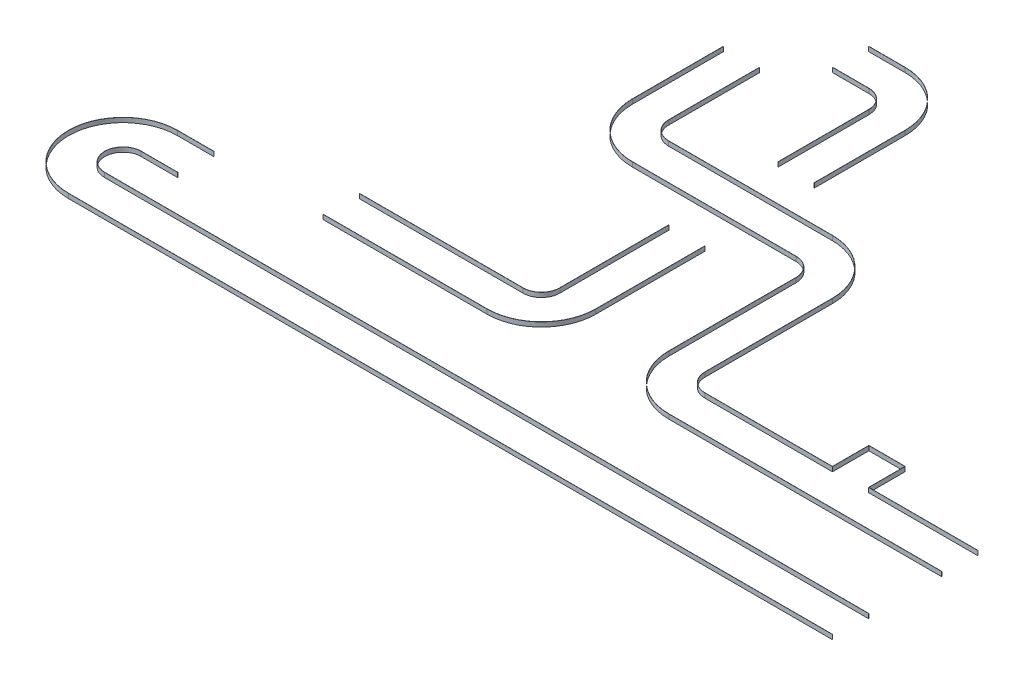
ISO-10303-21;
HEADER;
FILE_DESCRIPTION(('STEP AP214'),'2;1');
FILE_NAME('part.step','',(''),(''),'','','');
FILE_SCHEMA(('AUTOMOTIVE_DESIGN { 1 0 10303 214 1 1 1 1 }'));
ENDSEC;
DATA;
#1=APPLICATION_CONTEXT('core data for automotive mechanical design processes');
#2=APPLICATION_PROTOCOL_DEFINITION('international standard','automotive_design',2000,#1);
#3=PRODUCT_CONTEXT('',#1,'mechanical');
#4=PRODUCT('Part','Part','',(#3));
#5=PRODUCT_RELATED_PRODUCT_CATEGORY('part','',(#4));
#6=PRODUCT_DEFINITION_FORMATION('','',#4);
#7=PRODUCT_DEFINITION_CONTEXT('part definition',#1,'design');
#8=PRODUCT_DEFINITION('design','',#6,#7);
#9=PRODUCT_DEFINITION_SHAPE('','',#8);
#10=(LENGTH_UNIT() NAMED_UNIT(*) SI_UNIT(.MILLI.,.METRE.));
#11=(NAMED_UNIT(*) PLANE_ANGLE_UNIT() SI_UNIT($,.RADIAN.));
#12=(NAMED_UNIT(*) SI_UNIT($,.STERADIAN.) SOLID_ANGLE_UNIT());
#13=UNCERTAINTY_MEASURE_WITH_UNIT(LENGTH_MEASURE(1.E-05),#10,'distance_accuracy_value','');
#14=(GEOMETRIC_REPRESENTATION_CONTEXT(3) GLOBAL_UNCERTAINTY_ASSIGNED_CONTEXT((#13)) GLOBAL_UNIT_ASSIGNED_CONTEXT((#10,
#11,#12)) REPRESENTATION_CONTEXT('',''));
#15=CARTESIAN_POINT('',(0.,0.,0.));
#16=DIRECTION('',(0.,0.,1.));
#17=DIRECTION('',(1.,0.,0.));
#18=AXIS2_PLACEMENT_3D('',#15,#16,#17);
#19=CARTESIAN_POINT('',(-4572.,0.,-2743.2));
#20=DIRECTION('',(0.,-1.,0.));
#21=DIRECTION('',(0.,0.,-1.));
#22=AXIS2_PLACEMENT_3D('',#19,#20,#21);
#23=PLANE('',#22);
#24=DIRECTION('',(0.,0.,1.));
#25=VECTOR('',#24,1.);
#26=CARTESIAN_POINT('',(-7312.66,0.,-6403.34));
#27=LINE('',#26,#25);
#28=CARTESIAN_POINT('',(-7312.66,0.,-7924.8));
#29=VERTEX_POINT('',#28);
#30=CARTESIAN_POINT('',(-7312.66,0.,-6400.8));
#31=VERTEX_POINT('',#30);
#32=EDGE_CURVE('E115',#29,#31,#27,.T.);
#33=ORIENTED_EDGE('',*,*,#32,.T.);
#34=DIRECTION('',(1.,0.,0.));
#35=VECTOR('',#34,1.);
#36=CARTESIAN_POINT('',(-7315.2,0.,-6400.8));
#37=LINE('',#36,#35);
#38=CARTESIAN_POINT('',(-7315.2,0.,-6400.8));
#39=VERTEX_POINT('',#38);
#40=EDGE_CURVE('E136',#39,#31,#37,.T.);
#41=ORIENTED_EDGE('',*,*,#40,.F.);
#42=DIRECTION('',(0.,0.,1.));
#43=VECTOR('',#42,1.);
#44=CARTESIAN_POINT('',(-7315.2,0.,-7924.8));
#45=LINE('',#44,#43);
#46=CARTESIAN_POINT('',(-7315.2,0.,-7924.8));
#47=VERTEX_POINT('',#46);
#48=EDGE_CURVE('E162',#47,#39,#45,.T.);
#49=ORIENTED_EDGE('',*,*,#48,.F.);
#50=CARTESIAN_POINT('',(-7620.,0.,-7924.8));
#51=DIRECTION('',(0.,-1.,0.));
#52=DIRECTION('',(0.,0.,-1.));
#53=AXIS2_PLACEMENT_3D('',#50,#51,#52);
#54=CIRCLE('',#53,304.799999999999);
#55=CARTESIAN_POINT('',(-7620.,0.,-8229.6));
#56=VERTEX_POINT('',#55);
#57=EDGE_CURVE('E159',#56,#47,#54,.T.);
#58=ORIENTED_EDGE('',*,*,#57,.F.);
#59=DIRECTION('',(1.,0.,0.));
#60=VECTOR('',#59,1.);
#61=CARTESIAN_POINT('',(-8229.6,0.,-8229.6));
#62=LINE('',#61,#60);
#63=CARTESIAN_POINT('',(-8229.6,0.,-8229.6));
#64=VERTEX_POINT('',#63);
#65=EDGE_CURVE('E139',#64,#56,#62,.T.);
#66=ORIENTED_EDGE('',*,*,#65,.F.);
#67=DIRECTION('',(0.,0.,1.));
#68=VECTOR('',#67,1.);
#69=CARTESIAN_POINT('',(-8229.6,0.,-2743.2));
#70=LINE('',#69,#68);
#71=CARTESIAN_POINT('',(-8229.6,0.,-8232.14));
#72=VERTEX_POINT('',#71);
#73=EDGE_CURVE('E111',#72,#64,#70,.T.);
#74=ORIENTED_EDGE('',*,*,#73,.F.);
#75=DIRECTION('',(1.,0.,0.));
#76=VECTOR('',#75,1.);
#77=CARTESIAN_POINT('',(-8227.06,0.,-8232.14));
#78=LINE('',#77,#76);
#79=CARTESIAN_POINT('',(-7620.,0.,-8232.14));
#80=VERTEX_POINT('',#79);
#81=EDGE_CURVE('E107',#72,#80,#78,.T.);
#82=ORIENTED_EDGE('',*,*,#81,.T.);
#83=CARTESIAN_POINT('',(-7620.,0.,-7924.8));
#84=DIRECTION('',(0.,-1.,0.));
#85=DIRECTION('',(0.,0.,-1.));
#86=AXIS2_PLACEMENT_3D('',#83,#84,#85);
#87=CIRCLE('',#86,307.339999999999);
#88=EDGE_CURVE('E109',#80,#29,#87,.T.);
#89=ORIENTED_EDGE('',*,*,#88,.T.);
#90=EDGE_LOOP('',(#33,#41,#49,#58,#66,#74,#82,#89));
#91=FACE_BOUND('',#90,.T.);
#92=ADVANCED_FACE('F43',(#91),#23,.T.);
#93=CARTESIAN_POINT('',(-4572.,76.2,-2743.2));
#94=DIRECTION('',(0.,-1.,0.));
#95=DIRECTION('',(0.,0.,-1.));
#96=AXIS2_PLACEMENT_3D('',#93,#94,#95);
#97=PLANE('',#96);
#98=DIRECTION('',(1.,0.,0.));
#99=VECTOR('',#98,1.);
#100=CARTESIAN_POINT('',(-7315.2,76.2,-6400.8));
#101=LINE('',#100,#99);
#102=CARTESIAN_POINT('',(-7315.2,76.2,-6400.8));
#103=VERTEX_POINT('',#102);
#104=CARTESIAN_POINT('',(-7312.66,76.2,-6400.8));
#105=VERTEX_POINT('',#104);
#106=EDGE_CURVE('E46',#103,#105,#101,.T.);
#107=ORIENTED_EDGE('',*,*,#106,.T.);
#108=DIRECTION('',(0.,0.,1.));
#109=VECTOR('',#108,1.);
#110=CARTESIAN_POINT('',(-7312.66,76.2,-2743.2));
#111=LINE('',#110,#109);
#112=CARTESIAN_POINT('',(-7312.66,76.2,-7924.8));
#113=VERTEX_POINT('',#112);
#114=EDGE_CURVE('E51',#113,#105,#111,.T.);
#115=ORIENTED_EDGE('',*,*,#114,.F.);
#116=CARTESIAN_POINT('',(-7620.,76.2,-7924.8));
#117=DIRECTION('',(0.,-1.,0.));
#118=DIRECTION('',(0.,0.,-1.));
#119=AXIS2_PLACEMENT_3D('',#116,#117,#118);
#120=CIRCLE('',#119,307.339999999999);
#121=CARTESIAN_POINT('',(-7620.,76.2,-8232.14));
#122=VERTEX_POINT('',#121);
#123=EDGE_CURVE('E127',#122,#113,#120,.T.);
#124=ORIENTED_EDGE('',*,*,#123,.F.);
#125=DIRECTION('',(1.,0.,0.));
#126=VECTOR('',#125,1.);
#127=CARTESIAN_POINT('',(-4572.,76.2,-8232.14));
#128=LINE('',#127,#126);
#129=CARTESIAN_POINT('',(-8229.6,76.2,-8232.14));
#130=VERTEX_POINT('',#129);
#131=EDGE_CURVE('E126',#130,#122,#128,.T.);
#132=ORIENTED_EDGE('',*,*,#131,.F.);
#133=DIRECTION('',(0.,0.,-1.));
#134=VECTOR('',#133,1.);
#135=CARTESIAN_POINT('',(-8229.6,76.2,-8839.2));
#136=LINE('',#135,#134);
#137=CARTESIAN_POINT('',(-8229.6,76.2,-8229.6));
#138=VERTEX_POINT('',#137);
#139=EDGE_CURVE('E140',#138,#130,#136,.T.);
#140=ORIENTED_EDGE('',*,*,#139,.F.);
#141=DIRECTION('',(1.,0.,0.));
#142=VECTOR('',#141,1.);
#143=CARTESIAN_POINT('',(-8229.6,76.2,-8229.6));
#144=LINE('',#143,#142);
#145=CARTESIAN_POINT('',(-7620.,76.2,-8229.6));
#146=VERTEX_POINT('',#145);
#147=EDGE_CURVE('E153',#138,#146,#144,.T.);
#148=ORIENTED_EDGE('',*,*,#147,.T.);
#149=CARTESIAN_POINT('',(-7620.,76.2,-7924.8));
#150=DIRECTION('',(0.,-1.,0.));
#151=DIRECTION('',(0.,0.,-1.));
#152=AXIS2_PLACEMENT_3D('',#149,#150,#151);
#153=CIRCLE('',#152,304.799999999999);
#154=CARTESIAN_POINT('',(-7315.2,76.2,-7924.8));
#155=VERTEX_POINT('',#154);
#156=EDGE_CURVE('E147',#146,#155,#153,.T.);
#157=ORIENTED_EDGE('',*,*,#156,.T.);
#158=DIRECTION('',(0.,0.,1.));
#159=VECTOR('',#158,1.);
#160=CARTESIAN_POINT('',(-7315.2,76.2,-7924.8));
#161=LINE('',#160,#159);
#162=EDGE_CURVE('E143',#155,#103,#161,.T.);
#163=ORIENTED_EDGE('',*,*,#162,.T.);
#164=EDGE_LOOP('',(#107,#115,#124,#132,#140,#148,#157,#163));
#165=FACE_BOUND('',#164,.T.);
#166=ADVANCED_FACE('F187',(#165),#97,.F.);
#167=CARTESIAN_POINT('',(-7315.2,76.2,-6400.8));
#168=DIRECTION('',(0.,0.,-1.));
#169=DIRECTION('',(-1.,0.,0.));
#170=AXIS2_PLACEMENT_3D('',#167,#168,#169);
#171=PLANE('',#170);
#172=ORIENTED_EDGE('',*,*,#40,.T.);
#173=DIRECTION('',(0.,1.,0.));
#174=VECTOR('',#173,1.);
#175=CARTESIAN_POINT('',(-7312.66,0.,-6400.8));
#176=LINE('',#175,#174);
#177=EDGE_CURVE('E59',#31,#105,#176,.T.);
#178=ORIENTED_EDGE('',*,*,#177,.T.);
#179=ORIENTED_EDGE('',*,*,#106,.F.);
#180=DIRECTION('',(0.,-1.,0.));
#181=VECTOR('',#180,1.);
#182=CARTESIAN_POINT('',(-7315.2,76.2,-6400.8));
#183=LINE('',#182,#181);
#184=EDGE_CURVE('E135',#103,#39,#183,.T.);
#185=ORIENTED_EDGE('',*,*,#184,.T.);
#186=EDGE_LOOP('',(#172,#178,#179,#185));
#187=FACE_BOUND('',#186,.T.);
#188=ADVANCED_FACE('F186',(#187),#171,.F.);
#189=CARTESIAN_POINT('',(-8229.6,0.,-8839.2));
#190=DIRECTION('',(1.,0.,0.));
#191=DIRECTION('',(0.,0.,-1.));
#192=AXIS2_PLACEMENT_3D('',#189,#190,#191);
#193=PLANE('',#192);
#194=ORIENTED_EDGE('',*,*,#139,.T.);
#195=DIRECTION('',(0.,1.,0.));
#196=VECTOR('',#195,1.);
#197=CARTESIAN_POINT('',(-8229.6,0.,-8232.14));
#198=LINE('',#197,#196);
#199=EDGE_CURVE('E12',#72,#130,#198,.T.);
#200=ORIENTED_EDGE('',*,*,#199,.F.);
#201=ORIENTED_EDGE('',*,*,#73,.T.);
#202=DIRECTION('',(0.,-1.,0.));
#203=VECTOR('',#202,1.);
#204=CARTESIAN_POINT('',(-8229.6,76.2,-8229.6));
#205=LINE('',#204,#203);
#206=EDGE_CURVE('E158',#138,#64,#205,.T.);
#207=ORIENTED_EDGE('',*,*,#206,.F.);
#208=EDGE_LOOP('',(#194,#200,#201,#207));
#209=FACE_BOUND('',#208,.T.);
#210=ADVANCED_FACE('F188',(#209),#193,.F.);
#211=CARTESIAN_POINT('',(-8229.6,76.2,-8229.6));
#212=DIRECTION('',(0.,0.,-1.));
#213=DIRECTION('',(-1.,0.,0.));
#214=AXIS2_PLACEMENT_3D('',#211,#212,#213);
#215=PLANE('',#214);
#216=ORIENTED_EDGE('',*,*,#65,.T.);
#217=DIRECTION('',(0.,-1.,0.));
#218=VECTOR('',#217,1.);
#219=CARTESIAN_POINT('',(-7620.,76.2,-8229.6));
#220=LINE('',#219,#218);
#221=EDGE_CURVE('E161',#146,#56,#220,.T.);
#222=ORIENTED_EDGE('',*,*,#221,.F.);
#223=ORIENTED_EDGE('',*,*,#147,.F.);
#224=ORIENTED_EDGE('',*,*,#206,.T.);
#225=EDGE_LOOP('',(#216,#222,#223,#224));
#226=FACE_BOUND('',#225,.T.);
#227=ADVANCED_FACE('F173',(#226),#215,.F.);
#228=CARTESIAN_POINT('',(-7620.,76.2,-7924.8));
#229=DIRECTION('',(0.,-1.,0.));
#230=DIRECTION('',(0.,0.,-1.));
#231=AXIS2_PLACEMENT_3D('',#228,#229,#230);
#232=CYLINDRICAL_SURFACE('',#231,304.799999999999);
#233=ORIENTED_EDGE('',*,*,#57,.T.);
#234=DIRECTION('',(0.,-1.,0.));
#235=VECTOR('',#234,1.);
#236=CARTESIAN_POINT('',(-7315.2,76.2,-7924.8));
#237=LINE('',#236,#235);
#238=EDGE_CURVE('E130',#155,#47,#237,.T.);
#239=ORIENTED_EDGE('',*,*,#238,.F.);
#240=ORIENTED_EDGE('',*,*,#156,.F.);
#241=ORIENTED_EDGE('',*,*,#221,.T.);
#242=EDGE_LOOP('',(#233,#239,#240,#241));
#243=FACE_BOUND('',#242,.T.);
#244=ADVANCED_FACE('F181',(#243),#232,.F.);
#245=CARTESIAN_POINT('',(-7315.2,76.2,-7924.8));
#246=DIRECTION('',(1.,0.,0.));
#247=DIRECTION('',(0.,0.,-1.));
#248=AXIS2_PLACEMENT_3D('',#245,#246,#247);
#249=PLANE('',#248);
#250=ORIENTED_EDGE('',*,*,#48,.T.);
#251=ORIENTED_EDGE('',*,*,#184,.F.);
#252=ORIENTED_EDGE('',*,*,#162,.F.);
#253=ORIENTED_EDGE('',*,*,#238,.T.);
#254=EDGE_LOOP('',(#250,#251,#252,#253));
#255=FACE_BOUND('',#254,.T.);
#256=ADVANCED_FACE('F184',(#255),#249,.F.);
#257=CARTESIAN_POINT('',(-8229.6,76.2,-8232.14));
#258=DIRECTION('',(0.,0.,-1.));
#259=DIRECTION('',(-1.,0.,0.));
#260=AXIS2_PLACEMENT_3D('',#257,#258,#259);
#261=PLANE('',#260);
#262=DIRECTION('',(0.,-1.,0.));
#263=VECTOR('',#262,1.);
#264=CARTESIAN_POINT('',(-7620.,76.2,-8232.14));
#265=LINE('',#264,#263);
#266=EDGE_CURVE('E121',#122,#80,#265,.T.);
#267=ORIENTED_EDGE('',*,*,#266,.T.);
#268=ORIENTED_EDGE('',*,*,#81,.F.);
#269=ORIENTED_EDGE('',*,*,#199,.T.);
#270=ORIENTED_EDGE('',*,*,#131,.T.);
#271=EDGE_LOOP('',(#267,#268,#269,#270));
#272=FACE_BOUND('',#271,.T.);
#273=ADVANCED_FACE('F125',(#272),#261,.T.);
#274=CARTESIAN_POINT('',(-7620.,76.2,-7924.8));
#275=DIRECTION('',(0.,-1.,0.));
#276=DIRECTION('',(0.,0.,-1.));
#277=AXIS2_PLACEMENT_3D('',#274,#275,#276);
#278=CYLINDRICAL_SURFACE('',#277,307.339999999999);
#279=ORIENTED_EDGE('',*,*,#88,.F.);
#280=ORIENTED_EDGE('',*,*,#266,.F.);
#281=ORIENTED_EDGE('',*,*,#123,.T.);
#282=DIRECTION('',(0.,1.,0.));
#283=VECTOR('',#282,1.);
#284=CARTESIAN_POINT('',(-7312.66,76.2,-7924.8));
#285=LINE('',#284,#283);
#286=EDGE_CURVE('E123',#113,#29,#285,.F.);
#287=ORIENTED_EDGE('',*,*,#286,.T.);
#288=EDGE_LOOP('',(#279,#280,#281,#287));
#289=FACE_BOUND('',#288,.T.);
#290=ADVANCED_FACE('F120',(#289),#278,.T.);
#291=CARTESIAN_POINT('',(-7312.66,76.2,-7924.8));
#292=DIRECTION('',(1.,0.,0.));
#293=DIRECTION('',(0.,0.,-1.));
#294=AXIS2_PLACEMENT_3D('',#291,#292,#293);
#295=PLANE('',#294);
#296=ORIENTED_EDGE('',*,*,#32,.F.);
#297=ORIENTED_EDGE('',*,*,#286,.F.);
#298=ORIENTED_EDGE('',*,*,#114,.T.);
#299=ORIENTED_EDGE('',*,*,#177,.F.);
#300=EDGE_LOOP('',(#296,#297,#298,#299));
#301=FACE_BOUND('',#300,.T.);
#302=ADVANCED_FACE('F253',(#301),#295,.T.);
#303=CLOSED_SHELL('',(#92,#166,#188,#210,#227,#244,#256,#273,#290,#302));
#304=MANIFOLD_SOLID_BREP('B2',#303);
#305=CARTESIAN_POINT('',(-7315.2,76.2,-4572.));
#306=DIRECTION('',(0.,0.,1.));
#307=DIRECTION('',(1.,0.,0.));
#308=AXIS2_PLACEMENT_3D('',#305,#306,#307);
#309=PLANE('',#308);
#310=DIRECTION('',(-1.,0.,0.));
#311=VECTOR('',#310,1.);
#312=CARTESIAN_POINT('',(-7315.2,76.2,-4572.));
#313=LINE('',#312,#311);
#314=CARTESIAN_POINT('',(-7312.66,76.2,-4572.));
#315=VERTEX_POINT('',#314);
#316=CARTESIAN_POINT('',(-7315.2,76.2,-4572.));
#317=VERTEX_POINT('',#316);
#318=EDGE_CURVE('E366',#315,#317,#313,.T.);
#319=ORIENTED_EDGE('',*,*,#318,.F.);
#320=DIRECTION('',(0.,1.,0.));
#321=VECTOR('',#320,1.);
#322=CARTESIAN_POINT('',(-7312.66,0.,-4572.));
#323=LINE('',#322,#321);
#324=CARTESIAN_POINT('',(-7312.66,0.,-4572.));
#325=VERTEX_POINT('',#324);
#326=EDGE_CURVE('E41',#325,#315,#323,.T.);
#327=ORIENTED_EDGE('',*,*,#326,.F.);
#328=DIRECTION('',(-1.,0.,0.));
#329=VECTOR('',#328,1.);
#330=CARTESIAN_POINT('',(-7315.2,0.,-4572.));
#331=LINE('',#330,#329);
#332=CARTESIAN_POINT('',(-7315.2,0.,-4572.));
#333=VERTEX_POINT('',#332);
#334=EDGE_CURVE('E374',#325,#333,#331,.T.);
#335=ORIENTED_EDGE('',*,*,#334,.T.);
#336=DIRECTION('',(0.,-1.,0.));
#337=VECTOR('',#336,1.);
#338=CARTESIAN_POINT('',(-7315.2,76.2,-4572.));
#339=LINE('',#338,#337);
#340=EDGE_CURVE('E377',#317,#333,#339,.T.);
#341=ORIENTED_EDGE('',*,*,#340,.F.);
#342=EDGE_LOOP('',(#319,#327,#335,#341));
#343=FACE_BOUND('',#342,.T.);
#344=ADVANCED_FACE('F286',(#343),#309,.F.);
#345=CARTESIAN_POINT('',(-12801.6,76.2,-914.399999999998));
#346=DIRECTION('',(0.,-1.,0.));
#347=DIRECTION('',(0.,0.,-1.));
#348=AXIS2_PLACEMENT_3D('',#345,#346,#347);
#349=PLANE('',#348);
#350=DIRECTION('',(0.,0.,-1.));
#351=VECTOR('',#350,1.);
#352=CARTESIAN_POINT('',(-10363.2,76.2,-2438.4));
#353=LINE('',#352,#351);
#354=CARTESIAN_POINT('',(-10363.2,76.2,-2435.86));
#355=VERTEX_POINT('',#354);
#356=CARTESIAN_POINT('',(-10363.2,76.2,-2438.4));
#357=VERTEX_POINT('',#356);
#358=EDGE_CURVE('E290',#355,#357,#353,.T.);
#359=ORIENTED_EDGE('',*,*,#358,.F.);
#360=DIRECTION('',(-1.,0.,0.));
#361=VECTOR('',#360,1.);
#362=CARTESIAN_POINT('',(-12801.6,76.2,-2435.86));
#363=LINE('',#362,#361);
#364=CARTESIAN_POINT('',(-7620.,76.2,-2435.86));
#365=VERTEX_POINT('',#364);
#366=EDGE_CURVE('E296',#365,#355,#363,.T.);
#367=ORIENTED_EDGE('',*,*,#366,.F.);
#368=CARTESIAN_POINT('',(-7620.,76.2,-2743.2));
#369=DIRECTION('',(0.,-1.,0.));
#370=DIRECTION('',(0.,0.,-1.));
#371=AXIS2_PLACEMENT_3D('',#368,#369,#370);
#372=CIRCLE('',#371,307.339999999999);
#373=CARTESIAN_POINT('',(-7312.66,76.2,-2743.2));
#374=VERTEX_POINT('',#373);
#375=EDGE_CURVE('E328',#374,#365,#372,.T.);
#376=ORIENTED_EDGE('',*,*,#375,.F.);
#377=DIRECTION('',(0.,0.,1.));
#378=VECTOR('',#377,1.);
#379=CARTESIAN_POINT('',(-7312.66,76.2,-914.399999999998));
#380=LINE('',#379,#378);
#381=EDGE_CURVE('E305',#315,#374,#380,.T.);
#382=ORIENTED_EDGE('',*,*,#381,.F.);
#383=ORIENTED_EDGE('',*,*,#318,.T.);
#384=DIRECTION('',(0.,0.,1.));
#385=VECTOR('',#384,1.);
#386=CARTESIAN_POINT('',(-7315.2,76.2,-4572.));
#387=LINE('',#386,#385);
#388=CARTESIAN_POINT('',(-7315.2,76.2,-2743.2));
#389=VERTEX_POINT('',#388);
#390=EDGE_CURVE('E370',#317,#389,#387,.T.);
#391=ORIENTED_EDGE('',*,*,#390,.T.);
#392=CARTESIAN_POINT('',(-7620.,76.2,-2743.2));
#393=DIRECTION('',(0.,-1.,0.));
#394=DIRECTION('',(0.,0.,1.));
#395=AXIS2_PLACEMENT_3D('',#392,#393,#394);
#396=CIRCLE('',#395,304.799999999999);
#397=CARTESIAN_POINT('',(-7620.,76.2,-2438.4));
#398=VERTEX_POINT('',#397);
#399=EDGE_CURVE('E387',#389,#398,#396,.T.);
#400=ORIENTED_EDGE('',*,*,#399,.T.);
#401=DIRECTION('',(-1.,0.,0.));
#402=VECTOR('',#401,1.);
#403=CARTESIAN_POINT('',(-12192.,76.2,-2438.4));
#404=LINE('',#403,#402);
#405=EDGE_CURVE('E389',#398,#357,#404,.T.);
#406=ORIENTED_EDGE('',*,*,#405,.T.);
#407=EDGE_LOOP('',(#359,#367,#376,#382,#383,#391,#400,#406));
#408=FACE_BOUND('',#407,.T.);
#409=ADVANCED_FACE('F288',(#408),#349,.F.);
#410=CARTESIAN_POINT('',(-12801.6,0.,-914.399999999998));
#411=DIRECTION('',(0.,-1.,0.));
#412=DIRECTION('',(0.,0.,-1.));
#413=AXIS2_PLACEMENT_3D('',#410,#411,#412);
#414=PLANE('',#413);
#415=DIRECTION('',(-1.,0.,0.));
#416=VECTOR('',#415,1.);
#417=CARTESIAN_POINT('',(-10360.66,0.,-2435.86));
#418=LINE('',#417,#416);
#419=CARTESIAN_POINT('',(-7620.,0.,-2435.86));
#420=VERTEX_POINT('',#419);
#421=CARTESIAN_POINT('',(-10363.2,0.,-2435.86));
#422=VERTEX_POINT('',#421);
#423=EDGE_CURVE('E321',#420,#422,#418,.T.);
#424=ORIENTED_EDGE('',*,*,#423,.T.);
#425=DIRECTION('',(0.,0.,1.));
#426=VECTOR('',#425,1.);
#427=CARTESIAN_POINT('',(-10363.2,0.,-914.399999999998));
#428=LINE('',#427,#426);
#429=CARTESIAN_POINT('',(-10363.2,0.,-2438.4));
#430=VERTEX_POINT('',#429);
#431=EDGE_CURVE('E408',#430,#422,#428,.T.);
#432=ORIENTED_EDGE('',*,*,#431,.F.);
#433=DIRECTION('',(-1.,0.,0.));
#434=VECTOR('',#433,1.);
#435=CARTESIAN_POINT('',(-12192.,0.,-2438.4));
#436=LINE('',#435,#434);
#437=CARTESIAN_POINT('',(-7620.,0.,-2438.4));
#438=VERTEX_POINT('',#437);
#439=EDGE_CURVE('E395',#438,#430,#436,.T.);
#440=ORIENTED_EDGE('',*,*,#439,.F.);
#441=CARTESIAN_POINT('',(-7620.,0.,-2743.2));
#442=DIRECTION('',(0.,-1.,0.));
#443=DIRECTION('',(0.,0.,1.));
#444=AXIS2_PLACEMENT_3D('',#441,#442,#443);
#445=CIRCLE('',#444,304.799999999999);
#446=CARTESIAN_POINT('',(-7315.2,0.,-2743.2));
#447=VERTEX_POINT('',#446);
#448=EDGE_CURVE('E380',#447,#438,#445,.T.);
#449=ORIENTED_EDGE('',*,*,#448,.F.);
#450=DIRECTION('',(0.,0.,1.));
#451=VECTOR('',#450,1.);
#452=CARTESIAN_POINT('',(-7315.2,0.,-4572.));
#453=LINE('',#452,#451);
#454=EDGE_CURVE('E381',#333,#447,#453,.T.);
#455=ORIENTED_EDGE('',*,*,#454,.F.);
#456=ORIENTED_EDGE('',*,*,#334,.F.);
#457=DIRECTION('',(0.,0.,1.));
#458=VECTOR('',#457,1.);
#459=CARTESIAN_POINT('',(-7312.66,0.,-4569.46));
#460=LINE('',#459,#458);
#461=CARTESIAN_POINT('',(-7312.66,0.,-2743.2));
#462=VERTEX_POINT('',#461);
#463=EDGE_CURVE('E339',#325,#462,#460,.T.);
#464=ORIENTED_EDGE('',*,*,#463,.T.);
#465=CARTESIAN_POINT('',(-7620.,0.,-2743.2));
#466=DIRECTION('',(0.,-1.,0.));
#467=DIRECTION('',(0.,0.,-1.));
#468=AXIS2_PLACEMENT_3D('',#465,#466,#467);
#469=CIRCLE('',#468,307.339999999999);
#470=EDGE_CURVE('E401',#462,#420,#469,.T.);
#471=ORIENTED_EDGE('',*,*,#470,.T.);
#472=EDGE_LOOP('',(#424,#432,#440,#449,#455,#456,#464,#471));
#473=FACE_BOUND('',#472,.T.);
#474=ADVANCED_FACE('F424',(#473),#414,.T.);
#475=CARTESIAN_POINT('',(-7315.2,76.2,-4572.));
#476=DIRECTION('',(1.,0.,0.));
#477=DIRECTION('',(0.,0.,-1.));
#478=AXIS2_PLACEMENT_3D('',#475,#476,#477);
#479=PLANE('',#478);
#480=ORIENTED_EDGE('',*,*,#454,.T.);
#481=DIRECTION('',(0.,-1.,0.));
#482=VECTOR('',#481,1.);
#483=CARTESIAN_POINT('',(-7315.2,76.2,-2743.2));
#484=LINE('',#483,#482);
#485=EDGE_CURVE('E385',#389,#447,#484,.T.);
#486=ORIENTED_EDGE('',*,*,#485,.F.);
#487=ORIENTED_EDGE('',*,*,#390,.F.);
#488=ORIENTED_EDGE('',*,*,#340,.T.);
#489=EDGE_LOOP('',(#480,#486,#487,#488));
#490=FACE_BOUND('',#489,.T.);
#491=ADVANCED_FACE('F383',(#490),#479,.F.);
#492=CARTESIAN_POINT('',(-7620.,76.2,-2743.2));
#493=DIRECTION('',(0.,-1.,0.));
#494=DIRECTION('',(0.,0.,-1.));
#495=AXIS2_PLACEMENT_3D('',#492,#493,#494);
#496=CYLINDRICAL_SURFACE('',#495,304.799999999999);
#497=ORIENTED_EDGE('',*,*,#448,.T.);
#498=DIRECTION('',(0.,-1.,0.));
#499=VECTOR('',#498,1.);
#500=CARTESIAN_POINT('',(-7620.,76.2,-2438.4));
#501=LINE('',#500,#499);
#502=EDGE_CURVE('E394',#398,#438,#501,.T.);
#503=ORIENTED_EDGE('',*,*,#502,.F.);
#504=ORIENTED_EDGE('',*,*,#399,.F.);
#505=ORIENTED_EDGE('',*,*,#485,.T.);
#506=EDGE_LOOP('',(#497,#503,#504,#505));
#507=FACE_BOUND('',#506,.T.);
#508=ADVANCED_FACE('F448',(#507),#496,.F.);
#509=CARTESIAN_POINT('',(-12192.,76.2,-2438.4));
#510=DIRECTION('',(0.,0.,1.));
#511=DIRECTION('',(1.,0.,0.));
#512=AXIS2_PLACEMENT_3D('',#509,#510,#511);
#513=PLANE('',#512);
#514=ORIENTED_EDGE('',*,*,#439,.T.);
#515=DIRECTION('',(0.,1.,0.));
#516=VECTOR('',#515,1.);
#517=CARTESIAN_POINT('',(-10363.2,0.,-2438.4));
#518=LINE('',#517,#516);
#519=EDGE_CURVE('E347',#430,#357,#518,.T.);
#520=ORIENTED_EDGE('',*,*,#519,.T.);
#521=ORIENTED_EDGE('',*,*,#405,.F.);
#522=ORIENTED_EDGE('',*,*,#502,.T.);
#523=EDGE_LOOP('',(#514,#520,#521,#522));
#524=FACE_BOUND('',#523,.T.);
#525=ADVANCED_FACE('F422',(#524),#513,.F.);
#526=CARTESIAN_POINT('',(-10363.2,0.,-2438.4));
#527=DIRECTION('',(1.,0.,0.));
#528=DIRECTION('',(0.,0.,-1.));
#529=AXIS2_PLACEMENT_3D('',#526,#527,#528);
#530=PLANE('',#529);
#531=ORIENTED_EDGE('',*,*,#431,.T.);
#532=DIRECTION('',(0.,1.,0.));
#533=VECTOR('',#532,1.);
#534=CARTESIAN_POINT('',(-10363.2,0.,-2435.86));
#535=LINE('',#534,#533);
#536=EDGE_CURVE('E406',#422,#355,#535,.T.);
#537=ORIENTED_EDGE('',*,*,#536,.T.);
#538=ORIENTED_EDGE('',*,*,#358,.T.);
#539=ORIENTED_EDGE('',*,*,#519,.F.);
#540=EDGE_LOOP('',(#531,#537,#538,#539));
#541=FACE_BOUND('',#540,.T.);
#542=ADVANCED_FACE('F442',(#541),#530,.F.);
#543=CARTESIAN_POINT('',(-7312.66,76.2,-4572.));
#544=DIRECTION('',(1.,0.,0.));
#545=DIRECTION('',(0.,0.,-1.));
#546=AXIS2_PLACEMENT_3D('',#543,#544,#545);
#547=PLANE('',#546);
#548=DIRECTION('',(0.,-1.,0.));
#549=VECTOR('',#548,1.);
#550=CARTESIAN_POINT('',(-7312.66,76.2,-2743.2));
#551=LINE('',#550,#549);
#552=EDGE_CURVE('E399',#374,#462,#551,.T.);
#553=ORIENTED_EDGE('',*,*,#552,.T.);
#554=ORIENTED_EDGE('',*,*,#463,.F.);
#555=ORIENTED_EDGE('',*,*,#326,.T.);
#556=ORIENTED_EDGE('',*,*,#381,.T.);
#557=EDGE_LOOP('',(#553,#554,#555,#556));
#558=FACE_BOUND('',#557,.T.);
#559=ADVANCED_FACE('F433',(#558),#547,.T.);
#560=CARTESIAN_POINT('',(-7620.,76.2,-2743.2));
#561=DIRECTION('',(0.,-1.,0.));
#562=DIRECTION('',(0.,0.,-1.));
#563=AXIS2_PLACEMENT_3D('',#560,#561,#562);
#564=CYLINDRICAL_SURFACE('',#563,307.339999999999);
#565=ORIENTED_EDGE('',*,*,#470,.F.);
#566=ORIENTED_EDGE('',*,*,#552,.F.);
#567=ORIENTED_EDGE('',*,*,#375,.T.);
#568=DIRECTION('',(0.,1.,0.));
#569=VECTOR('',#568,1.);
#570=CARTESIAN_POINT('',(-7620.,76.2,-2435.86));
#571=LINE('',#570,#569);
#572=EDGE_CURVE('E397',#365,#420,#571,.F.);
#573=ORIENTED_EDGE('',*,*,#572,.T.);
#574=EDGE_LOOP('',(#565,#566,#567,#573));
#575=FACE_BOUND('',#574,.T.);
#576=ADVANCED_FACE('F426',(#575),#564,.T.);
#577=CARTESIAN_POINT('',(-12192.,76.2,-2435.86));
#578=DIRECTION('',(0.,0.,1.));
#579=DIRECTION('',(1.,0.,0.));
#580=AXIS2_PLACEMENT_3D('',#577,#578,#579);
#581=PLANE('',#580);
#582=ORIENTED_EDGE('',*,*,#423,.F.);
#583=ORIENTED_EDGE('',*,*,#572,.F.);
#584=ORIENTED_EDGE('',*,*,#366,.T.);
#585=ORIENTED_EDGE('',*,*,#536,.F.);
#586=EDGE_LOOP('',(#582,#583,#584,#585));
#587=FACE_BOUND('',#586,.T.);
#588=ADVANCED_FACE('F427',(#587),#581,.T.);
#589=CLOSED_SHELL('',(#344,#409,#474,#491,#508,#525,#542,#559,#576,#588));
#590=MANIFOLD_SOLID_BREP('B6',#589);
#591=CARTESIAN_POINT('',(-9448.8,0.,-7620.));
#592=DIRECTION('',(0.,0.,1.));
#593=DIRECTION('',(1.,0.,0.));
#594=AXIS2_PLACEMENT_3D('',#591,#592,#593);
#595=PLANE('',#594);
#596=DIRECTION('',(1.,0.,0.));
#597=VECTOR('',#596,1.);
#598=CARTESIAN_POINT('',(-9448.8,76.2,-7620.));
#599=LINE('',#598,#597);
#600=CARTESIAN_POINT('',(-9448.8,76.2,-7620.));
#601=VERTEX_POINT('',#600);
#602=CARTESIAN_POINT('',(-9446.26,76.2,-7620.));
#603=VERTEX_POINT('',#602);
#604=EDGE_CURVE('E533',#601,#603,#599,.T.);
#605=ORIENTED_EDGE('',*,*,#604,.T.);
#606=DIRECTION('',(0.,1.,0.));
#607=VECTOR('',#606,1.);
#608=CARTESIAN_POINT('',(-9446.26,0.,-7620.));
#609=LINE('',#608,#607);
#610=CARTESIAN_POINT('',(-9446.26,0.,-7620.));
#611=VERTEX_POINT('',#610);
#612=EDGE_CURVE('E284',#611,#603,#609,.T.);
#613=ORIENTED_EDGE('',*,*,#612,.F.);
#614=DIRECTION('',(1.,0.,0.));
#615=VECTOR('',#614,1.);
#616=CARTESIAN_POINT('',(-9448.8,0.,-7620.));
#617=LINE('',#616,#615);
#618=CARTESIAN_POINT('',(-9448.8,0.,-7620.));
#619=VERTEX_POINT('',#618);
#620=EDGE_CURVE('E649',#619,#611,#617,.T.);
#621=ORIENTED_EDGE('',*,*,#620,.F.);
#622=DIRECTION('',(0.,1.,0.));
#623=VECTOR('',#622,1.);
#624=CARTESIAN_POINT('',(-9448.8,0.,-7620.));
#625=LINE('',#624,#623);
#626=EDGE_CURVE('E683',#619,#601,#625,.T.);
#627=ORIENTED_EDGE('',*,*,#626,.T.);
#628=EDGE_LOOP('',(#605,#613,#621,#627));
#629=FACE_BOUND('',#628,.T.);
#630=ADVANCED_FACE('F529',(#629),#595,.F.);
#631=CARTESIAN_POINT('',(-4572.,76.2,-2743.2));
#632=DIRECTION('',(0.,-1.,0.));
#633=DIRECTION('',(0.,0.,-1.));
#634=AXIS2_PLACEMENT_3D('',#631,#632,#633);
#635=PLANE('',#634);
#636=DIRECTION('',(0.,0.,-1.));
#637=VECTOR('',#636,1.);
#638=CARTESIAN_POINT('',(0.,76.2,-1828.8));
#639=LINE('',#638,#637);
#640=CARTESIAN_POINT('',(0.,76.2,-1828.8));
#641=VERTEX_POINT('',#640);
#642=CARTESIAN_POINT('',(0.,76.2,-1831.34));
#643=VERTEX_POINT('',#642);
#644=EDGE_CURVE('E679',#641,#643,#639,.T.);
#645=ORIENTED_EDGE('',*,*,#644,.T.);
#646=DIRECTION('',(1.,0.,0.));
#647=VECTOR('',#646,1.);
#648=CARTESIAN_POINT('',(-4572.,76.2,-1831.34));
#649=LINE('',#648,#647);
#650=CARTESIAN_POINT('',(-4572.,76.2,-1831.34));
#651=VERTEX_POINT('',#650);
#652=EDGE_CURVE('E551',#651,#643,#649,.T.);
#653=ORIENTED_EDGE('',*,*,#652,.F.);
#654=CARTESIAN_POINT('',(-4572.,76.2,-2743.2));
#655=DIRECTION('',(0.,-1.,0.));
#656=DIRECTION('',(0.,0.,-1.));
#657=AXIS2_PLACEMENT_3D('',#654,#655,#656);
#658=CIRCLE('',#657,911.86);
#659=CARTESIAN_POINT('',(-5483.86,76.2,-2743.2));
#660=VERTEX_POINT('',#659);
#661=EDGE_CURVE('E735',#660,#651,#658,.F.);
#662=ORIENTED_EDGE('',*,*,#661,.F.);
#663=DIRECTION('',(0.,0.,1.));
#664=VECTOR('',#663,1.);
#665=CARTESIAN_POINT('',(-5483.86,76.2,-2743.2));
#666=LINE('',#665,#664);
#667=CARTESIAN_POINT('',(-5483.86,76.2,-4876.8));
#668=VERTEX_POINT('',#667);
#669=EDGE_CURVE('E738',#668,#660,#666,.T.);
#670=ORIENTED_EDGE('',*,*,#669,.F.);
#671=CARTESIAN_POINT('',(-5791.2,76.2,-4876.8));
#672=DIRECTION('',(0.,-1.,0.));
#673=DIRECTION('',(0.,0.,-1.));
#674=AXIS2_PLACEMENT_3D('',#671,#672,#673);
#675=CIRCLE('',#674,307.340000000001);
#676=CARTESIAN_POINT('',(-5791.2,76.2,-5184.14));
#677=VERTEX_POINT('',#676);
#678=EDGE_CURVE('E741',#677,#668,#675,.T.);
#679=ORIENTED_EDGE('',*,*,#678,.F.);
#680=DIRECTION('',(1.,0.,0.));
#681=VECTOR('',#680,1.);
#682=CARTESIAN_POINT('',(-4572.,76.2,-5184.14));
#683=LINE('',#682,#681);
#684=CARTESIAN_POINT('',(-8534.4,76.2,-5184.14));
#685=VERTEX_POINT('',#684);
#686=EDGE_CURVE('E671',#685,#677,#683,.T.);
#687=ORIENTED_EDGE('',*,*,#686,.F.);
#688=CARTESIAN_POINT('',(-8534.4,76.2,-6096.));
#689=DIRECTION('',(0.,-1.,0.));
#690=DIRECTION('',(0.,0.,-1.));
#691=AXIS2_PLACEMENT_3D('',#688,#689,#690);
#692=CIRCLE('',#691,911.86);
#693=CARTESIAN_POINT('',(-9446.26,76.2,-6096.));
#694=VERTEX_POINT('',#693);
#695=EDGE_CURVE('E672',#694,#685,#692,.F.);
#696=ORIENTED_EDGE('',*,*,#695,.F.);
#697=DIRECTION('',(0.,0.,1.));
#698=VECTOR('',#697,1.);
#699=CARTESIAN_POINT('',(-9446.26,76.2,-2743.2));
#700=LINE('',#699,#698);
#701=EDGE_CURVE('E664',#603,#694,#700,.T.);
#702=ORIENTED_EDGE('',*,*,#701,.F.);
#703=ORIENTED_EDGE('',*,*,#604,.F.);
#704=DIRECTION('',(0.,0.,1.));
#705=VECTOR('',#704,1.);
#706=CARTESIAN_POINT('',(-9448.8,76.2,-7620.));
#707=LINE('',#706,#705);
#708=CARTESIAN_POINT('',(-9448.8,76.2,-6096.));
#709=VERTEX_POINT('',#708);
#710=EDGE_CURVE('E682',#601,#709,#707,.T.);
#711=ORIENTED_EDGE('',*,*,#710,.T.);
#712=CARTESIAN_POINT('',(-8534.4,76.2,-6096.));
#713=DIRECTION('',(0.,1.,0.));
#714=DIRECTION('',(0.,0.,-1.));
#715=AXIS2_PLACEMENT_3D('',#712,#713,#714);
#716=CIRCLE('',#715,914.4);
#717=CARTESIAN_POINT('',(-8534.4,76.2,-5181.6));
#718=VERTEX_POINT('',#717);
#719=EDGE_CURVE('E727',#709,#718,#716,.T.);
#720=ORIENTED_EDGE('',*,*,#719,.T.);
#721=DIRECTION('',(1.,0.,0.));
#722=VECTOR('',#721,1.);
#723=CARTESIAN_POINT('',(-5791.2,76.2,-5181.6));
#724=LINE('',#723,#722);
#725=CARTESIAN_POINT('',(-5791.2,76.2,-5181.6));
#726=VERTEX_POINT('',#725);
#727=EDGE_CURVE('E725',#718,#726,#724,.T.);
#728=ORIENTED_EDGE('',*,*,#727,.T.);
#729=CARTESIAN_POINT('',(-5791.2,76.2,-4876.8));
#730=DIRECTION('',(0.,-1.,0.));
#731=DIRECTION('',(0.,0.,1.));
#732=AXIS2_PLACEMENT_3D('',#729,#730,#731);
#733=CIRCLE('',#732,304.800000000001);
#734=CARTESIAN_POINT('',(-5486.4,76.2,-4876.8));
#735=VERTEX_POINT('',#734);
#736=EDGE_CURVE('E723',#726,#735,#733,.T.);
#737=ORIENTED_EDGE('',*,*,#736,.T.);
#738=DIRECTION('',(0.,0.,1.));
#739=VECTOR('',#738,1.);
#740=CARTESIAN_POINT('',(-5486.4,76.2,-2743.2));
#741=LINE('',#740,#739);
#742=CARTESIAN_POINT('',(-5486.4,76.2,-2743.2));
#743=VERTEX_POINT('',#742);
#744=EDGE_CURVE('E721',#735,#743,#741,.T.);
#745=ORIENTED_EDGE('',*,*,#744,.T.);
#746=CARTESIAN_POINT('',(-4572.,76.2,-2743.2));
#747=DIRECTION('',(0.,1.,0.));
#748=DIRECTION('',(0.,0.,-1.));
#749=AXIS2_PLACEMENT_3D('',#746,#747,#748);
#750=CIRCLE('',#749,914.4);
#751=CARTESIAN_POINT('',(-4572.,76.2,-1828.8));
#752=VERTEX_POINT('',#751);
#753=EDGE_CURVE('E719',#743,#752,#750,.T.);
#754=ORIENTED_EDGE('',*,*,#753,.T.);
#755=DIRECTION('',(1.,0.,0.));
#756=VECTOR('',#755,1.);
#757=CARTESIAN_POINT('',(0.,76.2,-1828.8));
#758=LINE('',#757,#756);
#759=EDGE_CURVE('E715',#752,#641,#758,.T.);
#760=ORIENTED_EDGE('',*,*,#759,.T.);
#761=EDGE_LOOP('',(#645,#653,#662,#670,#679,#687,#696,#702,#703,#711,#720,#728,#737,#745,#754,#760));
#762=FACE_BOUND('',#761,.T.);
#763=ADVANCED_FACE('F531',(#762),#635,.F.);
#764=CARTESIAN_POINT('',(-8534.4,76.2,-6096.));
#765=DIRECTION('',(0.,-1.,0.));
#766=DIRECTION('',(0.,0.,-1.));
#767=AXIS2_PLACEMENT_3D('',#764,#765,#766);
#768=CYLINDRICAL_SURFACE('',#767,914.4);
#769=CARTESIAN_POINT('',(-8534.4,0.,-6096.));
#770=DIRECTION('',(0.,1.,0.));
#771=DIRECTION('',(0.,0.,-1.));
#772=AXIS2_PLACEMENT_3D('',#769,#770,#771);
#773=CIRCLE('',#772,914.4);
#774=CARTESIAN_POINT('',(-9448.8,0.,-6096.));
#775=VERTEX_POINT('',#774);
#776=CARTESIAN_POINT('',(-8534.4,0.,-5181.6));
#777=VERTEX_POINT('',#776);
#778=EDGE_CURVE('E713',#775,#777,#773,.T.);
#779=ORIENTED_EDGE('',*,*,#778,.T.);
#780=DIRECTION('',(0.,-1.,0.));
#781=VECTOR('',#780,1.);
#782=CARTESIAN_POINT('',(-8534.4,76.2,-5181.6));
#783=LINE('',#782,#781);
#784=EDGE_CURVE('E709',#718,#777,#783,.T.);
#785=ORIENTED_EDGE('',*,*,#784,.F.);
#786=ORIENTED_EDGE('',*,*,#719,.F.);
#787=DIRECTION('',(0.,-1.,0.));
#788=VECTOR('',#787,1.);
#789=CARTESIAN_POINT('',(-9448.8,76.2,-6096.));
#790=LINE('',#789,#788);
#791=EDGE_CURVE('E712',#709,#775,#790,.T.);
#792=ORIENTED_EDGE('',*,*,#791,.T.);
#793=EDGE_LOOP('',(#779,#785,#786,#792));
#794=FACE_BOUND('',#793,.T.);
#795=ADVANCED_FACE('F805',(#794),#768,.T.);
#796=CARTESIAN_POINT('',(-5791.2,76.2,-5181.6));
#797=DIRECTION('',(0.,0.,-1.));
#798=DIRECTION('',(-1.,0.,0.));
#799=AXIS2_PLACEMENT_3D('',#796,#797,#798);
#800=PLANE('',#799);
#801=DIRECTION('',(1.,0.,0.));
#802=VECTOR('',#801,1.);
#803=CARTESIAN_POINT('',(-5791.2,0.,-5181.6));
#804=LINE('',#803,#802);
#805=CARTESIAN_POINT('',(-5791.2,0.,-5181.6));
#806=VERTEX_POINT('',#805);
#807=EDGE_CURVE('E710',#777,#806,#804,.T.);
#808=ORIENTED_EDGE('',*,*,#807,.T.);
#809=DIRECTION('',(0.,-1.,0.));
#810=VECTOR('',#809,1.);
#811=CARTESIAN_POINT('',(-5791.2,76.2,-5181.6));
#812=LINE('',#811,#810);
#813=EDGE_CURVE('E706',#726,#806,#812,.T.);
#814=ORIENTED_EDGE('',*,*,#813,.F.);
#815=ORIENTED_EDGE('',*,*,#727,.F.);
#816=ORIENTED_EDGE('',*,*,#784,.T.);
#817=EDGE_LOOP('',(#808,#814,#815,#816));
#818=FACE_BOUND('',#817,.T.);
#819=ADVANCED_FACE('F812',(#818),#800,.F.);
#820=CARTESIAN_POINT('',(-5791.2,76.2,-4876.8));
#821=DIRECTION('',(0.,-1.,0.));
#822=DIRECTION('',(0.,0.,-1.));
#823=AXIS2_PLACEMENT_3D('',#820,#821,#822);
#824=CYLINDRICAL_SURFACE('',#823,304.800000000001);
#825=CARTESIAN_POINT('',(-5791.2,0.,-4876.8));
#826=DIRECTION('',(0.,-1.,0.));
#827=DIRECTION('',(0.,0.,1.));
#828=AXIS2_PLACEMENT_3D('',#825,#826,#827);
#829=CIRCLE('',#828,304.800000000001);
#830=CARTESIAN_POINT('',(-5486.4,0.,-4876.8));
#831=VERTEX_POINT('',#830);
#832=EDGE_CURVE('E707',#806,#831,#829,.T.);
#833=ORIENTED_EDGE('',*,*,#832,.T.);
#834=DIRECTION('',(0.,-1.,0.));
#835=VECTOR('',#834,1.);
#836=CARTESIAN_POINT('',(-5486.4,76.2,-4876.8));
#837=LINE('',#836,#835);
#838=EDGE_CURVE('E703',#735,#831,#837,.T.);
#839=ORIENTED_EDGE('',*,*,#838,.F.);
#840=ORIENTED_EDGE('',*,*,#736,.F.);
#841=ORIENTED_EDGE('',*,*,#813,.T.);
#842=EDGE_LOOP('',(#833,#839,#840,#841));
#843=FACE_BOUND('',#842,.T.);
#844=ADVANCED_FACE('F814',(#843),#824,.F.);
#845=CARTESIAN_POINT('',(-5486.4,76.2,-2743.2));
#846=DIRECTION('',(1.,0.,0.));
#847=DIRECTION('',(0.,0.,-1.));
#848=AXIS2_PLACEMENT_3D('',#845,#846,#847);
#849=PLANE('',#848);
#850=DIRECTION('',(0.,0.,1.));
#851=VECTOR('',#850,1.);
#852=CARTESIAN_POINT('',(-5486.4,0.,-2743.2));
#853=LINE('',#852,#851);
#854=CARTESIAN_POINT('',(-5486.4,0.,-2743.2));
#855=VERTEX_POINT('',#854);
#856=EDGE_CURVE('E704',#831,#855,#853,.T.);
#857=ORIENTED_EDGE('',*,*,#856,.T.);
#858=DIRECTION('',(0.,-1.,0.));
#859=VECTOR('',#858,1.);
#860=CARTESIAN_POINT('',(-5486.4,76.2,-2743.2));
#861=LINE('',#860,#859);
#862=EDGE_CURVE('E696',#743,#855,#861,.T.);
#863=ORIENTED_EDGE('',*,*,#862,.F.);
#864=ORIENTED_EDGE('',*,*,#744,.F.);
#865=ORIENTED_EDGE('',*,*,#838,.T.);
#866=EDGE_LOOP('',(#857,#863,#864,#865));
#867=FACE_BOUND('',#866,.T.);
#868=ADVANCED_FACE('F790',(#867),#849,.F.);
#869=CARTESIAN_POINT('',(-4572.,76.2,-2743.2));
#870=DIRECTION('',(0.,-1.,0.));
#871=DIRECTION('',(0.,0.,-1.));
#872=AXIS2_PLACEMENT_3D('',#869,#870,#871);
#873=CYLINDRICAL_SURFACE('',#872,914.4);
#874=CARTESIAN_POINT('',(-4572.,0.,-2743.2));
#875=DIRECTION('',(0.,1.,0.));
#876=DIRECTION('',(0.,0.,-1.));
#877=AXIS2_PLACEMENT_3D('',#874,#875,#876);
#878=CIRCLE('',#877,914.4);
#879=CARTESIAN_POINT('',(-4572.,0.,-1828.8));
#880=VERTEX_POINT('',#879);
#881=EDGE_CURVE('E701',#855,#880,#878,.T.);
#882=ORIENTED_EDGE('',*,*,#881,.T.);
#883=DIRECTION('',(0.,-1.,0.));
#884=VECTOR('',#883,1.);
#885=CARTESIAN_POINT('',(-4572.,76.2,-1828.8));
#886=LINE('',#885,#884);
#887=EDGE_CURVE('E685',#752,#880,#886,.T.);
#888=ORIENTED_EDGE('',*,*,#887,.F.);
#889=ORIENTED_EDGE('',*,*,#753,.F.);
#890=ORIENTED_EDGE('',*,*,#862,.T.);
#891=EDGE_LOOP('',(#882,#888,#889,#890));
#892=FACE_BOUND('',#891,.T.);
#893=ADVANCED_FACE('F785',(#892),#873,.T.);
#894=CARTESIAN_POINT('',(0.,76.2,-1828.8));
#895=DIRECTION('',(0.,0.,-1.));
#896=DIRECTION('',(-1.,0.,0.));
#897=AXIS2_PLACEMENT_3D('',#894,#895,#896);
#898=PLANE('',#897);
#899=DIRECTION('',(1.,0.,0.));
#900=VECTOR('',#899,1.);
#901=CARTESIAN_POINT('',(0.,0.,-1828.8));
#902=LINE('',#901,#900);
#903=CARTESIAN_POINT('',(0.,0.,-1828.8));
#904=VERTEX_POINT('',#903);
#905=EDGE_CURVE('E689',#880,#904,#902,.T.);
#906=ORIENTED_EDGE('',*,*,#905,.T.);
#907=DIRECTION('',(0.,-1.,0.));
#908=VECTOR('',#907,1.);
#909=CARTESIAN_POINT('',(0.,76.2,-1828.8));
#910=LINE('',#909,#908);
#911=EDGE_CURVE('E675',#641,#904,#910,.T.);
#912=ORIENTED_EDGE('',*,*,#911,.F.);
#913=ORIENTED_EDGE('',*,*,#759,.F.);
#914=ORIENTED_EDGE('',*,*,#887,.T.);
#915=EDGE_LOOP('',(#906,#912,#913,#914));
#916=FACE_BOUND('',#915,.T.);
#917=ADVANCED_FACE('F779',(#916),#898,.F.);
#918=CARTESIAN_POINT('',(0.,76.2,-1828.8));
#919=DIRECTION('',(-1.,0.,0.));
#920=DIRECTION('',(0.,0.,1.));
#921=AXIS2_PLACEMENT_3D('',#918,#919,#920);
#922=PLANE('',#921);
#923=DIRECTION('',(0.,0.,-1.));
#924=VECTOR('',#923,1.);
#925=CARTESIAN_POINT('',(0.,0.,-1828.8));
#926=LINE('',#925,#924);
#927=CARTESIAN_POINT('',(0.,0.,-1831.34));
#928=VERTEX_POINT('',#927);
#929=EDGE_CURVE('E676',#904,#928,#926,.T.);
#930=ORIENTED_EDGE('',*,*,#929,.T.);
#931=DIRECTION('',(0.,1.,0.));
#932=VECTOR('',#931,1.);
#933=CARTESIAN_POINT('',(0.,0.,-1831.34));
#934=LINE('',#933,#932);
#935=EDGE_CURVE('E546',#928,#643,#934,.T.);
#936=ORIENTED_EDGE('',*,*,#935,.T.);
#937=ORIENTED_EDGE('',*,*,#644,.F.);
#938=ORIENTED_EDGE('',*,*,#911,.T.);
#939=EDGE_LOOP('',(#930,#936,#937,#938));
#940=FACE_BOUND('',#939,.T.);
#941=ADVANCED_FACE('F777',(#940),#922,.F.);
#942=CARTESIAN_POINT('',(-4572.,0.,-2743.2));
#943=DIRECTION('',(0.,-1.,0.));
#944=DIRECTION('',(0.,0.,-1.));
#945=AXIS2_PLACEMENT_3D('',#942,#943,#944);
#946=PLANE('',#945);
#947=DIRECTION('',(1.,0.,0.));
#948=VECTOR('',#947,1.);
#949=CARTESIAN_POINT('',(-2.54,0.,-1831.34));
#950=LINE('',#949,#948);
#951=CARTESIAN_POINT('',(-4572.,0.,-1831.34));
#952=VERTEX_POINT('',#951);
#953=EDGE_CURVE('E677',#952,#928,#950,.T.);
#954=ORIENTED_EDGE('',*,*,#953,.T.);
#955=ORIENTED_EDGE('',*,*,#929,.F.);
#956=ORIENTED_EDGE('',*,*,#905,.F.);
#957=ORIENTED_EDGE('',*,*,#881,.F.);
#958=ORIENTED_EDGE('',*,*,#856,.F.);
#959=ORIENTED_EDGE('',*,*,#832,.F.);
#960=ORIENTED_EDGE('',*,*,#807,.F.);
#961=ORIENTED_EDGE('',*,*,#778,.F.);
#962=DIRECTION('',(0.,0.,1.));
#963=VECTOR('',#962,1.);
#964=CARTESIAN_POINT('',(-9448.8,0.,-6096.));
#965=LINE('',#964,#963);
#966=EDGE_CURVE('E716',#619,#775,#965,.T.);
#967=ORIENTED_EDGE('',*,*,#966,.F.);
#968=ORIENTED_EDGE('',*,*,#620,.T.);
#969=DIRECTION('',(0.,0.,1.));
#970=VECTOR('',#969,1.);
#971=CARTESIAN_POINT('',(-9446.26,0.,-7617.46));
#972=LINE('',#971,#970);
#973=CARTESIAN_POINT('',(-9446.26,0.,-6096.));
#974=VERTEX_POINT('',#973);
#975=EDGE_CURVE('E643',#611,#974,#972,.T.);
#976=ORIENTED_EDGE('',*,*,#975,.T.);
#977=CARTESIAN_POINT('',(-8534.4,0.,-6096.));
#978=DIRECTION('',(0.,-1.,0.));
#979=DIRECTION('',(0.,0.,-1.));
#980=AXIS2_PLACEMENT_3D('',#977,#978,#979);
#981=CIRCLE('',#980,911.86);
#982=CARTESIAN_POINT('',(-8534.4,0.,-5184.14));
#983=VERTEX_POINT('',#982);
#984=EDGE_CURVE('E647',#974,#983,#981,.F.);
#985=ORIENTED_EDGE('',*,*,#984,.T.);
#986=DIRECTION('',(1.,0.,0.));
#987=VECTOR('',#986,1.);
#988=CARTESIAN_POINT('',(-4572.,0.,-5184.14));
#989=LINE('',#988,#987);
#990=CARTESIAN_POINT('',(-5791.2,0.,-5184.14));
#991=VERTEX_POINT('',#990);
#992=EDGE_CURVE('E661',#983,#991,#989,.T.);
#993=ORIENTED_EDGE('',*,*,#992,.T.);
#994=CARTESIAN_POINT('',(-5791.2,0.,-4876.8));
#995=DIRECTION('',(0.,-1.,0.));
#996=DIRECTION('',(0.,0.,-1.));
#997=AXIS2_PLACEMENT_3D('',#994,#995,#996);
#998=CIRCLE('',#997,307.340000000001);
#999=CARTESIAN_POINT('',(-5483.86,0.,-4876.8));
#1000=VERTEX_POINT('',#999);
#1001=EDGE_CURVE('E746',#991,#1000,#998,.T.);
#1002=ORIENTED_EDGE('',*,*,#1001,.T.);
#1003=DIRECTION('',(0.,0.,1.));
#1004=VECTOR('',#1003,1.);
#1005=CARTESIAN_POINT('',(-5483.86,0.,-2743.2));
#1006=LINE('',#1005,#1004);
#1007=CARTESIAN_POINT('',(-5483.86,0.,-2743.2));
#1008=VERTEX_POINT('',#1007);
#1009=EDGE_CURVE('E749',#1000,#1008,#1006,.T.);
#1010=ORIENTED_EDGE('',*,*,#1009,.T.);
#1011=CARTESIAN_POINT('',(-4572.,0.,-2743.2));
#1012=DIRECTION('',(0.,-1.,0.));
#1013=DIRECTION('',(0.,0.,-1.));
#1014=AXIS2_PLACEMENT_3D('',#1011,#1012,#1013);
#1015=CIRCLE('',#1014,911.86);
#1016=EDGE_CURVE('E717',#1008,#952,#1015,.F.);
#1017=ORIENTED_EDGE('',*,*,#1016,.T.);
#1018=EDGE_LOOP('',(#954,#955,#956,#957,#958,#959,#960,#961,#967,#968,#976,#985,#993,#1002,
#1010,#1017));
#1019=FACE_BOUND('',#1018,.T.);
#1020=ADVANCED_FACE('F645',(#1019),#946,.T.);
#1021=CARTESIAN_POINT('',(-9448.8,76.2,-6096.));
#1022=DIRECTION('',(1.,0.,0.));
#1023=DIRECTION('',(0.,0.,-1.));
#1024=AXIS2_PLACEMENT_3D('',#1021,#1022,#1023);
#1025=PLANE('',#1024);
#1026=ORIENTED_EDGE('',*,*,#710,.F.);
#1027=ORIENTED_EDGE('',*,*,#626,.F.);
#1028=ORIENTED_EDGE('',*,*,#966,.T.);
#1029=ORIENTED_EDGE('',*,*,#791,.F.);
#1030=EDGE_LOOP('',(#1026,#1027,#1028,#1029));
#1031=FACE_BOUND('',#1030,.T.);
#1032=ADVANCED_FACE('F818',(#1031),#1025,.F.);
#1033=CARTESIAN_POINT('',(-8534.4,76.2,-6096.));
#1034=DIRECTION('',(0.,-1.,0.));
#1035=DIRECTION('',(0.,0.,-1.));
#1036=AXIS2_PLACEMENT_3D('',#1033,#1034,#1035);
#1037=CYLINDRICAL_SURFACE('',#1036,911.86);
#1038=ORIENTED_EDGE('',*,*,#984,.F.);
#1039=DIRECTION('',(0.,-1.,0.));
#1040=VECTOR('',#1039,1.);
#1041=CARTESIAN_POINT('',(-9446.26,76.2,-6096.));
#1042=LINE('',#1041,#1040);
#1043=EDGE_CURVE('E538',#694,#974,#1042,.T.);
#1044=ORIENTED_EDGE('',*,*,#1043,.F.);
#1045=ORIENTED_EDGE('',*,*,#695,.T.);
#1046=DIRECTION('',(0.,1.,0.));
#1047=VECTOR('',#1046,1.);
#1048=CARTESIAN_POINT('',(-8534.4,76.2,-5184.14));
#1049=LINE('',#1048,#1047);
#1050=EDGE_CURVE('E659',#685,#983,#1049,.F.);
#1051=ORIENTED_EDGE('',*,*,#1050,.T.);
#1052=EDGE_LOOP('',(#1038,#1044,#1045,#1051));
#1053=FACE_BOUND('',#1052,.T.);
#1054=ADVANCED_FACE('F656',(#1053),#1037,.F.);
#1055=CARTESIAN_POINT('',(-5791.2,76.2,-5184.14));
#1056=DIRECTION('',(0.,0.,-1.));
#1057=DIRECTION('',(-1.,0.,0.));
#1058=AXIS2_PLACEMENT_3D('',#1055,#1056,#1057);
#1059=PLANE('',#1058);
#1060=ORIENTED_EDGE('',*,*,#992,.F.);
#1061=ORIENTED_EDGE('',*,*,#1050,.F.);
#1062=ORIENTED_EDGE('',*,*,#686,.T.);
#1063=DIRECTION('',(0.,-1.,0.));
#1064=VECTOR('',#1063,1.);
#1065=CARTESIAN_POINT('',(-5791.2,76.2,-5184.14));
#1066=LINE('',#1065,#1064);
#1067=EDGE_CURVE('E669',#677,#991,#1066,.T.);
#1068=ORIENTED_EDGE('',*,*,#1067,.T.);
#1069=EDGE_LOOP('',(#1060,#1061,#1062,#1068));
#1070=FACE_BOUND('',#1069,.T.);
#1071=ADVANCED_FACE('F769',(#1070),#1059,.T.);
#1072=CARTESIAN_POINT('',(-5791.2,76.2,-4876.8));
#1073=DIRECTION('',(0.,-1.,0.));
#1074=DIRECTION('',(0.,0.,-1.));
#1075=AXIS2_PLACEMENT_3D('',#1072,#1073,#1074);
#1076=CYLINDRICAL_SURFACE('',#1075,307.340000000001);
#1077=ORIENTED_EDGE('',*,*,#1001,.F.);
#1078=ORIENTED_EDGE('',*,*,#1067,.F.);
#1079=ORIENTED_EDGE('',*,*,#678,.T.);
#1080=DIRECTION('',(0.,1.,0.));
#1081=VECTOR('',#1080,1.);
#1082=CARTESIAN_POINT('',(-5483.86,76.2,-4876.8));
#1083=LINE('',#1082,#1081);
#1084=EDGE_CURVE('E740',#668,#1000,#1083,.F.);
#1085=ORIENTED_EDGE('',*,*,#1084,.T.);
#1086=EDGE_LOOP('',(#1077,#1078,#1079,#1085));
#1087=FACE_BOUND('',#1086,.T.);
#1088=ADVANCED_FACE('F760',(#1087),#1076,.T.);
#1089=CARTESIAN_POINT('',(-5483.86,76.2,-2743.2));
#1090=DIRECTION('',(1.,0.,0.));
#1091=DIRECTION('',(0.,0.,-1.));
#1092=AXIS2_PLACEMENT_3D('',#1089,#1090,#1091);
#1093=PLANE('',#1092);
#1094=ORIENTED_EDGE('',*,*,#1009,.F.);
#1095=ORIENTED_EDGE('',*,*,#1084,.F.);
#1096=ORIENTED_EDGE('',*,*,#669,.T.);
#1097=DIRECTION('',(0.,-1.,0.));
#1098=VECTOR('',#1097,1.);
#1099=CARTESIAN_POINT('',(-5483.86,76.2,-2743.2));
#1100=LINE('',#1099,#1098);
#1101=EDGE_CURVE('E737',#660,#1008,#1100,.T.);
#1102=ORIENTED_EDGE('',*,*,#1101,.T.);
#1103=EDGE_LOOP('',(#1094,#1095,#1096,#1102));
#1104=FACE_BOUND('',#1103,.T.);
#1105=ADVANCED_FACE('F765',(#1104),#1093,.T.);
#1106=CARTESIAN_POINT('',(-4572.,76.2,-2743.2));
#1107=DIRECTION('',(0.,-1.,0.));
#1108=DIRECTION('',(0.,0.,-1.));
#1109=AXIS2_PLACEMENT_3D('',#1106,#1107,#1108);
#1110=CYLINDRICAL_SURFACE('',#1109,911.86);
#1111=ORIENTED_EDGE('',*,*,#1016,.F.);
#1112=ORIENTED_EDGE('',*,*,#1101,.F.);
#1113=ORIENTED_EDGE('',*,*,#661,.T.);
#1114=DIRECTION('',(0.,1.,0.));
#1115=VECTOR('',#1114,1.);
#1116=CARTESIAN_POINT('',(-4572.,76.2,-1831.34));
#1117=LINE('',#1116,#1115);
#1118=EDGE_CURVE('E734',#651,#952,#1117,.F.);
#1119=ORIENTED_EDGE('',*,*,#1118,.T.);
#1120=EDGE_LOOP('',(#1111,#1112,#1113,#1119));
#1121=FACE_BOUND('',#1120,.T.);
#1122=ADVANCED_FACE('F774',(#1121),#1110,.F.);
#1123=CARTESIAN_POINT('',(0.,76.2,-1831.34));
#1124=DIRECTION('',(0.,0.,-1.));
#1125=DIRECTION('',(-1.,0.,0.));
#1126=AXIS2_PLACEMENT_3D('',#1123,#1124,#1125);
#1127=PLANE('',#1126);
#1128=ORIENTED_EDGE('',*,*,#953,.F.);
#1129=ORIENTED_EDGE('',*,*,#1118,.F.);
#1130=ORIENTED_EDGE('',*,*,#652,.T.);
#1131=ORIENTED_EDGE('',*,*,#935,.F.);
#1132=EDGE_LOOP('',(#1128,#1129,#1130,#1131));
#1133=FACE_BOUND('',#1132,.T.);
#1134=ADVANCED_FACE('F775',(#1133),#1127,.T.);
#1135=CARTESIAN_POINT('',(-9446.26,76.2,-6096.));
#1136=DIRECTION('',(1.,0.,0.));
#1137=DIRECTION('',(0.,0.,-1.));
#1138=AXIS2_PLACEMENT_3D('',#1135,#1136,#1137);
#1139=PLANE('',#1138);
#1140=ORIENTED_EDGE('',*,*,#701,.T.);
#1141=ORIENTED_EDGE('',*,*,#1043,.T.);
#1142=ORIENTED_EDGE('',*,*,#975,.F.);
#1143=ORIENTED_EDGE('',*,*,#612,.T.);
#1144=EDGE_LOOP('',(#1140,#1141,#1142,#1143));
#1145=FACE_BOUND('',#1144,.T.);
#1146=ADVANCED_FACE('F663',(#1145),#1139,.T.);
#1147=CLOSED_SHELL('',(#630,#763,#795,#819,#844,#868,#893,#917,#941,#1020,#1032,#1054,#1071,
#1088,#1105,#1122,#1134,#1146));
#1148=MANIFOLD_SOLID_BREP('B35',#1147);
#1149=CARTESIAN_POINT('',(-12192.,0.,-2438.4));
#1150=DIRECTION('',(-1.,0.,0.));
#1151=DIRECTION('',(0.,0.,1.));
#1152=AXIS2_PLACEMENT_3D('',#1149,#1150,#1151);
#1153=PLANE('',#1152);
#1154=DIRECTION('',(0.,0.,1.));
#1155=VECTOR('',#1154,1.);
#1156=CARTESIAN_POINT('',(-12192.,76.2,-2438.4));
#1157=LINE('',#1156,#1155);
#1158=CARTESIAN_POINT('',(-12192.,76.2,-1828.8));
#1159=VERTEX_POINT('',#1158);
#1160=CARTESIAN_POINT('',(-12192.,76.2,-1826.26));
#1161=VERTEX_POINT('',#1160);
#1162=EDGE_CURVE('E1085',#1159,#1161,#1157,.T.);
#1163=ORIENTED_EDGE('',*,*,#1162,.T.);
#1164=DIRECTION('',(0.,1.,0.));
#1165=VECTOR('',#1164,1.);
#1166=CARTESIAN_POINT('',(-12192.,0.,-1826.26));
#1167=LINE('',#1166,#1165);
#1168=CARTESIAN_POINT('',(-12192.,0.,-1826.26));
#1169=VERTEX_POINT('',#1168);
#1170=EDGE_CURVE('E527',#1169,#1161,#1167,.T.);
#1171=ORIENTED_EDGE('',*,*,#1170,.F.);
#1172=DIRECTION('',(0.,0.,-1.));
#1173=VECTOR('',#1172,1.);
#1174=CARTESIAN_POINT('',(-12192.,0.,-914.399999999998));
#1175=LINE('',#1174,#1173);
#1176=CARTESIAN_POINT('',(-12192.,0.,-1828.8));
#1177=VERTEX_POINT('',#1176);
#1178=EDGE_CURVE('E1056',#1169,#1177,#1175,.T.);
#1179=ORIENTED_EDGE('',*,*,#1178,.T.);
#1180=DIRECTION('',(0.,-1.,0.));
#1181=VECTOR('',#1180,1.);
#1182=CARTESIAN_POINT('',(-12192.,76.2,-1828.8));
#1183=LINE('',#1182,#1181);
#1184=EDGE_CURVE('E1102',#1159,#1177,#1183,.T.);
#1185=ORIENTED_EDGE('',*,*,#1184,.F.);
#1186=EDGE_LOOP('',(#1163,#1171,#1179,#1185));
#1187=FACE_BOUND('',#1186,.T.);
#1188=ADVANCED_FACE('F986',(#1187),#1153,.F.);
#1189=CARTESIAN_POINT('',(-12801.6,76.2,-914.399999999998));
#1190=DIRECTION('',(0.,-1.,0.));
#1191=DIRECTION('',(0.,0.,-1.));
#1192=AXIS2_PLACEMENT_3D('',#1189,#1190,#1191);
#1193=PLANE('',#1192);
#1194=DIRECTION('',(0.,0.,-1.));
#1195=VECTOR('',#1194,1.);
#1196=CARTESIAN_POINT('',(0.,76.2,0.));
#1197=LINE('',#1196,#1195);
#1198=CARTESIAN_POINT('',(0.,76.2,0.));
#1199=VERTEX_POINT('',#1198);
#1200=CARTESIAN_POINT('',(0.,76.2,-2.54));
#1201=VERTEX_POINT('',#1200);
#1202=EDGE_CURVE('E990',#1199,#1201,#1197,.T.);
#1203=ORIENTED_EDGE('',*,*,#1202,.T.);
#1204=DIRECTION('',(1.,0.,0.));
#1205=VECTOR('',#1204,1.);
#1206=CARTESIAN_POINT('',(-12801.6,76.2,-2.53999999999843));
#1207=LINE('',#1206,#1205);
#1208=CARTESIAN_POINT('',(-12801.6,76.2,-2.53999999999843));
#1209=VERTEX_POINT('',#1208);
#1210=EDGE_CURVE('E995',#1209,#1201,#1207,.T.);
#1211=ORIENTED_EDGE('',*,*,#1210,.F.);
#1212=CARTESIAN_POINT('',(-12801.6,76.2,-914.399999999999));
#1213=DIRECTION('',(0.,-1.,0.));
#1214=DIRECTION('',(0.,0.,-1.));
#1215=AXIS2_PLACEMENT_3D('',#1212,#1213,#1214);
#1216=CIRCLE('',#1215,911.860000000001);
#1217=CARTESIAN_POINT('',(-12801.6,76.2,-1826.26));
#1218=VERTEX_POINT('',#1217);
#1219=EDGE_CURVE('E1073',#1218,#1209,#1216,.F.);
#1220=ORIENTED_EDGE('',*,*,#1219,.F.);
#1221=DIRECTION('',(-1.,0.,0.));
#1222=VECTOR('',#1221,1.);
#1223=CARTESIAN_POINT('',(-12801.6,76.2,-1826.26));
#1224=LINE('',#1223,#1222);
#1225=EDGE_CURVE('E1072',#1161,#1218,#1224,.T.);
#1226=ORIENTED_EDGE('',*,*,#1225,.F.);
#1227=ORIENTED_EDGE('',*,*,#1162,.F.);
#1228=DIRECTION('',(-1.,0.,0.));
#1229=VECTOR('',#1228,1.);
#1230=CARTESIAN_POINT('',(-12801.6,76.2,-1828.8));
#1231=LINE('',#1230,#1229);
#1232=CARTESIAN_POINT('',(-12801.6,76.2,-1828.8));
#1233=VERTEX_POINT('',#1232);
#1234=EDGE_CURVE('E1119',#1159,#1233,#1231,.T.);
#1235=ORIENTED_EDGE('',*,*,#1234,.T.);
#1236=CARTESIAN_POINT('',(-12801.6,76.2,-914.399999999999));
#1237=DIRECTION('',(0.,1.,0.));
#1238=DIRECTION('',(0.,0.,-1.));
#1239=AXIS2_PLACEMENT_3D('',#1236,#1237,#1238);
#1240=CIRCLE('',#1239,914.400000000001);
#1241=CARTESIAN_POINT('',(-12801.6,76.2,1.56774384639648E-12));
#1242=VERTEX_POINT('',#1241);
#1243=EDGE_CURVE('E1117',#1233,#1242,#1240,.T.);
#1244=ORIENTED_EDGE('',*,*,#1243,.T.);
#1245=DIRECTION('',(1.,0.,0.));
#1246=VECTOR('',#1245,1.);
#1247=CARTESIAN_POINT('',(0.,76.2,0.));
#1248=LINE('',#1247,#1246);
#1249=EDGE_CURVE('E1083',#1242,#1199,#1248,.T.);
#1250=ORIENTED_EDGE('',*,*,#1249,.T.);
#1251=EDGE_LOOP('',(#1203,#1211,#1220,#1226,#1227,#1235,#1244,#1250));
#1252=FACE_BOUND('',#1251,.T.);
#1253=ADVANCED_FACE('F988',(#1252),#1193,.F.);
#1254=CARTESIAN_POINT('',(-12801.6,0.,-914.399999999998));
#1255=DIRECTION('',(0.,-1.,0.));
#1256=DIRECTION('',(0.,0.,-1.));
#1257=AXIS2_PLACEMENT_3D('',#1254,#1255,#1256);
#1258=PLANE('',#1257);
#1259=DIRECTION('',(1.,0.,0.));
#1260=VECTOR('',#1259,1.);
#1261=CARTESIAN_POINT('',(-2.54,0.,-2.54));
#1262=LINE('',#1261,#1260);
#1263=CARTESIAN_POINT('',(-12801.6,0.,-2.53999999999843));
#1264=VERTEX_POINT('',#1263);
#1265=CARTESIAN_POINT('',(0.,0.,-2.54));
#1266=VERTEX_POINT('',#1265);
#1267=EDGE_CURVE('E1060',#1264,#1266,#1262,.T.);
#1268=ORIENTED_EDGE('',*,*,#1267,.T.);
#1269=DIRECTION('',(0.,0.,-1.));
#1270=VECTOR('',#1269,1.);
#1271=CARTESIAN_POINT('',(0.,0.,0.));
#1272=LINE('',#1271,#1270);
#1273=CARTESIAN_POINT('',(0.,0.,0.));
#1274=VERTEX_POINT('',#1273);
#1275=EDGE_CURVE('E1069',#1274,#1266,#1272,.T.);
#1276=ORIENTED_EDGE('',*,*,#1275,.F.);
#1277=DIRECTION('',(1.,0.,0.));
#1278=VECTOR('',#1277,1.);
#1279=CARTESIAN_POINT('',(0.,0.,0.));
#1280=LINE('',#1279,#1278);
#1281=CARTESIAN_POINT('',(-12801.6,0.,1.56774384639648E-12));
#1282=VERTEX_POINT('',#1281);
#1283=EDGE_CURVE('E1097',#1282,#1274,#1280,.T.);
#1284=ORIENTED_EDGE('',*,*,#1283,.F.);
#1285=CARTESIAN_POINT('',(-12801.6,0.,-914.399999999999));
#1286=DIRECTION('',(0.,1.,0.));
#1287=DIRECTION('',(0.,0.,-1.));
#1288=AXIS2_PLACEMENT_3D('',#1285,#1286,#1287);
#1289=CIRCLE('',#1288,914.400000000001);
#1290=CARTESIAN_POINT('',(-12801.6,0.,-1828.8));
#1291=VERTEX_POINT('',#1290);
#1292=EDGE_CURVE('E1105',#1291,#1282,#1289,.T.);
#1293=ORIENTED_EDGE('',*,*,#1292,.F.);
#1294=DIRECTION('',(-1.,0.,0.));
#1295=VECTOR('',#1294,1.);
#1296=CARTESIAN_POINT('',(-12801.6,0.,-1828.8));
#1297=LINE('',#1296,#1295);
#1298=EDGE_CURVE('E1106',#1177,#1291,#1297,.T.);
#1299=ORIENTED_EDGE('',*,*,#1298,.F.);
#1300=ORIENTED_EDGE('',*,*,#1178,.F.);
#1301=DIRECTION('',(-1.,0.,0.));
#1302=VECTOR('',#1301,1.);
#1303=CARTESIAN_POINT('',(-12194.54,0.,-1826.26));
#1304=LINE('',#1303,#1302);
#1305=CARTESIAN_POINT('',(-12801.6,0.,-1826.26));
#1306=VERTEX_POINT('',#1305);
#1307=EDGE_CURVE('E1051',#1169,#1306,#1304,.T.);
#1308=ORIENTED_EDGE('',*,*,#1307,.T.);
#1309=CARTESIAN_POINT('',(-12801.6,0.,-914.399999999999));
#1310=DIRECTION('',(0.,-1.,0.));
#1311=DIRECTION('',(0.,0.,-1.));
#1312=AXIS2_PLACEMENT_3D('',#1309,#1310,#1311);
#1313=CIRCLE('',#1312,911.860000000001);
#1314=EDGE_CURVE('E1054',#1306,#1264,#1313,.F.);
#1315=ORIENTED_EDGE('',*,*,#1314,.T.);
#1316=EDGE_LOOP('',(#1268,#1276,#1284,#1293,#1299,#1300,#1308,#1315));
#1317=FACE_BOUND('',#1316,.T.);
#1318=ADVANCED_FACE('F1053',(#1317),#1258,.T.);
#1319=CARTESIAN_POINT('',(0.,76.2,0.));
#1320=DIRECTION('',(-1.,0.,0.));
#1321=DIRECTION('',(0.,0.,1.));
#1322=AXIS2_PLACEMENT_3D('',#1319,#1320,#1321);
#1323=PLANE('',#1322);
#1324=ORIENTED_EDGE('',*,*,#1275,.T.);
#1325=DIRECTION('',(0.,1.,0.));
#1326=VECTOR('',#1325,1.);
#1327=CARTESIAN_POINT('',(0.,0.,-2.54));
#1328=LINE('',#1327,#1326);
#1329=EDGE_CURVE('E1003',#1266,#1201,#1328,.T.);
#1330=ORIENTED_EDGE('',*,*,#1329,.T.);
#1331=ORIENTED_EDGE('',*,*,#1202,.F.);
#1332=DIRECTION('',(0.,-1.,0.));
#1333=VECTOR('',#1332,1.);
#1334=CARTESIAN_POINT('',(0.,76.2,0.));
#1335=LINE('',#1334,#1333);
#1336=EDGE_CURVE('E1081',#1199,#1274,#1335,.T.);
#1337=ORIENTED_EDGE('',*,*,#1336,.T.);
#1338=EDGE_LOOP('',(#1324,#1330,#1331,#1337));
#1339=FACE_BOUND('',#1338,.T.);
#1340=ADVANCED_FACE('F1091',(#1339),#1323,.F.);
#1341=CARTESIAN_POINT('',(-12801.6,76.2,-1828.8));
#1342=DIRECTION('',(0.,0.,1.));
#1343=DIRECTION('',(1.,0.,0.));
#1344=AXIS2_PLACEMENT_3D('',#1341,#1342,#1343);
#1345=PLANE('',#1344);
#1346=ORIENTED_EDGE('',*,*,#1298,.T.);
#1347=DIRECTION('',(0.,-1.,0.));
#1348=VECTOR('',#1347,1.);
#1349=CARTESIAN_POINT('',(-12801.6,76.2,-1828.8));
#1350=LINE('',#1349,#1348);
#1351=EDGE_CURVE('E1107',#1233,#1291,#1350,.T.);
#1352=ORIENTED_EDGE('',*,*,#1351,.F.);
#1353=ORIENTED_EDGE('',*,*,#1234,.F.);
#1354=ORIENTED_EDGE('',*,*,#1184,.T.);
#1355=EDGE_LOOP('',(#1346,#1352,#1353,#1354));
#1356=FACE_BOUND('',#1355,.T.);
#1357=ADVANCED_FACE('F1126',(#1356),#1345,.F.);
#1358=CARTESIAN_POINT('',(-12801.6,76.2,-914.399999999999));
#1359=DIRECTION('',(0.,-1.,0.));
#1360=DIRECTION('',(0.,0.,-1.));
#1361=AXIS2_PLACEMENT_3D('',#1358,#1359,#1360);
#1362=CYLINDRICAL_SURFACE('',#1361,914.400000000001);
#1363=ORIENTED_EDGE('',*,*,#1292,.T.);
#1364=DIRECTION('',(0.,-1.,0.));
#1365=VECTOR('',#1364,1.);
#1366=CARTESIAN_POINT('',(-12801.6,76.2,1.56774384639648E-12));
#1367=LINE('',#1366,#1365);
#1368=EDGE_CURVE('E1076',#1242,#1282,#1367,.T.);
#1369=ORIENTED_EDGE('',*,*,#1368,.F.);
#1370=ORIENTED_EDGE('',*,*,#1243,.F.);
#1371=ORIENTED_EDGE('',*,*,#1351,.T.);
#1372=EDGE_LOOP('',(#1363,#1369,#1370,#1371));
#1373=FACE_BOUND('',#1372,.T.);
#1374=ADVANCED_FACE('F1128',(#1373),#1362,.T.);
#1375=CARTESIAN_POINT('',(0.,76.2,0.));
#1376=DIRECTION('',(0.,0.,-1.));
#1377=DIRECTION('',(-1.,0.,0.));
#1378=AXIS2_PLACEMENT_3D('',#1375,#1376,#1377);
#1379=PLANE('',#1378);
#1380=ORIENTED_EDGE('',*,*,#1283,.T.);
#1381=ORIENTED_EDGE('',*,*,#1336,.F.);
#1382=ORIENTED_EDGE('',*,*,#1249,.F.);
#1383=ORIENTED_EDGE('',*,*,#1368,.T.);
#1384=EDGE_LOOP('',(#1380,#1381,#1382,#1383));
#1385=FACE_BOUND('',#1384,.T.);
#1386=ADVANCED_FACE('F1131',(#1385),#1379,.F.);
#1387=CARTESIAN_POINT('',(-12801.6,76.2,-1826.26));
#1388=DIRECTION('',(0.,0.,1.));
#1389=DIRECTION('',(1.,0.,0.));
#1390=AXIS2_PLACEMENT_3D('',#1387,#1388,#1389);
#1391=PLANE('',#1390);
#1392=DIRECTION('',(0.,-1.,0.));
#1393=VECTOR('',#1392,1.);
#1394=CARTESIAN_POINT('',(-12801.6,76.2,-1826.26));
#1395=LINE('',#1394,#1393);
#1396=EDGE_CURVE('E1066',#1218,#1306,#1395,.T.);
#1397=ORIENTED_EDGE('',*,*,#1396,.T.);
#1398=ORIENTED_EDGE('',*,*,#1307,.F.);
#1399=ORIENTED_EDGE('',*,*,#1170,.T.);
#1400=ORIENTED_EDGE('',*,*,#1225,.T.);
#1401=EDGE_LOOP('',(#1397,#1398,#1399,#1400));
#1402=FACE_BOUND('',#1401,.T.);
#1403=ADVANCED_FACE('F1071',(#1402),#1391,.T.);
#1404=CARTESIAN_POINT('',(-12801.6,76.2,-914.399999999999));
#1405=DIRECTION('',(0.,-1.,0.));
#1406=DIRECTION('',(0.,0.,-1.));
#1407=AXIS2_PLACEMENT_3D('',#1404,#1405,#1406);
#1408=CYLINDRICAL_SURFACE('',#1407,911.860000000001);
#1409=ORIENTED_EDGE('',*,*,#1314,.F.);
#1410=ORIENTED_EDGE('',*,*,#1396,.F.);
#1411=ORIENTED_EDGE('',*,*,#1219,.T.);
#1412=DIRECTION('',(0.,1.,0.));
#1413=VECTOR('',#1412,1.);
#1414=CARTESIAN_POINT('',(-12801.6,76.2,-2.53999999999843));
#1415=LINE('',#1414,#1413);
#1416=EDGE_CURVE('E1068',#1209,#1264,#1415,.F.);
#1417=ORIENTED_EDGE('',*,*,#1416,.T.);
#1418=EDGE_LOOP('',(#1409,#1410,#1411,#1417));
#1419=FACE_BOUND('',#1418,.T.);
#1420=ADVANCED_FACE('F1065',(#1419),#1408,.F.);
#1421=CARTESIAN_POINT('',(0.,76.2,-2.54));
#1422=DIRECTION('',(0.,0.,-1.));
#1423=DIRECTION('',(-1.,0.,0.));
#1424=AXIS2_PLACEMENT_3D('',#1421,#1422,#1423);
#1425=PLANE('',#1424);
#1426=ORIENTED_EDGE('',*,*,#1267,.F.);
#1427=ORIENTED_EDGE('',*,*,#1416,.F.);
#1428=ORIENTED_EDGE('',*,*,#1210,.T.);
#1429=ORIENTED_EDGE('',*,*,#1329,.F.);
#1430=EDGE_LOOP('',(#1426,#1427,#1428,#1429));
#1431=FACE_BOUND('',#1430,.T.);
#1432=ADVANCED_FACE('F1098',(#1431),#1425,.T.);
#1433=CLOSED_SHELL('',(#1188,#1253,#1318,#1340,#1357,#1374,#1386,#1403,#1420,#1432));
#1434=MANIFOLD_SOLID_BREP('B278',#1433);
#1435=CARTESIAN_POINT('',(-7620.,76.2,-7924.8));
#1436=DIRECTION('',(0.,-1.,0.));
#1437=DIRECTION('',(0.,0.,-1.));
#1438=AXIS2_PLACEMENT_3D('',#1435,#1436,#1437);
#1439=CYLINDRICAL_SURFACE('',#1438,914.4);
#1440=CARTESIAN_POINT('',(-7620.,0.,-7924.8));
#1441=DIRECTION('',(0.,1.,0.));
#1442=DIRECTION('',(0.,0.,-1.));
#1443=AXIS2_PLACEMENT_3D('',#1440,#1441,#1442);
#1444=CIRCLE('',#1443,914.4);
#1445=CARTESIAN_POINT('',(-6705.6,0.,-7924.8));
#1446=VERTEX_POINT('',#1445);
#1447=CARTESIAN_POINT('',(-7620.,0.,-8839.2));
#1448=VERTEX_POINT('',#1447);
#1449=EDGE_CURVE('E1330',#1446,#1448,#1444,.T.);
#1450=ORIENTED_EDGE('',*,*,#1449,.T.);
#1451=DIRECTION('',(0.,-1.,0.));
#1452=VECTOR('',#1451,1.);
#1453=CARTESIAN_POINT('',(-7620.,76.2,-8839.2));
#1454=LINE('',#1453,#1452);
#1455=CARTESIAN_POINT('',(-7620.,76.2,-8839.2));
#1456=VERTEX_POINT('',#1455);
#1457=EDGE_CURVE('E1336',#1456,#1448,#1454,.T.);
#1458=ORIENTED_EDGE('',*,*,#1457,.F.);
#1459=CARTESIAN_POINT('',(-7620.,76.2,-7924.8));
#1460=DIRECTION('',(0.,1.,0.));
#1461=DIRECTION('',(0.,0.,-1.));
#1462=AXIS2_PLACEMENT_3D('',#1459,#1460,#1461);
#1463=CIRCLE('',#1462,914.4);
#1464=CARTESIAN_POINT('',(-6705.6,76.2,-7924.8));
#1465=VERTEX_POINT('',#1464);
#1466=EDGE_CURVE('E1346',#1465,#1456,#1463,.T.);
#1467=ORIENTED_EDGE('',*,*,#1466,.F.);
#1468=DIRECTION('',(0.,-1.,0.));
#1469=VECTOR('',#1468,1.);
#1470=CARTESIAN_POINT('',(-6705.6,76.2,-7924.8));
#1471=LINE('',#1470,#1469);
#1472=EDGE_CURVE('E1332',#1465,#1446,#1471,.T.);
#1473=ORIENTED_EDGE('',*,*,#1472,.T.);
#1474=EDGE_LOOP('',(#1450,#1458,#1467,#1473));
#1475=FACE_BOUND('',#1474,.T.);
#1476=ADVANCED_FACE('F1229',(#1475),#1439,.T.);
#1477=CARTESIAN_POINT('',(-6705.6,76.2,-7924.8));
#1478=DIRECTION('',(-1.,0.,0.));
#1479=DIRECTION('',(0.,0.,1.));
#1480=AXIS2_PLACEMENT_3D('',#1477,#1478,#1479);
#1481=PLANE('',#1480);
#1482=DIRECTION('',(0.,0.,-1.));
#1483=VECTOR('',#1482,1.);
#1484=CARTESIAN_POINT('',(-6705.6,0.,-7924.8));
#1485=LINE('',#1484,#1483);
#1486=CARTESIAN_POINT('',(-6705.6,0.,-6400.8));
#1487=VERTEX_POINT('',#1486);
#1488=EDGE_CURVE('E1331',#1487,#1446,#1485,.T.);
#1489=ORIENTED_EDGE('',*,*,#1488,.T.);
#1490=ORIENTED_EDGE('',*,*,#1472,.F.);
#1491=DIRECTION('',(0.,0.,-1.));
#1492=VECTOR('',#1491,1.);
#1493=CARTESIAN_POINT('',(-6705.6,76.2,-7924.8));
#1494=LINE('',#1493,#1492);
#1495=CARTESIAN_POINT('',(-6705.6,76.2,-6400.8));
#1496=VERTEX_POINT('',#1495);
#1497=EDGE_CURVE('E1349',#1496,#1465,#1494,.T.);
#1498=ORIENTED_EDGE('',*,*,#1497,.F.);
#1499=DIRECTION('',(0.,-1.,0.));
#1500=VECTOR('',#1499,1.);
#1501=CARTESIAN_POINT('',(-6705.6,76.2,-6400.8));
#1502=LINE('',#1501,#1500);
#1503=EDGE_CURVE('E1327',#1496,#1487,#1502,.T.);
#1504=ORIENTED_EDGE('',*,*,#1503,.T.);
#1505=EDGE_LOOP('',(#1489,#1490,#1498,#1504));
#1506=FACE_BOUND('',#1505,.T.);
#1507=ADVANCED_FACE('F1374',(#1506),#1481,.F.);
#1508=CARTESIAN_POINT('',(-9448.8,76.2,-8839.2));
#1509=DIRECTION('',(0.,0.,1.));
#1510=DIRECTION('',(1.,0.,0.));
#1511=AXIS2_PLACEMENT_3D('',#1508,#1509,#1510);
#1512=PLANE('',#1511);
#1513=DIRECTION('',(-1.,0.,0.));
#1514=VECTOR('',#1513,1.);
#1515=CARTESIAN_POINT('',(-9448.8,0.,-8839.2));
#1516=LINE('',#1515,#1514);
#1517=CARTESIAN_POINT('',(-8229.6,0.,-8839.2));
#1518=VERTEX_POINT('',#1517);
#1519=EDGE_CURVE('E1335',#1448,#1518,#1516,.T.);
#1520=ORIENTED_EDGE('',*,*,#1519,.T.);
#1521=DIRECTION('',(0.,1.,0.));
#1522=VECTOR('',#1521,1.);
#1523=CARTESIAN_POINT('',(-8229.6,0.,-8839.2));
#1524=LINE('',#1523,#1522);
#1525=CARTESIAN_POINT('',(-8229.6,76.2,-8839.2));
#1526=VERTEX_POINT('',#1525);
#1527=EDGE_CURVE('E1253',#1518,#1526,#1524,.T.);
#1528=ORIENTED_EDGE('',*,*,#1527,.T.);
#1529=DIRECTION('',(-1.,0.,0.));
#1530=VECTOR('',#1529,1.);
#1531=CARTESIAN_POINT('',(-8229.6,76.2,-8839.2));
#1532=LINE('',#1531,#1530);
#1533=EDGE_CURVE('E1317',#1456,#1526,#1532,.T.);
#1534=ORIENTED_EDGE('',*,*,#1533,.F.);
#1535=ORIENTED_EDGE('',*,*,#1457,.T.);
#1536=EDGE_LOOP('',(#1520,#1528,#1534,#1535));
#1537=FACE_BOUND('',#1536,.T.);
#1538=ADVANCED_FACE('F1353',(#1537),#1512,.F.);
#1539=CARTESIAN_POINT('',(-7620.,76.2,-7924.8));
#1540=DIRECTION('',(0.,-1.,0.));
#1541=DIRECTION('',(0.,0.,-1.));
#1542=AXIS2_PLACEMENT_3D('',#1539,#1540,#1541);
#1543=CYLINDRICAL_SURFACE('',#1542,911.86);
#1544=CARTESIAN_POINT('',(-7620.,0.,-7924.8));
#1545=DIRECTION('',(0.,-1.,0.));
#1546=DIRECTION('',(0.,0.,-1.));
#1547=AXIS2_PLACEMENT_3D('',#1544,#1545,#1546);
#1548=CIRCLE('',#1547,911.86);
#1549=CARTESIAN_POINT('',(-6708.14,0.,-7924.8));
#1550=VERTEX_POINT('',#1549);
#1551=CARTESIAN_POINT('',(-7620.,0.,-8836.66));
#1552=VERTEX_POINT('',#1551);
#1553=EDGE_CURVE('E1367',#1550,#1552,#1548,.F.);
#1554=ORIENTED_EDGE('',*,*,#1553,.F.);
#1555=DIRECTION('',(0.,-1.,0.));
#1556=VECTOR('',#1555,1.);
#1557=CARTESIAN_POINT('',(-6708.14,76.2,-7924.8));
#1558=LINE('',#1557,#1556);
#1559=CARTESIAN_POINT('',(-6708.14,76.2,-7924.8));
#1560=VERTEX_POINT('',#1559);
#1561=EDGE_CURVE('E1245',#1560,#1550,#1558,.T.);
#1562=ORIENTED_EDGE('',*,*,#1561,.F.);
#1563=CARTESIAN_POINT('',(-7620.,76.2,-7924.8));
#1564=DIRECTION('',(0.,-1.,0.));
#1565=DIRECTION('',(0.,0.,-1.));
#1566=AXIS2_PLACEMENT_3D('',#1563,#1564,#1565);
#1567=CIRCLE('',#1566,911.86);
#1568=CARTESIAN_POINT('',(-7620.,76.2,-8836.66));
#1569=VERTEX_POINT('',#1568);
#1570=EDGE_CURVE('E1303',#1560,#1569,#1567,.F.);
#1571=ORIENTED_EDGE('',*,*,#1570,.T.);
#1572=DIRECTION('',(0.,1.,0.));
#1573=VECTOR('',#1572,1.);
#1574=CARTESIAN_POINT('',(-7620.,76.2,-8836.66));
#1575=LINE('',#1574,#1573);
#1576=EDGE_CURVE('E1306',#1569,#1552,#1575,.F.);
#1577=ORIENTED_EDGE('',*,*,#1576,.T.);
#1578=EDGE_LOOP('',(#1554,#1562,#1571,#1577));
#1579=FACE_BOUND('',#1578,.T.);
#1580=ADVANCED_FACE('F1305',(#1579),#1543,.F.);
#1581=CARTESIAN_POINT('',(-9448.8,76.2,-8836.66));
#1582=DIRECTION('',(0.,0.,1.));
#1583=DIRECTION('',(1.,0.,0.));
#1584=AXIS2_PLACEMENT_3D('',#1581,#1582,#1583);
#1585=PLANE('',#1584);
#1586=DIRECTION('',(-1.,0.,0.));
#1587=VECTOR('',#1586,1.);
#1588=CARTESIAN_POINT('',(-4572.,0.,-8836.66));
#1589=LINE('',#1588,#1587);
#1590=CARTESIAN_POINT('',(-8229.6,0.,-8836.66));
#1591=VERTEX_POINT('',#1590);
#1592=EDGE_CURVE('E1316',#1552,#1591,#1589,.T.);
#1593=ORIENTED_EDGE('',*,*,#1592,.F.);
#1594=ORIENTED_EDGE('',*,*,#1576,.F.);
#1595=DIRECTION('',(-1.,0.,0.));
#1596=VECTOR('',#1595,1.);
#1597=CARTESIAN_POINT('',(-4572.,76.2,-8836.66));
#1598=LINE('',#1597,#1596);
#1599=CARTESIAN_POINT('',(-8229.6,76.2,-8836.66));
#1600=VERTEX_POINT('',#1599);
#1601=EDGE_CURVE('E1314',#1569,#1600,#1598,.T.);
#1602=ORIENTED_EDGE('',*,*,#1601,.T.);
#1603=DIRECTION('',(0.,1.,0.));
#1604=VECTOR('',#1603,1.);
#1605=CARTESIAN_POINT('',(-8229.6,0.,-8836.66));
#1606=LINE('',#1605,#1604);
#1607=EDGE_CURVE('E1324',#1591,#1600,#1606,.T.);
#1608=ORIENTED_EDGE('',*,*,#1607,.F.);
#1609=EDGE_LOOP('',(#1593,#1594,#1602,#1608));
#1610=FACE_BOUND('',#1609,.T.);
#1611=ADVANCED_FACE('F1312',(#1610),#1585,.T.);
#1612=CARTESIAN_POINT('',(-8229.6,0.,-8839.2));
#1613=DIRECTION('',(1.,0.,0.));
#1614=DIRECTION('',(0.,0.,-1.));
#1615=AXIS2_PLACEMENT_3D('',#1612,#1613,#1614);
#1616=PLANE('',#1615);
#1617=DIRECTION('',(0.,0.,1.));
#1618=VECTOR('',#1617,1.);
#1619=CARTESIAN_POINT('',(-8229.6,0.,-2743.2));
#1620=LINE('',#1619,#1618);
#1621=EDGE_CURVE('E984',#1518,#1591,#1620,.T.);
#1622=ORIENTED_EDGE('',*,*,#1621,.T.);
#1623=ORIENTED_EDGE('',*,*,#1607,.T.);
#1624=DIRECTION('',(0.,0.,-1.));
#1625=VECTOR('',#1624,1.);
#1626=CARTESIAN_POINT('',(-8229.6,76.2,-8839.2));
#1627=LINE('',#1626,#1625);
#1628=EDGE_CURVE('E1233',#1600,#1526,#1627,.T.);
#1629=ORIENTED_EDGE('',*,*,#1628,.T.);
#1630=ORIENTED_EDGE('',*,*,#1527,.F.);
#1631=EDGE_LOOP('',(#1622,#1623,#1629,#1630));
#1632=FACE_BOUND('',#1631,.T.);
#1633=ADVANCED_FACE('F1364',(#1632),#1616,.F.);
#1634=CARTESIAN_POINT('',(-7315.2,76.2,-6400.8));
#1635=DIRECTION('',(0.,0.,-1.));
#1636=DIRECTION('',(-1.,0.,0.));
#1637=AXIS2_PLACEMENT_3D('',#1634,#1635,#1636);
#1638=PLANE('',#1637);
#1639=DIRECTION('',(1.,0.,0.));
#1640=VECTOR('',#1639,1.);
#1641=CARTESIAN_POINT('',(-7315.2,76.2,-6400.8));
#1642=LINE('',#1641,#1640);
#1643=CARTESIAN_POINT('',(-6708.14,76.2,-6400.8));
#1644=VERTEX_POINT('',#1643);
#1645=EDGE_CURVE('E1280',#1644,#1496,#1642,.T.);
#1646=ORIENTED_EDGE('',*,*,#1645,.F.);
#1647=DIRECTION('',(0.,1.,0.));
#1648=VECTOR('',#1647,1.);
#1649=CARTESIAN_POINT('',(-6708.14,0.,-6400.8));
#1650=LINE('',#1649,#1648);
#1651=CARTESIAN_POINT('',(-6708.14,0.,-6400.8));
#1652=VERTEX_POINT('',#1651);
#1653=EDGE_CURVE('E1321',#1652,#1644,#1650,.T.);
#1654=ORIENTED_EDGE('',*,*,#1653,.F.);
#1655=DIRECTION('',(1.,0.,0.));
#1656=VECTOR('',#1655,1.);
#1657=CARTESIAN_POINT('',(-7315.2,0.,-6400.8));
#1658=LINE('',#1657,#1656);
#1659=EDGE_CURVE('E1344',#1652,#1487,#1658,.T.);
#1660=ORIENTED_EDGE('',*,*,#1659,.T.);
#1661=ORIENTED_EDGE('',*,*,#1503,.F.);
#1662=EDGE_LOOP('',(#1646,#1654,#1660,#1661));
#1663=FACE_BOUND('',#1662,.T.);
#1664=ADVANCED_FACE('F1372',(#1663),#1638,.F.);
#1665=CARTESIAN_POINT('',(-6708.14,76.2,-7924.8));
#1666=DIRECTION('',(-1.,0.,0.));
#1667=DIRECTION('',(0.,0.,1.));
#1668=AXIS2_PLACEMENT_3D('',#1665,#1666,#1667);
#1669=PLANE('',#1668);
#1670=DIRECTION('',(0.,0.,-1.));
#1671=VECTOR('',#1670,1.);
#1672=CARTESIAN_POINT('',(-6708.14,0.,-2743.2));
#1673=LINE('',#1672,#1671);
#1674=EDGE_CURVE('E1299',#1652,#1550,#1673,.T.);
#1675=ORIENTED_EDGE('',*,*,#1674,.F.);
#1676=ORIENTED_EDGE('',*,*,#1653,.T.);
#1677=DIRECTION('',(0.,0.,-1.));
#1678=VECTOR('',#1677,1.);
#1679=CARTESIAN_POINT('',(-6708.14,76.2,-2743.2));
#1680=LINE('',#1679,#1678);
#1681=EDGE_CURVE('E1309',#1644,#1560,#1680,.T.);
#1682=ORIENTED_EDGE('',*,*,#1681,.T.);
#1683=ORIENTED_EDGE('',*,*,#1561,.T.);
#1684=EDGE_LOOP('',(#1675,#1676,#1682,#1683));
#1685=FACE_BOUND('',#1684,.T.);
#1686=ADVANCED_FACE('F1391',(#1685),#1669,.T.);
#1687=CARTESIAN_POINT('',(-4572.,76.2,-2743.2));
#1688=DIRECTION('',(0.,-1.,0.));
#1689=DIRECTION('',(0.,0.,-1.));
#1690=AXIS2_PLACEMENT_3D('',#1687,#1688,#1689);
#1691=PLANE('',#1690);
#1692=ORIENTED_EDGE('',*,*,#1681,.F.);
#1693=ORIENTED_EDGE('',*,*,#1645,.T.);
#1694=ORIENTED_EDGE('',*,*,#1497,.T.);
#1695=ORIENTED_EDGE('',*,*,#1466,.T.);
#1696=ORIENTED_EDGE('',*,*,#1533,.T.);
#1697=ORIENTED_EDGE('',*,*,#1628,.F.);
#1698=ORIENTED_EDGE('',*,*,#1601,.F.);
#1699=ORIENTED_EDGE('',*,*,#1570,.F.);
#1700=EDGE_LOOP('',(#1692,#1693,#1694,#1695,#1696,#1697,#1698,#1699));
#1701=FACE_BOUND('',#1700,.T.);
#1702=ADVANCED_FACE('F1231',(#1701),#1691,.F.);
#1703=CARTESIAN_POINT('',(-4572.,0.,-2743.2));
#1704=DIRECTION('',(0.,-1.,0.));
#1705=DIRECTION('',(0.,0.,-1.));
#1706=AXIS2_PLACEMENT_3D('',#1703,#1704,#1705);
#1707=PLANE('',#1706);
#1708=ORIENTED_EDGE('',*,*,#1659,.F.);
#1709=ORIENTED_EDGE('',*,*,#1674,.T.);
#1710=ORIENTED_EDGE('',*,*,#1553,.T.);
#1711=ORIENTED_EDGE('',*,*,#1592,.T.);
#1712=ORIENTED_EDGE('',*,*,#1621,.F.);
#1713=ORIENTED_EDGE('',*,*,#1519,.F.);
#1714=ORIENTED_EDGE('',*,*,#1449,.F.);
#1715=ORIENTED_EDGE('',*,*,#1488,.F.);
#1716=EDGE_LOOP('',(#1708,#1709,#1710,#1711,#1712,#1713,#1714,#1715));
#1717=FACE_BOUND('',#1716,.T.);
#1718=ADVANCED_FACE('F1363',(#1717),#1707,.T.);
#1719=CLOSED_SHELL('',(#1476,#1507,#1538,#1580,#1611,#1633,#1664,#1686,#1702,#1718));
#1720=MANIFOLD_SOLID_BREP('B521',#1719);
#1721=CARTESIAN_POINT('',(-12801.6,76.2,-914.399999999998));
#1722=DIRECTION('',(0.,-1.,0.));
#1723=DIRECTION('',(0.,0.,-1.));
#1724=AXIS2_PLACEMENT_3D('',#1721,#1722,#1723);
#1725=CYLINDRICAL_SURFACE('',#1724,304.8);
#1726=CARTESIAN_POINT('',(-12801.6,0.,-914.399999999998));
#1727=DIRECTION('',(0.,-1.,0.));
#1728=DIRECTION('',(0.,0.,-1.));
#1729=AXIS2_PLACEMENT_3D('',#1726,#1727,#1728);
#1730=CIRCLE('',#1729,304.8);
#1731=CARTESIAN_POINT('',(-12801.6,0.,-609.599999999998));
#1732=VERTEX_POINT('',#1731);
#1733=CARTESIAN_POINT('',(-12801.6,0.,-1219.2));
#1734=VERTEX_POINT('',#1733);
#1735=EDGE_CURVE('E1556',#1732,#1734,#1730,.T.);
#1736=ORIENTED_EDGE('',*,*,#1735,.T.);
#1737=DIRECTION('',(0.,-1.,0.));
#1738=VECTOR('',#1737,1.);
#1739=CARTESIAN_POINT('',(-12801.6,76.2,-1219.2));
#1740=LINE('',#1739,#1738);
#1741=CARTESIAN_POINT('',(-12801.6,76.2,-1219.2));
#1742=VERTEX_POINT('',#1741);
#1743=EDGE_CURVE('E1566',#1742,#1734,#1740,.T.);
#1744=ORIENTED_EDGE('',*,*,#1743,.F.);
#1745=CARTESIAN_POINT('',(-12801.6,76.2,-914.399999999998));
#1746=DIRECTION('',(0.,-1.,0.));
#1747=DIRECTION('',(0.,0.,-1.));
#1748=AXIS2_PLACEMENT_3D('',#1745,#1746,#1747);
#1749=CIRCLE('',#1748,304.8);
#1750=CARTESIAN_POINT('',(-12801.6,76.2,-609.599999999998));
#1751=VERTEX_POINT('',#1750);
#1752=EDGE_CURVE('E1550',#1751,#1742,#1749,.T.);
#1753=ORIENTED_EDGE('',*,*,#1752,.F.);
#1754=DIRECTION('',(0.,-1.,0.));
#1755=VECTOR('',#1754,1.);
#1756=CARTESIAN_POINT('',(-12801.6,76.2,-609.599999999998));
#1757=LINE('',#1756,#1755);
#1758=EDGE_CURVE('E1548',#1751,#1732,#1757,.T.);
#1759=ORIENTED_EDGE('',*,*,#1758,.T.);
#1760=EDGE_LOOP('',(#1736,#1744,#1753,#1759));
#1761=FACE_BOUND('',#1760,.T.);
#1762=ADVANCED_FACE('F1478',(#1761),#1725,.F.);
#1763=CARTESIAN_POINT('',(0.,76.2,-609.6));
#1764=DIRECTION('',(0.,0.,1.));
#1765=DIRECTION('',(1.,0.,0.));
#1766=AXIS2_PLACEMENT_3D('',#1763,#1764,#1765);
#1767=PLANE('',#1766);
#1768=DIRECTION('',(-1.,0.,0.));
#1769=VECTOR('',#1768,1.);
#1770=CARTESIAN_POINT('',(0.,0.,-609.6));
#1771=LINE('',#1770,#1769);
#1772=CARTESIAN_POINT('',(0.,0.,-609.6));
#1773=VERTEX_POINT('',#1772);
#1774=EDGE_CURVE('E1557',#1773,#1732,#1771,.T.);
#1775=ORIENTED_EDGE('',*,*,#1774,.T.);
#1776=ORIENTED_EDGE('',*,*,#1758,.F.);
#1777=DIRECTION('',(-1.,0.,0.));
#1778=VECTOR('',#1777,1.);
#1779=CARTESIAN_POINT('',(0.,76.2,-609.6));
#1780=LINE('',#1779,#1778);
#1781=CARTESIAN_POINT('',(0.,76.2,-609.6));
#1782=VERTEX_POINT('',#1781);
#1783=EDGE_CURVE('E1532',#1782,#1751,#1780,.T.);
#1784=ORIENTED_EDGE('',*,*,#1783,.F.);
#1785=DIRECTION('',(0.,-1.,0.));
#1786=VECTOR('',#1785,1.);
#1787=CARTESIAN_POINT('',(0.,76.2,-609.6));
#1788=LINE('',#1787,#1786);
#1789=EDGE_CURVE('E1546',#1782,#1773,#1788,.T.);
#1790=ORIENTED_EDGE('',*,*,#1789,.T.);
#1791=EDGE_LOOP('',(#1775,#1776,#1784,#1790));
#1792=FACE_BOUND('',#1791,.T.);
#1793=ADVANCED_FACE('F1545',(#1792),#1767,.F.);
#1794=CARTESIAN_POINT('',(-12192.,76.2,-1219.2));
#1795=DIRECTION('',(0.,0.,-1.));
#1796=DIRECTION('',(-1.,0.,0.));
#1797=AXIS2_PLACEMENT_3D('',#1794,#1795,#1796);
#1798=PLANE('',#1797);
#1799=DIRECTION('',(1.,0.,0.));
#1800=VECTOR('',#1799,1.);
#1801=CARTESIAN_POINT('',(-12192.,0.,-1219.2));
#1802=LINE('',#1801,#1800);
#1803=CARTESIAN_POINT('',(-12192.,0.,-1219.2));
#1804=VERTEX_POINT('',#1803);
#1805=EDGE_CURVE('E1565',#1734,#1804,#1802,.T.);
#1806=ORIENTED_EDGE('',*,*,#1805,.T.);
#1807=DIRECTION('',(0.,1.,0.));
#1808=VECTOR('',#1807,1.);
#1809=CARTESIAN_POINT('',(-12192.,0.,-1219.2));
#1810=LINE('',#1809,#1808);
#1811=CARTESIAN_POINT('',(-12192.,76.2,-1219.2));
#1812=VERTEX_POINT('',#1811);
#1813=EDGE_CURVE('E1502',#1804,#1812,#1810,.T.);
#1814=ORIENTED_EDGE('',*,*,#1813,.T.);
#1815=DIRECTION('',(1.,0.,0.));
#1816=VECTOR('',#1815,1.);
#1817=CARTESIAN_POINT('',(-12801.6,76.2,-1219.2));
#1818=LINE('',#1817,#1816);
#1819=EDGE_CURVE('E1541',#1742,#1812,#1818,.T.);
#1820=ORIENTED_EDGE('',*,*,#1819,.F.);
#1821=ORIENTED_EDGE('',*,*,#1743,.T.);
#1822=EDGE_LOOP('',(#1806,#1814,#1820,#1821));
#1823=FACE_BOUND('',#1822,.T.);
#1824=ADVANCED_FACE('F1577',(#1823),#1798,.F.);
#1825=CARTESIAN_POINT('',(-12801.6,76.2,-914.399999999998));
#1826=DIRECTION('',(0.,-1.,0.));
#1827=DIRECTION('',(0.,0.,-1.));
#1828=AXIS2_PLACEMENT_3D('',#1825,#1826,#1827);
#1829=CYLINDRICAL_SURFACE('',#1828,307.34);
#1830=CARTESIAN_POINT('',(-12801.6,0.,-914.399999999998));
#1831=DIRECTION('',(0.,-1.,0.));
#1832=DIRECTION('',(0.,0.,-1.));
#1833=AXIS2_PLACEMENT_3D('',#1830,#1831,#1832);
#1834=CIRCLE('',#1833,307.34);
#1835=CARTESIAN_POINT('',(-12801.6,0.,-607.059999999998));
#1836=VERTEX_POINT('',#1835);
#1837=CARTESIAN_POINT('',(-12801.6,0.,-1221.74));
#1838=VERTEX_POINT('',#1837);
#1839=EDGE_CURVE('E1607',#1836,#1838,#1834,.T.);
#1840=ORIENTED_EDGE('',*,*,#1839,.F.);
#1841=DIRECTION('',(0.,-1.,0.));
#1842=VECTOR('',#1841,1.);
#1843=CARTESIAN_POINT('',(-12801.6,76.2,-607.059999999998));
#1844=LINE('',#1843,#1842);
#1845=CARTESIAN_POINT('',(-12801.6,76.2,-607.059999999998));
#1846=VERTEX_POINT('',#1845);
#1847=EDGE_CURVE('E1494',#1846,#1836,#1844,.T.);
#1848=ORIENTED_EDGE('',*,*,#1847,.F.);
#1849=CARTESIAN_POINT('',(-12801.6,76.2,-914.399999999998));
#1850=DIRECTION('',(0.,-1.,0.));
#1851=DIRECTION('',(0.,0.,-1.));
#1852=AXIS2_PLACEMENT_3D('',#1849,#1850,#1851);
#1853=CIRCLE('',#1852,307.34);
#1854=CARTESIAN_POINT('',(-12801.6,76.2,-1221.74));
#1855=VERTEX_POINT('',#1854);
#1856=EDGE_CURVE('E1613',#1846,#1855,#1853,.T.);
#1857=ORIENTED_EDGE('',*,*,#1856,.T.);
#1858=DIRECTION('',(0.,1.,0.));
#1859=VECTOR('',#1858,1.);
#1860=CARTESIAN_POINT('',(-12801.6,76.2,-1221.74));
#1861=LINE('',#1860,#1859);
#1862=EDGE_CURVE('E1574',#1855,#1838,#1861,.F.);
#1863=ORIENTED_EDGE('',*,*,#1862,.T.);
#1864=EDGE_LOOP('',(#1840,#1848,#1857,#1863));
#1865=FACE_BOUND('',#1864,.T.);
#1866=ADVANCED_FACE('F1610',(#1865),#1829,.T.);
#1867=CARTESIAN_POINT('',(0.,76.2,0.));
#1868=DIRECTION('',(-1.,0.,0.));
#1869=DIRECTION('',(0.,0.,1.));
#1870=AXIS2_PLACEMENT_3D('',#1867,#1868,#1869);
#1871=PLANE('',#1870);
#1872=DIRECTION('',(0.,0.,-1.));
#1873=VECTOR('',#1872,1.);
#1874=CARTESIAN_POINT('',(0.,76.2,0.));
#1875=LINE('',#1874,#1873);
#1876=CARTESIAN_POINT('',(0.,76.2,-607.06));
#1877=VERTEX_POINT('',#1876);
#1878=EDGE_CURVE('E1529',#1877,#1782,#1875,.T.);
#1879=ORIENTED_EDGE('',*,*,#1878,.F.);
#1880=DIRECTION('',(0.,1.,0.));
#1881=VECTOR('',#1880,1.);
#1882=CARTESIAN_POINT('',(0.,0.,-607.06));
#1883=LINE('',#1882,#1881);
#1884=CARTESIAN_POINT('',(0.,0.,-607.06));
#1885=VERTEX_POINT('',#1884);
#1886=EDGE_CURVE('E1619',#1885,#1877,#1883,.T.);
#1887=ORIENTED_EDGE('',*,*,#1886,.F.);
#1888=DIRECTION('',(0.,0.,-1.));
#1889=VECTOR('',#1888,1.);
#1890=CARTESIAN_POINT('',(0.,0.,0.));
#1891=LINE('',#1890,#1889);
#1892=EDGE_CURVE('E1554',#1885,#1773,#1891,.T.);
#1893=ORIENTED_EDGE('',*,*,#1892,.T.);
#1894=ORIENTED_EDGE('',*,*,#1789,.F.);
#1895=EDGE_LOOP('',(#1879,#1887,#1893,#1894));
#1896=FACE_BOUND('',#1895,.T.);
#1897=ADVANCED_FACE('F1552',(#1896),#1871,.F.);
#1898=CARTESIAN_POINT('',(-12192.,0.,-2438.4));
#1899=DIRECTION('',(-1.,0.,0.));
#1900=DIRECTION('',(0.,0.,1.));
#1901=AXIS2_PLACEMENT_3D('',#1898,#1899,#1900);
#1902=PLANE('',#1901);
#1903=DIRECTION('',(0.,0.,-1.));
#1904=VECTOR('',#1903,1.);
#1905=CARTESIAN_POINT('',(-12192.,0.,-914.399999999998));
#1906=LINE('',#1905,#1904);
#1907=CARTESIAN_POINT('',(-12192.,0.,-1221.74));
#1908=VERTEX_POINT('',#1907);
#1909=EDGE_CURVE('E1227',#1804,#1908,#1906,.T.);
#1910=ORIENTED_EDGE('',*,*,#1909,.T.);
#1911=DIRECTION('',(0.,1.,0.));
#1912=VECTOR('',#1911,1.);
#1913=CARTESIAN_POINT('',(-12192.,0.,-1221.74));
#1914=LINE('',#1913,#1912);
#1915=CARTESIAN_POINT('',(-12192.,76.2,-1221.74));
#1916=VERTEX_POINT('',#1915);
#1917=EDGE_CURVE('E1593',#1908,#1916,#1914,.T.);
#1918=ORIENTED_EDGE('',*,*,#1917,.T.);
#1919=DIRECTION('',(0.,0.,1.));
#1920=VECTOR('',#1919,1.);
#1921=CARTESIAN_POINT('',(-12192.,76.2,-2438.4));
#1922=LINE('',#1921,#1920);
#1923=EDGE_CURVE('E1482',#1916,#1812,#1922,.T.);
#1924=ORIENTED_EDGE('',*,*,#1923,.T.);
#1925=ORIENTED_EDGE('',*,*,#1813,.F.);
#1926=EDGE_LOOP('',(#1910,#1918,#1924,#1925));
#1927=FACE_BOUND('',#1926,.T.);
#1928=ADVANCED_FACE('F1592',(#1927),#1902,.F.);
#1929=CARTESIAN_POINT('',(-12192.,76.2,-1221.74));
#1930=DIRECTION('',(0.,0.,-1.));
#1931=DIRECTION('',(-1.,0.,0.));
#1932=AXIS2_PLACEMENT_3D('',#1929,#1930,#1931);
#1933=PLANE('',#1932);
#1934=DIRECTION('',(1.,0.,0.));
#1935=VECTOR('',#1934,1.);
#1936=CARTESIAN_POINT('',(-12801.6,0.,-1221.74));
#1937=LINE('',#1936,#1935);
#1938=EDGE_CURVE('E1589',#1838,#1908,#1937,.T.);
#1939=ORIENTED_EDGE('',*,*,#1938,.F.);
#1940=ORIENTED_EDGE('',*,*,#1862,.F.);
#1941=DIRECTION('',(1.,0.,0.));
#1942=VECTOR('',#1941,1.);
#1943=CARTESIAN_POINT('',(-12801.6,76.2,-1221.74));
#1944=LINE('',#1943,#1942);
#1945=EDGE_CURVE('E1618',#1855,#1916,#1944,.T.);
#1946=ORIENTED_EDGE('',*,*,#1945,.T.);
#1947=ORIENTED_EDGE('',*,*,#1917,.F.);
#1948=EDGE_LOOP('',(#1939,#1940,#1946,#1947));
#1949=FACE_BOUND('',#1948,.T.);
#1950=ADVANCED_FACE('F1624',(#1949),#1933,.T.);
#1951=CARTESIAN_POINT('',(0.,76.2,-607.06));
#1952=DIRECTION('',(0.,0.,1.));
#1953=DIRECTION('',(1.,0.,0.));
#1954=AXIS2_PLACEMENT_3D('',#1951,#1952,#1953);
#1955=PLANE('',#1954);
#1956=DIRECTION('',(-1.,0.,0.));
#1957=VECTOR('',#1956,1.);
#1958=CARTESIAN_POINT('',(-12801.6,0.,-607.059999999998));
#1959=LINE('',#1958,#1957);
#1960=EDGE_CURVE('E1606',#1885,#1836,#1959,.T.);
#1961=ORIENTED_EDGE('',*,*,#1960,.F.);
#1962=ORIENTED_EDGE('',*,*,#1886,.T.);
#1963=DIRECTION('',(-1.,0.,0.));
#1964=VECTOR('',#1963,1.);
#1965=CARTESIAN_POINT('',(-12801.6,76.2,-607.059999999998));
#1966=LINE('',#1965,#1964);
#1967=EDGE_CURVE('E1536',#1877,#1846,#1966,.T.);
#1968=ORIENTED_EDGE('',*,*,#1967,.T.);
#1969=ORIENTED_EDGE('',*,*,#1847,.T.);
#1970=EDGE_LOOP('',(#1961,#1962,#1968,#1969));
#1971=FACE_BOUND('',#1970,.T.);
#1972=ADVANCED_FACE('F1604',(#1971),#1955,.T.);
#1973=CARTESIAN_POINT('',(-12801.6,0.,-914.399999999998));
#1974=DIRECTION('',(0.,-1.,0.));
#1975=DIRECTION('',(0.,0.,-1.));
#1976=AXIS2_PLACEMENT_3D('',#1973,#1974,#1975);
#1977=PLANE('',#1976);
#1978=ORIENTED_EDGE('',*,*,#1892,.F.);
#1979=ORIENTED_EDGE('',*,*,#1960,.T.);
#1980=ORIENTED_EDGE('',*,*,#1839,.T.);
#1981=ORIENTED_EDGE('',*,*,#1938,.T.);
#1982=ORIENTED_EDGE('',*,*,#1909,.F.);
#1983=ORIENTED_EDGE('',*,*,#1805,.F.);
#1984=ORIENTED_EDGE('',*,*,#1735,.F.);
#1985=ORIENTED_EDGE('',*,*,#1774,.F.);
#1986=EDGE_LOOP('',(#1978,#1979,#1980,#1981,#1982,#1983,#1984,#1985));
#1987=FACE_BOUND('',#1986,.T.);
#1988=ADVANCED_FACE('F1480',(#1987),#1977,.T.);
#1989=CARTESIAN_POINT('',(-12801.6,76.2,-914.399999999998));
#1990=DIRECTION('',(0.,-1.,0.));
#1991=DIRECTION('',(0.,0.,-1.));
#1992=AXIS2_PLACEMENT_3D('',#1989,#1990,#1991);
#1993=PLANE('',#1992);
#1994=ORIENTED_EDGE('',*,*,#1967,.F.);
#1995=ORIENTED_EDGE('',*,*,#1878,.T.);
#1996=ORIENTED_EDGE('',*,*,#1783,.T.);
#1997=ORIENTED_EDGE('',*,*,#1752,.T.);
#1998=ORIENTED_EDGE('',*,*,#1819,.T.);
#1999=ORIENTED_EDGE('',*,*,#1923,.F.);
#2000=ORIENTED_EDGE('',*,*,#1945,.F.);
#2001=ORIENTED_EDGE('',*,*,#1856,.F.);
#2002=EDGE_LOOP('',(#1994,#1995,#1996,#1997,#1998,#1999,#2000,#2001));
#2003=FACE_BOUND('',#2002,.T.);
#2004=ADVANCED_FACE('F1531',(#2003),#1993,.F.);
#2005=CLOSED_SHELL('',(#1762,#1793,#1824,#1866,#1897,#1928,#1950,#1972,#1988,#2004));
#2006=MANIFOLD_SOLID_BREP('B978',#2005);
#2007=CARTESIAN_POINT('',(0.,76.2,-2438.4));
#2008=DIRECTION('',(0.,0.,1.));
#2009=DIRECTION('',(1.,0.,0.));
#2010=AXIS2_PLACEMENT_3D('',#2007,#2008,#2009);
#2011=PLANE('',#2010);
#2012=DIRECTION('',(-1.,0.,0.));
#2013=VECTOR('',#2012,1.);
#2014=CARTESIAN_POINT('',(0.,0.,-2438.4));
#2015=LINE('',#2014,#2013);
#2016=CARTESIAN_POINT('',(0.,0.,-2438.4));
#2017=VERTEX_POINT('',#2016);
#2018=CARTESIAN_POINT('',(-1828.8,0.,-2438.4));
#2019=VERTEX_POINT('',#2018);
#2020=EDGE_CURVE('E1862',#2017,#2019,#2015,.T.);
#2021=ORIENTED_EDGE('',*,*,#2020,.T.);
#2022=DIRECTION('',(0.,-1.,0.));
#2023=VECTOR('',#2022,1.);
#2024=CARTESIAN_POINT('',(-1828.8,76.2,-2438.4));
#2025=LINE('',#2024,#2023);
#2026=CARTESIAN_POINT('',(-1828.8,76.2,-2438.4));
#2027=VERTEX_POINT('',#2026);
#2028=EDGE_CURVE('E1734',#2027,#2019,#2025,.T.);
#2029=ORIENTED_EDGE('',*,*,#2028,.F.);
#2030=DIRECTION('',(-1.,0.,0.));
#2031=VECTOR('',#2030,1.);
#2032=CARTESIAN_POINT('',(0.,76.2,-2438.4));
#2033=LINE('',#2032,#2031);
#2034=CARTESIAN_POINT('',(0.,76.2,-2438.4));
#2035=VERTEX_POINT('',#2034);
#2036=EDGE_CURVE('E2114',#2035,#2027,#2033,.T.);
#2037=ORIENTED_EDGE('',*,*,#2036,.F.);
#2038=DIRECTION('',(0.,-1.,0.));
#2039=VECTOR('',#2038,1.);
#2040=CARTESIAN_POINT('',(0.,76.2,-2438.4));
#2041=LINE('',#2040,#2039);
#2042=EDGE_CURVE('E1476',#2035,#2017,#2041,.T.);
#2043=ORIENTED_EDGE('',*,*,#2042,.T.);
#2044=EDGE_LOOP('',(#2021,#2029,#2037,#2043));
#2045=FACE_BOUND('',#2044,.T.);
#2046=ADVANCED_FACE('F1726',(#2045),#2011,.F.);
#2047=CARTESIAN_POINT('',(-1828.8,76.2,-2438.4));
#2048=DIRECTION('',(-1.,0.,0.));
#2049=DIRECTION('',(0.,0.,1.));
#2050=AXIS2_PLACEMENT_3D('',#2047,#2048,#2049);
#2051=PLANE('',#2050);
#2052=DIRECTION('',(0.,0.,-1.));
#2053=VECTOR('',#2052,1.);
#2054=CARTESIAN_POINT('',(-1828.8,0.,-2438.4));
#2055=LINE('',#2054,#2053);
#2056=CARTESIAN_POINT('',(-1828.8,0.,-3048.));
#2057=VERTEX_POINT('',#2056);
#2058=EDGE_CURVE('E1864',#2019,#2057,#2055,.T.);
#2059=ORIENTED_EDGE('',*,*,#2058,.T.);
#2060=DIRECTION('',(0.,-1.,0.));
#2061=VECTOR('',#2060,1.);
#2062=CARTESIAN_POINT('',(-1828.8,76.2,-3048.));
#2063=LINE('',#2062,#2061);
#2064=CARTESIAN_POINT('',(-1828.8,76.2,-3048.));
#2065=VERTEX_POINT('',#2064);
#2066=EDGE_CURVE('E1902',#2065,#2057,#2063,.T.);
#2067=ORIENTED_EDGE('',*,*,#2066,.F.);
#2068=DIRECTION('',(0.,0.,-1.));
#2069=VECTOR('',#2068,1.);
#2070=CARTESIAN_POINT('',(-1828.8,76.2,-2438.4));
#2071=LINE('',#2070,#2069);
#2072=EDGE_CURVE('E1911',#2027,#2065,#2071,.T.);
#2073=ORIENTED_EDGE('',*,*,#2072,.F.);
#2074=ORIENTED_EDGE('',*,*,#2028,.T.);
#2075=EDGE_LOOP('',(#2059,#2067,#2073,#2074));
#2076=FACE_BOUND('',#2075,.T.);
#2077=ADVANCED_FACE('F1909',(#2076),#2051,.F.);
#2078=CARTESIAN_POINT('',(-2438.4,76.2,-3048.));
#2079=DIRECTION('',(0.,0.,1.));
#2080=DIRECTION('',(1.,0.,0.));
#2081=AXIS2_PLACEMENT_3D('',#2078,#2079,#2080);
#2082=PLANE('',#2081);
#2083=DIRECTION('',(-1.,0.,0.));
#2084=VECTOR('',#2083,1.);
#2085=CARTESIAN_POINT('',(-2438.4,0.,-3048.));
#2086=LINE('',#2085,#2084);
#2087=CARTESIAN_POINT('',(-2438.4,0.,-3048.));
#2088=VERTEX_POINT('',#2087);
#2089=EDGE_CURVE('E1866',#2057,#2088,#2086,.T.);
#2090=ORIENTED_EDGE('',*,*,#2089,.T.);
#2091=DIRECTION('',(0.,-1.,0.));
#2092=VECTOR('',#2091,1.);
#2093=CARTESIAN_POINT('',(-2438.4,76.2,-3048.));
#2094=LINE('',#2093,#2092);
#2095=CARTESIAN_POINT('',(-2438.4,76.2,-3048.));
#2096=VERTEX_POINT('',#2095);
#2097=EDGE_CURVE('E1899',#2096,#2088,#2094,.T.);
#2098=ORIENTED_EDGE('',*,*,#2097,.F.);
#2099=DIRECTION('',(-1.,0.,0.));
#2100=VECTOR('',#2099,1.);
#2101=CARTESIAN_POINT('',(-2438.4,76.2,-3048.));
#2102=LINE('',#2101,#2100);
#2103=EDGE_CURVE('E1931',#2065,#2096,#2102,.T.);
#2104=ORIENTED_EDGE('',*,*,#2103,.F.);
#2105=ORIENTED_EDGE('',*,*,#2066,.T.);
#2106=EDGE_LOOP('',(#2090,#2098,#2104,#2105));
#2107=FACE_BOUND('',#2106,.T.);
#2108=ADVANCED_FACE('F1922',(#2107),#2082,.F.);
#2109=CARTESIAN_POINT('',(-2438.4,76.2,-2438.4));
#2110=DIRECTION('',(1.,0.,0.));
#2111=DIRECTION('',(0.,0.,-1.));
#2112=AXIS2_PLACEMENT_3D('',#2109,#2110,#2111);
#2113=PLANE('',#2112);
#2114=DIRECTION('',(0.,0.,1.));
#2115=VECTOR('',#2114,1.);
#2116=CARTESIAN_POINT('',(-2438.4,0.,-2438.4));
#2117=LINE('',#2116,#2115);
#2118=CARTESIAN_POINT('',(-2438.4,0.,-2438.4));
#2119=VERTEX_POINT('',#2118);
#2120=EDGE_CURVE('E1868',#2088,#2119,#2117,.T.);
#2121=ORIENTED_EDGE('',*,*,#2120,.T.);
#2122=DIRECTION('',(0.,-1.,0.));
#2123=VECTOR('',#2122,1.);
#2124=CARTESIAN_POINT('',(-2438.4,76.2,-2438.4));
#2125=LINE('',#2124,#2123);
#2126=CARTESIAN_POINT('',(-2438.4,76.2,-2438.4));
#2127=VERTEX_POINT('',#2126);
#2128=EDGE_CURVE('E1896',#2127,#2119,#2125,.T.);
#2129=ORIENTED_EDGE('',*,*,#2128,.F.);
#2130=DIRECTION('',(0.,0.,1.));
#2131=VECTOR('',#2130,1.);
#2132=CARTESIAN_POINT('',(-2438.4,76.2,-2438.4));
#2133=LINE('',#2132,#2131);
#2134=EDGE_CURVE('E1928',#2096,#2127,#2133,.T.);
#2135=ORIENTED_EDGE('',*,*,#2134,.F.);
#2136=ORIENTED_EDGE('',*,*,#2097,.T.);
#2137=EDGE_LOOP('',(#2121,#2129,#2135,#2136));
#2138=FACE_BOUND('',#2137,.T.);
#2139=ADVANCED_FACE('F1926',(#2138),#2113,.F.);
#2140=CARTESIAN_POINT('',(-2438.4,76.2,-2438.4));
#2141=DIRECTION('',(0.,0.,1.));
#2142=DIRECTION('',(1.,0.,0.));
#2143=AXIS2_PLACEMENT_3D('',#2140,#2141,#2142);
#2144=PLANE('',#2143);
#2145=DIRECTION('',(-1.,0.,0.));
#2146=VECTOR('',#2145,1.);
#2147=CARTESIAN_POINT('',(-2438.4,0.,-2438.4));
#2148=LINE('',#2147,#2146);
#2149=CARTESIAN_POINT('',(-4572.,0.,-2438.4));
#2150=VERTEX_POINT('',#2149);
#2151=EDGE_CURVE('E1870',#2119,#2150,#2148,.T.);
#2152=ORIENTED_EDGE('',*,*,#2151,.T.);
#2153=DIRECTION('',(0.,-1.,0.));
#2154=VECTOR('',#2153,1.);
#2155=CARTESIAN_POINT('',(-4572.,76.2,-2438.4));
#2156=LINE('',#2155,#2154);
#2157=CARTESIAN_POINT('',(-4572.,76.2,-2438.4));
#2158=VERTEX_POINT('',#2157);
#2159=EDGE_CURVE('E1893',#2158,#2150,#2156,.T.);
#2160=ORIENTED_EDGE('',*,*,#2159,.F.);
#2161=DIRECTION('',(-1.,0.,0.));
#2162=VECTOR('',#2161,1.);
#2163=CARTESIAN_POINT('',(-2438.4,76.2,-2438.4));
#2164=LINE('',#2163,#2162);
#2165=EDGE_CURVE('E1930',#2127,#2158,#2164,.T.);
#2166=ORIENTED_EDGE('',*,*,#2165,.F.);
#2167=ORIENTED_EDGE('',*,*,#2128,.T.);
#2168=EDGE_LOOP('',(#2152,#2160,#2166,#2167));
#2169=FACE_BOUND('',#2168,.T.);
#2170=ADVANCED_FACE('F2125',(#2169),#2144,.F.);
#2171=CARTESIAN_POINT('',(-4572.,76.2,-2743.2));
#2172=DIRECTION('',(0.,-1.,0.));
#2173=DIRECTION('',(0.,0.,-1.));
#2174=AXIS2_PLACEMENT_3D('',#2171,#2172,#2173);
#2175=CYLINDRICAL_SURFACE('',#2174,304.800000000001);
#2176=CARTESIAN_POINT('',(-4572.,0.,-2743.2));
#2177=DIRECTION('',(0.,-1.,0.));
#2178=DIRECTION('',(0.,0.,-1.));
#2179=AXIS2_PLACEMENT_3D('',#2176,#2177,#2178);
#2180=CIRCLE('',#2179,304.800000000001);
#2181=CARTESIAN_POINT('',(-4876.8,0.,-2743.2));
#2182=VERTEX_POINT('',#2181);
#2183=EDGE_CURVE('E1872',#2150,#2182,#2180,.T.);
#2184=ORIENTED_EDGE('',*,*,#2183,.T.);
#2185=DIRECTION('',(0.,-1.,0.));
#2186=VECTOR('',#2185,1.);
#2187=CARTESIAN_POINT('',(-4876.8,76.2,-2743.2));
#2188=LINE('',#2187,#2186);
#2189=CARTESIAN_POINT('',(-4876.8,76.2,-2743.2));
#2190=VERTEX_POINT('',#2189);
#2191=EDGE_CURVE('E1890',#2190,#2182,#2188,.T.);
#2192=ORIENTED_EDGE('',*,*,#2191,.F.);
#2193=CARTESIAN_POINT('',(-4572.,76.2,-2743.2));
#2194=DIRECTION('',(0.,-1.,0.));
#2195=DIRECTION('',(0.,0.,-1.));
#2196=AXIS2_PLACEMENT_3D('',#2193,#2194,#2195);
#2197=CIRCLE('',#2196,304.800000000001);
#2198=EDGE_CURVE('E1933',#2158,#2190,#2197,.T.);
#2199=ORIENTED_EDGE('',*,*,#2198,.F.);
#2200=ORIENTED_EDGE('',*,*,#2159,.T.);
#2201=EDGE_LOOP('',(#2184,#2192,#2199,#2200));
#2202=FACE_BOUND('',#2201,.T.);
#2203=ADVANCED_FACE('F1942',(#2202),#2175,.F.);
#2204=CARTESIAN_POINT('',(-4876.8,76.2,-2743.2));
#2205=DIRECTION('',(-1.,0.,0.));
#2206=DIRECTION('',(0.,0.,1.));
#2207=AXIS2_PLACEMENT_3D('',#2204,#2205,#2206);
#2208=PLANE('',#2207);
#2209=DIRECTION('',(0.,0.,-1.));
#2210=VECTOR('',#2209,1.);
#2211=CARTESIAN_POINT('',(-4876.8,0.,-2743.2));
#2212=LINE('',#2211,#2210);
#2213=CARTESIAN_POINT('',(-4876.8,0.,-4876.8));
#2214=VERTEX_POINT('',#2213);
#2215=EDGE_CURVE('E1874',#2182,#2214,#2212,.T.);
#2216=ORIENTED_EDGE('',*,*,#2215,.T.);
#2217=DIRECTION('',(0.,-1.,0.));
#2218=VECTOR('',#2217,1.);
#2219=CARTESIAN_POINT('',(-4876.8,76.2,-4876.8));
#2220=LINE('',#2219,#2218);
#2221=CARTESIAN_POINT('',(-4876.8,76.2,-4876.8));
#2222=VERTEX_POINT('',#2221);
#2223=EDGE_CURVE('E1848',#2222,#2214,#2220,.T.);
#2224=ORIENTED_EDGE('',*,*,#2223,.F.);
#2225=DIRECTION('',(0.,0.,-1.));
#2226=VECTOR('',#2225,1.);
#2227=CARTESIAN_POINT('',(-4876.8,76.2,-2743.2));
#2228=LINE('',#2227,#2226);
#2229=EDGE_CURVE('E1836',#2190,#2222,#2228,.T.);
#2230=ORIENTED_EDGE('',*,*,#2229,.F.);
#2231=ORIENTED_EDGE('',*,*,#2191,.T.);
#2232=EDGE_LOOP('',(#2216,#2224,#2230,#2231));
#2233=FACE_BOUND('',#2232,.T.);
#2234=ADVANCED_FACE('F1946',(#2233),#2208,.F.);
#2235=CARTESIAN_POINT('',(-5791.2,76.2,-4876.8));
#2236=DIRECTION('',(0.,-1.,0.));
#2237=DIRECTION('',(0.,0.,-1.));
#2238=AXIS2_PLACEMENT_3D('',#2235,#2236,#2237);
#2239=CYLINDRICAL_SURFACE('',#2238,914.4);
#2240=CARTESIAN_POINT('',(-5791.2,0.,-4876.8));
#2241=DIRECTION('',(0.,1.,0.));
#2242=DIRECTION('',(0.,0.,1.));
#2243=AXIS2_PLACEMENT_3D('',#2240,#2241,#2242);
#2244=CIRCLE('',#2243,914.4);
#2245=CARTESIAN_POINT('',(-5791.2,0.,-5791.2));
#2246=VERTEX_POINT('',#2245);
#2247=EDGE_CURVE('E1845',#2214,#2246,#2244,.T.);
#2248=ORIENTED_EDGE('',*,*,#2247,.T.);
#2249=DIRECTION('',(0.,-1.,0.));
#2250=VECTOR('',#2249,1.);
#2251=CARTESIAN_POINT('',(-5791.2,76.2,-5791.2));
#2252=LINE('',#2251,#2250);
#2253=CARTESIAN_POINT('',(-5791.2,76.2,-5791.2));
#2254=VERTEX_POINT('',#2253);
#2255=EDGE_CURVE('E1842',#2254,#2246,#2252,.T.);
#2256=ORIENTED_EDGE('',*,*,#2255,.F.);
#2257=CARTESIAN_POINT('',(-5791.2,76.2,-4876.8));
#2258=DIRECTION('',(0.,1.,0.));
#2259=DIRECTION('',(0.,0.,1.));
#2260=AXIS2_PLACEMENT_3D('',#2257,#2258,#2259);
#2261=CIRCLE('',#2260,914.4);
#2262=EDGE_CURVE('E1829',#2222,#2254,#2261,.T.);
#2263=ORIENTED_EDGE('',*,*,#2262,.F.);
#2264=ORIENTED_EDGE('',*,*,#2223,.T.);
#2265=EDGE_LOOP('',(#2248,#2256,#2263,#2264));
#2266=FACE_BOUND('',#2265,.T.);
#2267=ADVANCED_FACE('F1843',(#2266),#2239,.T.);
#2268=CARTESIAN_POINT('',(-5791.2,76.2,-5791.2));
#2269=DIRECTION('',(0.,0.,1.));
#2270=DIRECTION('',(1.,0.,0.));
#2271=AXIS2_PLACEMENT_3D('',#2268,#2269,#2270);
#2272=PLANE('',#2271);
#2273=DIRECTION('',(-1.,0.,0.));
#2274=VECTOR('',#2273,1.);
#2275=CARTESIAN_POINT('',(-5791.2,0.,-5791.2));
#2276=LINE('',#2275,#2274);
#2277=CARTESIAN_POINT('',(-8534.4,0.,-5791.2));
#2278=VERTEX_POINT('',#2277);
#2279=EDGE_CURVE('E1877',#2246,#2278,#2276,.T.);
#2280=ORIENTED_EDGE('',*,*,#2279,.T.);
#2281=DIRECTION('',(0.,-1.,0.));
#2282=VECTOR('',#2281,1.);
#2283=CARTESIAN_POINT('',(-8534.4,76.2,-5791.2));
#2284=LINE('',#2283,#2282);
#2285=CARTESIAN_POINT('',(-8534.4,76.2,-5791.2));
#2286=VERTEX_POINT('',#2285);
#2287=EDGE_CURVE('E1849',#2286,#2278,#2284,.T.);
#2288=ORIENTED_EDGE('',*,*,#2287,.F.);
#2289=DIRECTION('',(-1.,0.,0.));
#2290=VECTOR('',#2289,1.);
#2291=CARTESIAN_POINT('',(-5791.2,76.2,-5791.2));
#2292=LINE('',#2291,#2290);
#2293=EDGE_CURVE('E1833',#2254,#2286,#2292,.T.);
#2294=ORIENTED_EDGE('',*,*,#2293,.F.);
#2295=ORIENTED_EDGE('',*,*,#2255,.T.);
#2296=EDGE_LOOP('',(#2280,#2288,#2294,#2295));
#2297=FACE_BOUND('',#2296,.T.);
#2298=ADVANCED_FACE('F1851',(#2297),#2272,.F.);
#2299=CARTESIAN_POINT('',(-8534.40000000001,76.2,-6096.));
#2300=DIRECTION('',(0.,-1.,0.));
#2301=DIRECTION('',(0.,0.,-1.));
#2302=AXIS2_PLACEMENT_3D('',#2299,#2300,#2301);
#2303=CYLINDRICAL_SURFACE('',#2302,304.800000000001);
#2304=CARTESIAN_POINT('',(-8534.40000000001,0.,-6096.));
#2305=DIRECTION('',(0.,-1.,0.));
#2306=DIRECTION('',(0.,0.,-1.));
#2307=AXIS2_PLACEMENT_3D('',#2304,#2305,#2306);
#2308=CIRCLE('',#2307,304.800000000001);
#2309=CARTESIAN_POINT('',(-8839.20000000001,0.,-6096.));
#2310=VERTEX_POINT('',#2309);
#2311=EDGE_CURVE('E1879',#2278,#2310,#2308,.T.);
#2312=ORIENTED_EDGE('',*,*,#2311,.T.);
#2313=DIRECTION('',(0.,-1.,0.));
#2314=VECTOR('',#2313,1.);
#2315=CARTESIAN_POINT('',(-8839.20000000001,76.2,-6096.));
#2316=LINE('',#2315,#2314);
#2317=CARTESIAN_POINT('',(-8839.20000000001,76.2,-6096.));
#2318=VERTEX_POINT('',#2317);
#2319=EDGE_CURVE('E1885',#2318,#2310,#2316,.T.);
#2320=ORIENTED_EDGE('',*,*,#2319,.F.);
#2321=CARTESIAN_POINT('',(-8534.40000000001,76.2,-6096.));
#2322=DIRECTION('',(0.,-1.,0.));
#2323=DIRECTION('',(0.,0.,-1.));
#2324=AXIS2_PLACEMENT_3D('',#2321,#2322,#2323);
#2325=CIRCLE('',#2324,304.800000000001);
#2326=EDGE_CURVE('E1750',#2286,#2318,#2325,.T.);
#2327=ORIENTED_EDGE('',*,*,#2326,.F.);
#2328=ORIENTED_EDGE('',*,*,#2287,.T.);
#2329=EDGE_LOOP('',(#2312,#2320,#2327,#2328));
#2330=FACE_BOUND('',#2329,.T.);
#2331=ADVANCED_FACE('F1949',(#2330),#2303,.F.);
#2332=CARTESIAN_POINT('',(-5791.2,76.2,-5788.66));
#2333=DIRECTION('',(0.,0.,1.));
#2334=DIRECTION('',(1.,0.,0.));
#2335=AXIS2_PLACEMENT_3D('',#2332,#2333,#2334);
#2336=PLANE('',#2335);
#2337=DIRECTION('',(-1.,0.,0.));
#2338=VECTOR('',#2337,1.);
#2339=CARTESIAN_POINT('',(-4572.,0.,-5788.66));
#2340=LINE('',#2339,#2338);
#2341=CARTESIAN_POINT('',(-5791.2,0.,-5788.66));
#2342=VERTEX_POINT('',#2341);
#2343=CARTESIAN_POINT('',(-8534.4,0.,-5788.66));
#2344=VERTEX_POINT('',#2343);
#2345=EDGE_CURVE('E2070',#2342,#2344,#2340,.T.);
#2346=ORIENTED_EDGE('',*,*,#2345,.F.);
#2347=DIRECTION('',(0.,1.,0.));
#2348=VECTOR('',#2347,1.);
#2349=CARTESIAN_POINT('',(-5791.2,76.2,-5788.66));
#2350=LINE('',#2349,#2348);
#2351=CARTESIAN_POINT('',(-5791.2,76.2,-5788.66));
#2352=VERTEX_POINT('',#2351);
#2353=EDGE_CURVE('E2058',#2352,#2342,#2350,.F.);
#2354=ORIENTED_EDGE('',*,*,#2353,.F.);
#2355=DIRECTION('',(-1.,0.,0.));
#2356=VECTOR('',#2355,1.);
#2357=CARTESIAN_POINT('',(-4572.,76.2,-5788.66));
#2358=LINE('',#2357,#2356);
#2359=CARTESIAN_POINT('',(-8534.4,76.2,-5788.66));
#2360=VERTEX_POINT('',#2359);
#2361=EDGE_CURVE('E2107',#2352,#2360,#2358,.T.);
#2362=ORIENTED_EDGE('',*,*,#2361,.T.);
#2363=DIRECTION('',(0.,-1.,0.));
#2364=VECTOR('',#2363,1.);
#2365=CARTESIAN_POINT('',(-8534.4,76.2,-5788.66));
#2366=LINE('',#2365,#2364);
#2367=EDGE_CURVE('E1741',#2360,#2344,#2366,.T.);
#2368=ORIENTED_EDGE('',*,*,#2367,.T.);
#2369=EDGE_LOOP('',(#2346,#2354,#2362,#2368));
#2370=FACE_BOUND('',#2369,.T.);
#2371=ADVANCED_FACE('F2139',(#2370),#2336,.T.);
#2372=CARTESIAN_POINT('',(-5791.2,76.2,-4876.8));
#2373=DIRECTION('',(0.,-1.,0.));
#2374=DIRECTION('',(0.,0.,-1.));
#2375=AXIS2_PLACEMENT_3D('',#2372,#2373,#2374);
#2376=CYLINDRICAL_SURFACE('',#2375,911.86);
#2377=CARTESIAN_POINT('',(-5791.2,0.,-4876.8));
#2378=DIRECTION('',(0.,-1.,0.));
#2379=DIRECTION('',(0.,0.,-1.));
#2380=AXIS2_PLACEMENT_3D('',#2377,#2378,#2379);
#2381=CIRCLE('',#2380,911.86);
#2382=CARTESIAN_POINT('',(-4879.34,0.,-4876.8));
#2383=VERTEX_POINT('',#2382);
#2384=EDGE_CURVE('E2073',#2383,#2342,#2381,.F.);
#2385=ORIENTED_EDGE('',*,*,#2384,.F.);
#2386=DIRECTION('',(0.,-1.,0.));
#2387=VECTOR('',#2386,1.);
#2388=CARTESIAN_POINT('',(-4879.34,76.2,-4876.8));
#2389=LINE('',#2388,#2387);
#2390=CARTESIAN_POINT('',(-4879.34,76.2,-4876.8));
#2391=VERTEX_POINT('',#2390);
#2392=EDGE_CURVE('E2056',#2391,#2383,#2389,.T.);
#2393=ORIENTED_EDGE('',*,*,#2392,.F.);
#2394=CARTESIAN_POINT('',(-5791.2,76.2,-4876.8));
#2395=DIRECTION('',(0.,-1.,0.));
#2396=DIRECTION('',(0.,0.,-1.));
#2397=AXIS2_PLACEMENT_3D('',#2394,#2395,#2396);
#2398=CIRCLE('',#2397,911.86);
#2399=EDGE_CURVE('E2105',#2391,#2352,#2398,.F.);
#2400=ORIENTED_EDGE('',*,*,#2399,.T.);
#2401=ORIENTED_EDGE('',*,*,#2353,.T.);
#2402=EDGE_LOOP('',(#2385,#2393,#2400,#2401));
#2403=FACE_BOUND('',#2402,.T.);
#2404=ADVANCED_FACE('F2160',(#2403),#2376,.F.);
#2405=CARTESIAN_POINT('',(-4879.34,76.2,-2743.2));
#2406=DIRECTION('',(-1.,0.,0.));
#2407=DIRECTION('',(0.,0.,1.));
#2408=AXIS2_PLACEMENT_3D('',#2405,#2406,#2407);
#2409=PLANE('',#2408);
#2410=DIRECTION('',(0.,0.,-1.));
#2411=VECTOR('',#2410,1.);
#2412=CARTESIAN_POINT('',(-4879.34,0.,-2743.2));
#2413=LINE('',#2412,#2411);
#2414=CARTESIAN_POINT('',(-4879.34,0.,-2743.2));
#2415=VERTEX_POINT('',#2414);
#2416=EDGE_CURVE('E2076',#2415,#2383,#2413,.T.);
#2417=ORIENTED_EDGE('',*,*,#2416,.F.);
#2418=DIRECTION('',(0.,1.,0.));
#2419=VECTOR('',#2418,1.);
#2420=CARTESIAN_POINT('',(-4879.34,76.2,-2743.2));
#2421=LINE('',#2420,#2419);
#2422=CARTESIAN_POINT('',(-4879.34,76.2,-2743.2));
#2423=VERTEX_POINT('',#2422);
#2424=EDGE_CURVE('E2054',#2423,#2415,#2421,.F.);
#2425=ORIENTED_EDGE('',*,*,#2424,.F.);
#2426=DIRECTION('',(0.,0.,-1.));
#2427=VECTOR('',#2426,1.);
#2428=CARTESIAN_POINT('',(-4879.34,76.2,-2743.2));
#2429=LINE('',#2428,#2427);
#2430=EDGE_CURVE('E2103',#2423,#2391,#2429,.T.);
#2431=ORIENTED_EDGE('',*,*,#2430,.T.);
#2432=ORIENTED_EDGE('',*,*,#2392,.T.);
#2433=EDGE_LOOP('',(#2417,#2425,#2431,#2432));
#2434=FACE_BOUND('',#2433,.T.);
#2435=ADVANCED_FACE('F2164',(#2434),#2409,.T.);
#2436=CARTESIAN_POINT('',(-4572.,76.2,-2743.2));
#2437=DIRECTION('',(0.,-1.,0.));
#2438=DIRECTION('',(0.,0.,-1.));
#2439=AXIS2_PLACEMENT_3D('',#2436,#2437,#2438);
#2440=CYLINDRICAL_SURFACE('',#2439,307.340000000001);
#2441=CARTESIAN_POINT('',(-4572.,0.,-2743.2));
#2442=DIRECTION('',(0.,-1.,0.));
#2443=DIRECTION('',(0.,0.,-1.));
#2444=AXIS2_PLACEMENT_3D('',#2441,#2442,#2443);
#2445=CIRCLE('',#2444,307.340000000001);
#2446=CARTESIAN_POINT('',(-4572.,0.,-2435.86));
#2447=VERTEX_POINT('',#2446);
#2448=EDGE_CURVE('E2079',#2447,#2415,#2445,.T.);
#2449=ORIENTED_EDGE('',*,*,#2448,.F.);
#2450=DIRECTION('',(0.,-1.,0.));
#2451=VECTOR('',#2450,1.);
#2452=CARTESIAN_POINT('',(-4572.,76.2,-2435.86));
#2453=LINE('',#2452,#2451);
#2454=CARTESIAN_POINT('',(-4572.,76.2,-2435.86));
#2455=VERTEX_POINT('',#2454);
#2456=EDGE_CURVE('E2052',#2455,#2447,#2453,.T.);
#2457=ORIENTED_EDGE('',*,*,#2456,.F.);
#2458=CARTESIAN_POINT('',(-4572.,76.2,-2743.2));
#2459=DIRECTION('',(0.,-1.,0.));
#2460=DIRECTION('',(0.,0.,-1.));
#2461=AXIS2_PLACEMENT_3D('',#2458,#2459,#2460);
#2462=CIRCLE('',#2461,307.340000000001);
#2463=EDGE_CURVE('E2101',#2455,#2423,#2462,.T.);
#2464=ORIENTED_EDGE('',*,*,#2463,.T.);
#2465=ORIENTED_EDGE('',*,*,#2424,.T.);
#2466=EDGE_LOOP('',(#2449,#2457,#2464,#2465));
#2467=FACE_BOUND('',#2466,.T.);
#2468=ADVANCED_FACE('F2168',(#2467),#2440,.T.);
#2469=CARTESIAN_POINT('',(-2438.4,76.2,-2435.86));
#2470=DIRECTION('',(0.,0.,1.));
#2471=DIRECTION('',(1.,0.,0.));
#2472=AXIS2_PLACEMENT_3D('',#2469,#2470,#2471);
#2473=PLANE('',#2472);
#2474=DIRECTION('',(-1.,0.,0.));
#2475=VECTOR('',#2474,1.);
#2476=CARTESIAN_POINT('',(-4572.,0.,-2435.86));
#2477=LINE('',#2476,#2475);
#2478=CARTESIAN_POINT('',(-2435.86,0.,-2435.86));
#2479=VERTEX_POINT('',#2478);
#2480=EDGE_CURVE('E2082',#2479,#2447,#2477,.T.);
#2481=ORIENTED_EDGE('',*,*,#2480,.F.);
#2482=DIRECTION('',(0.,-1.,0.));
#2483=VECTOR('',#2482,1.);
#2484=CARTESIAN_POINT('',(-2435.86,76.2,-2435.86));
#2485=LINE('',#2484,#2483);
#2486=CARTESIAN_POINT('',(-2435.86,76.2,-2435.86));
#2487=VERTEX_POINT('',#2486);
#2488=EDGE_CURVE('E2050',#2487,#2479,#2485,.T.);
#2489=ORIENTED_EDGE('',*,*,#2488,.F.);
#2490=DIRECTION('',(-1.,0.,0.));
#2491=VECTOR('',#2490,1.);
#2492=CARTESIAN_POINT('',(-4572.,76.2,-2435.86));
#2493=LINE('',#2492,#2491);
#2494=EDGE_CURVE('E2099',#2487,#2455,#2493,.T.);
#2495=ORIENTED_EDGE('',*,*,#2494,.T.);
#2496=ORIENTED_EDGE('',*,*,#2456,.T.);
#2497=EDGE_LOOP('',(#2481,#2489,#2495,#2496));
#2498=FACE_BOUND('',#2497,.T.);
#2499=ADVANCED_FACE('F2172',(#2498),#2473,.T.);
#2500=CARTESIAN_POINT('',(-2435.86,76.2,-2438.4));
#2501=DIRECTION('',(1.,0.,0.));
#2502=DIRECTION('',(0.,0.,-1.));
#2503=AXIS2_PLACEMENT_3D('',#2500,#2501,#2502);
#2504=PLANE('',#2503);
#2505=DIRECTION('',(0.,0.,1.));
#2506=VECTOR('',#2505,1.);
#2507=CARTESIAN_POINT('',(-2435.86,0.,-2743.2));
#2508=LINE('',#2507,#2506);
#2509=CARTESIAN_POINT('',(-2435.86,0.,-3045.46));
#2510=VERTEX_POINT('',#2509);
#2511=EDGE_CURVE('E2085',#2510,#2479,#2508,.T.);
#2512=ORIENTED_EDGE('',*,*,#2511,.F.);
#2513=DIRECTION('',(0.,-1.,0.));
#2514=VECTOR('',#2513,1.);
#2515=CARTESIAN_POINT('',(-2435.86,76.2,-3045.46));
#2516=LINE('',#2515,#2514);
#2517=CARTESIAN_POINT('',(-2435.86,76.2,-3045.46));
#2518=VERTEX_POINT('',#2517);
#2519=EDGE_CURVE('E2048',#2518,#2510,#2516,.T.);
#2520=ORIENTED_EDGE('',*,*,#2519,.F.);
#2521=DIRECTION('',(0.,0.,1.));
#2522=VECTOR('',#2521,1.);
#2523=CARTESIAN_POINT('',(-2435.86,76.2,-2743.2));
#2524=LINE('',#2523,#2522);
#2525=EDGE_CURVE('E2097',#2518,#2487,#2524,.T.);
#2526=ORIENTED_EDGE('',*,*,#2525,.T.);
#2527=ORIENTED_EDGE('',*,*,#2488,.T.);
#2528=EDGE_LOOP('',(#2512,#2520,#2526,#2527));
#2529=FACE_BOUND('',#2528,.T.);
#2530=ADVANCED_FACE('F2176',(#2529),#2504,.T.);
#2531=CARTESIAN_POINT('',(-2438.4,76.2,-3045.46));
#2532=DIRECTION('',(0.,0.,1.));
#2533=DIRECTION('',(1.,0.,0.));
#2534=AXIS2_PLACEMENT_3D('',#2531,#2532,#2533);
#2535=PLANE('',#2534);
#2536=DIRECTION('',(-1.,0.,0.));
#2537=VECTOR('',#2536,1.);
#2538=CARTESIAN_POINT('',(-4572.,0.,-3045.46));
#2539=LINE('',#2538,#2537);
#2540=CARTESIAN_POINT('',(-1831.34,0.,-3045.46));
#2541=VERTEX_POINT('',#2540);
#2542=EDGE_CURVE('E2088',#2541,#2510,#2539,.T.);
#2543=ORIENTED_EDGE('',*,*,#2542,.F.);
#2544=DIRECTION('',(0.,-1.,0.));
#2545=VECTOR('',#2544,1.);
#2546=CARTESIAN_POINT('',(-1831.34,76.2,-3045.46));
#2547=LINE('',#2546,#2545);
#2548=CARTESIAN_POINT('',(-1831.34,76.2,-3045.46));
#2549=VERTEX_POINT('',#2548);
#2550=EDGE_CURVE('E2046',#2549,#2541,#2547,.T.);
#2551=ORIENTED_EDGE('',*,*,#2550,.F.);
#2552=DIRECTION('',(-1.,0.,0.));
#2553=VECTOR('',#2552,1.);
#2554=CARTESIAN_POINT('',(-4572.,76.2,-3045.46));
#2555=LINE('',#2554,#2553);
#2556=EDGE_CURVE('E2095',#2549,#2518,#2555,.T.);
#2557=ORIENTED_EDGE('',*,*,#2556,.T.);
#2558=ORIENTED_EDGE('',*,*,#2519,.T.);
#2559=EDGE_LOOP('',(#2543,#2551,#2557,#2558));
#2560=FACE_BOUND('',#2559,.T.);
#2561=ADVANCED_FACE('F2143',(#2560),#2535,.T.);
#2562=CARTESIAN_POINT('',(-8839.20000000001,76.2,-6096.));
#2563=DIRECTION('',(-1.,0.,0.));
#2564=DIRECTION('',(0.,0.,1.));
#2565=AXIS2_PLACEMENT_3D('',#2562,#2563,#2564);
#2566=PLANE('',#2565);
#2567=DIRECTION('',(0.,0.,-1.));
#2568=VECTOR('',#2567,1.);
#2569=CARTESIAN_POINT('',(-8839.20000000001,0.,-6096.));
#2570=LINE('',#2569,#2568);
#2571=CARTESIAN_POINT('',(-8839.20000000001,0.,-7620.));
#2572=VERTEX_POINT('',#2571);
#2573=EDGE_CURVE('E1881',#2310,#2572,#2570,.T.);
#2574=ORIENTED_EDGE('',*,*,#2573,.T.);
#2575=DIRECTION('',(0.,-1.,0.));
#2576=VECTOR('',#2575,1.);
#2577=CARTESIAN_POINT('',(-8839.20000000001,76.2,-7620.));
#2578=LINE('',#2577,#2576);
#2579=CARTESIAN_POINT('',(-8839.20000000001,76.2,-7620.));
#2580=VERTEX_POINT('',#2579);
#2581=EDGE_CURVE('E1859',#2580,#2572,#2578,.T.);
#2582=ORIENTED_EDGE('',*,*,#2581,.F.);
#2583=DIRECTION('',(0.,0.,-1.));
#2584=VECTOR('',#2583,1.);
#2585=CARTESIAN_POINT('',(-8839.20000000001,76.2,-6096.));
#2586=LINE('',#2585,#2584);
#2587=EDGE_CURVE('E1854',#2318,#2580,#2586,.T.);
#2588=ORIENTED_EDGE('',*,*,#2587,.F.);
#2589=ORIENTED_EDGE('',*,*,#2319,.T.);
#2590=EDGE_LOOP('',(#2574,#2582,#2588,#2589));
#2591=FACE_BOUND('',#2590,.T.);
#2592=ADVANCED_FACE('F1953',(#2591),#2566,.F.);
#2593=CARTESIAN_POINT('',(-1831.34,76.2,-2438.4));
#2594=DIRECTION('',(-1.,0.,0.));
#2595=DIRECTION('',(0.,0.,1.));
#2596=AXIS2_PLACEMENT_3D('',#2593,#2594,#2595);
#2597=PLANE('',#2596);
#2598=DIRECTION('',(0.,0.,-1.));
#2599=VECTOR('',#2598,1.);
#2600=CARTESIAN_POINT('',(-1831.34,0.,-2743.2));
#2601=LINE('',#2600,#2599);
#2602=CARTESIAN_POINT('',(-1831.34,0.,-2435.86));
#2603=VERTEX_POINT('',#2602);
#2604=EDGE_CURVE('E2038',#2603,#2541,#2601,.T.);
#2605=ORIENTED_EDGE('',*,*,#2604,.F.);
#2606=DIRECTION('',(0.,-1.,0.));
#2607=VECTOR('',#2606,1.);
#2608=CARTESIAN_POINT('',(-1831.34,76.2,-2435.86));
#2609=LINE('',#2608,#2607);
#2610=CARTESIAN_POINT('',(-1831.34,76.2,-2435.86));
#2611=VERTEX_POINT('',#2610);
#2612=EDGE_CURVE('E2035',#2611,#2603,#2609,.T.);
#2613=ORIENTED_EDGE('',*,*,#2612,.F.);
#2614=DIRECTION('',(0.,0.,-1.));
#2615=VECTOR('',#2614,1.);
#2616=CARTESIAN_POINT('',(-1831.34,76.2,-2743.2));
#2617=LINE('',#2616,#2615);
#2618=EDGE_CURVE('E2093',#2611,#2549,#2617,.T.);
#2619=ORIENTED_EDGE('',*,*,#2618,.T.);
#2620=ORIENTED_EDGE('',*,*,#2550,.T.);
#2621=EDGE_LOOP('',(#2605,#2613,#2619,#2620));
#2622=FACE_BOUND('',#2621,.T.);
#2623=ADVANCED_FACE('F2142',(#2622),#2597,.T.);
#2624=CARTESIAN_POINT('',(-8534.40000000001,76.2,-6096.));
#2625=DIRECTION('',(0.,-1.,0.));
#2626=DIRECTION('',(0.,0.,-1.));
#2627=AXIS2_PLACEMENT_3D('',#2624,#2625,#2626);
#2628=CYLINDRICAL_SURFACE('',#2627,307.340000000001);
#2629=CARTESIAN_POINT('',(-8534.40000000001,0.,-6096.));
#2630=DIRECTION('',(0.,-1.,0.));
#2631=DIRECTION('',(0.,0.,-1.));
#2632=AXIS2_PLACEMENT_3D('',#2629,#2630,#2631);
#2633=CIRCLE('',#2632,307.340000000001);
#2634=CARTESIAN_POINT('',(-8841.74000000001,0.,-6096.));
#2635=VERTEX_POINT('',#2634);
#2636=EDGE_CURVE('E2067',#2344,#2635,#2633,.T.);
#2637=ORIENTED_EDGE('',*,*,#2636,.F.);
#2638=ORIENTED_EDGE('',*,*,#2367,.F.);
#2639=CARTESIAN_POINT('',(-8534.40000000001,76.2,-6096.));
#2640=DIRECTION('',(0.,-1.,0.));
#2641=DIRECTION('',(0.,0.,-1.));
#2642=AXIS2_PLACEMENT_3D('',#2639,#2640,#2641);
#2643=CIRCLE('',#2642,307.340000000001);
#2644=CARTESIAN_POINT('',(-8841.74000000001,76.2,-6096.));
#2645=VERTEX_POINT('',#2644);
#2646=EDGE_CURVE('E1965',#2360,#2645,#2643,.T.);
#2647=ORIENTED_EDGE('',*,*,#2646,.T.);
#2648=DIRECTION('',(0.,1.,0.));
#2649=VECTOR('',#2648,1.);
#2650=CARTESIAN_POINT('',(-8841.74000000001,76.2,-6096.));
#2651=LINE('',#2650,#2649);
#2652=EDGE_CURVE('E2061',#2645,#2635,#2651,.F.);
#2653=ORIENTED_EDGE('',*,*,#2652,.T.);
#2654=EDGE_LOOP('',(#2637,#2638,#2647,#2653));
#2655=FACE_BOUND('',#2654,.T.);
#2656=ADVANCED_FACE('F2152',(#2655),#2628,.T.);
#2657=CARTESIAN_POINT('',(-9448.8,0.,-7620.));
#2658=DIRECTION('',(0.,0.,1.));
#2659=DIRECTION('',(1.,0.,0.));
#2660=AXIS2_PLACEMENT_3D('',#2657,#2658,#2659);
#2661=PLANE('',#2660);
#2662=DIRECTION('',(1.,0.,0.));
#2663=VECTOR('',#2662,1.);
#2664=CARTESIAN_POINT('',(-9448.8,0.,-7620.));
#2665=LINE('',#2664,#2663);
#2666=CARTESIAN_POINT('',(-8841.74000000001,0.,-7620.));
#2667=VERTEX_POINT('',#2666);
#2668=EDGE_CURVE('E1796',#2667,#2572,#2665,.T.);
#2669=ORIENTED_EDGE('',*,*,#2668,.F.);
#2670=DIRECTION('',(0.,1.,0.));
#2671=VECTOR('',#2670,1.);
#2672=CARTESIAN_POINT('',(-8841.74000000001,0.,-7620.));
#2673=LINE('',#2672,#2671);
#2674=CARTESIAN_POINT('',(-8841.74000000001,76.2,-7620.));
#2675=VERTEX_POINT('',#2674);
#2676=EDGE_CURVE('E2041',#2667,#2675,#2673,.T.);
#2677=ORIENTED_EDGE('',*,*,#2676,.T.);
#2678=DIRECTION('',(1.,0.,0.));
#2679=VECTOR('',#2678,1.);
#2680=CARTESIAN_POINT('',(-9448.8,76.2,-7620.));
#2681=LINE('',#2680,#2679);
#2682=EDGE_CURVE('E1958',#2675,#2580,#2681,.T.);
#2683=ORIENTED_EDGE('',*,*,#2682,.T.);
#2684=ORIENTED_EDGE('',*,*,#2581,.T.);
#2685=EDGE_LOOP('',(#2669,#2677,#2683,#2684));
#2686=FACE_BOUND('',#2685,.T.);
#2687=ADVANCED_FACE('F2148',(#2686),#2661,.F.);
#2688=CARTESIAN_POINT('',(-8841.74000000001,76.2,-6096.));
#2689=DIRECTION('',(-1.,0.,0.));
#2690=DIRECTION('',(0.,0.,1.));
#2691=AXIS2_PLACEMENT_3D('',#2688,#2689,#2690);
#2692=PLANE('',#2691);
#2693=DIRECTION('',(0.,0.,-1.));
#2694=VECTOR('',#2693,1.);
#2695=CARTESIAN_POINT('',(-8841.74000000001,0.,-2743.2));
#2696=LINE('',#2695,#2694);
#2697=EDGE_CURVE('E2064',#2635,#2667,#2696,.T.);
#2698=ORIENTED_EDGE('',*,*,#2697,.F.);
#2699=ORIENTED_EDGE('',*,*,#2652,.F.);
#2700=DIRECTION('',(0.,0.,-1.));
#2701=VECTOR('',#2700,1.);
#2702=CARTESIAN_POINT('',(-8841.74000000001,76.2,-2743.2));
#2703=LINE('',#2702,#2701);
#2704=EDGE_CURVE('E2063',#2645,#2675,#2703,.T.);
#2705=ORIENTED_EDGE('',*,*,#2704,.T.);
#2706=ORIENTED_EDGE('',*,*,#2676,.F.);
#2707=EDGE_LOOP('',(#2698,#2699,#2705,#2706));
#2708=FACE_BOUND('',#2707,.T.);
#2709=ADVANCED_FACE('F2151',(#2708),#2692,.T.);
#2710=CARTESIAN_POINT('',(0.,76.2,-2435.86));
#2711=DIRECTION('',(0.,0.,1.));
#2712=DIRECTION('',(1.,0.,0.));
#2713=AXIS2_PLACEMENT_3D('',#2710,#2711,#2712);
#2714=PLANE('',#2713);
#2715=DIRECTION('',(-1.,0.,0.));
#2716=VECTOR('',#2715,1.);
#2717=CARTESIAN_POINT('',(-4572.,0.,-2435.86));
#2718=LINE('',#2717,#2716);
#2719=CARTESIAN_POINT('',(0.,0.,-2435.86));
#2720=VERTEX_POINT('',#2719);
#2721=EDGE_CURVE('E2030',#2720,#2603,#2718,.T.);
#2722=ORIENTED_EDGE('',*,*,#2721,.F.);
#2723=DIRECTION('',(0.,1.,0.));
#2724=VECTOR('',#2723,1.);
#2725=CARTESIAN_POINT('',(0.,0.,-2435.86));
#2726=LINE('',#2725,#2724);
#2727=CARTESIAN_POINT('',(0.,76.2,-2435.86));
#2728=VERTEX_POINT('',#2727);
#2729=EDGE_CURVE('E2033',#2720,#2728,#2726,.T.);
#2730=ORIENTED_EDGE('',*,*,#2729,.T.);
#2731=DIRECTION('',(-1.,0.,0.));
#2732=VECTOR('',#2731,1.);
#2733=CARTESIAN_POINT('',(-4572.,76.2,-2435.86));
#2734=LINE('',#2733,#2732);
#2735=EDGE_CURVE('E2066',#2728,#2611,#2734,.T.);
#2736=ORIENTED_EDGE('',*,*,#2735,.T.);
#2737=ORIENTED_EDGE('',*,*,#2612,.T.);
#2738=EDGE_LOOP('',(#2722,#2730,#2736,#2737));
#2739=FACE_BOUND('',#2738,.T.);
#2740=ADVANCED_FACE('F2032',(#2739),#2714,.T.);
#2741=CARTESIAN_POINT('',(-4572.,0.,-2743.2));
#2742=DIRECTION('',(0.,-1.,0.));
#2743=DIRECTION('',(0.,0.,-1.));
#2744=AXIS2_PLACEMENT_3D('',#2741,#2742,#2743);
#2745=PLANE('',#2744);
#2746=DIRECTION('',(0.,0.,-1.));
#2747=VECTOR('',#2746,1.);
#2748=CARTESIAN_POINT('',(0.,0.,-1828.8));
#2749=LINE('',#2748,#2747);
#2750=EDGE_CURVE('E1860',#2720,#2017,#2749,.T.);
#2751=ORIENTED_EDGE('',*,*,#2750,.F.);
#2752=ORIENTED_EDGE('',*,*,#2721,.T.);
#2753=ORIENTED_EDGE('',*,*,#2604,.T.);
#2754=ORIENTED_EDGE('',*,*,#2542,.T.);
#2755=ORIENTED_EDGE('',*,*,#2511,.T.);
#2756=ORIENTED_EDGE('',*,*,#2480,.T.);
#2757=ORIENTED_EDGE('',*,*,#2448,.T.);
#2758=ORIENTED_EDGE('',*,*,#2416,.T.);
#2759=ORIENTED_EDGE('',*,*,#2384,.T.);
#2760=ORIENTED_EDGE('',*,*,#2345,.T.);
#2761=ORIENTED_EDGE('',*,*,#2636,.T.);
#2762=ORIENTED_EDGE('',*,*,#2697,.T.);
#2763=ORIENTED_EDGE('',*,*,#2668,.T.);
#2764=ORIENTED_EDGE('',*,*,#2573,.F.);
#2765=ORIENTED_EDGE('',*,*,#2311,.F.);
#2766=ORIENTED_EDGE('',*,*,#2279,.F.);
#2767=ORIENTED_EDGE('',*,*,#2247,.F.);
#2768=ORIENTED_EDGE('',*,*,#2215,.F.);
#2769=ORIENTED_EDGE('',*,*,#2183,.F.);
#2770=ORIENTED_EDGE('',*,*,#2151,.F.);
#2771=ORIENTED_EDGE('',*,*,#2120,.F.);
#2772=ORIENTED_EDGE('',*,*,#2089,.F.);
#2773=ORIENTED_EDGE('',*,*,#2058,.F.);
#2774=ORIENTED_EDGE('',*,*,#2020,.F.);
#2775=EDGE_LOOP('',(#2751,#2752,#2753,#2754,#2755,#2756,#2757,#2758,#2759,#2760,#2761,#2762,
#2763,#2764,#2765,#2766,#2767,#2768,#2769,#2770,#2771,#2772,#2773,#2774));
#2776=FACE_BOUND('',#2775,.T.);
#2777=ADVANCED_FACE('F1917',(#2776),#2745,.T.);
#2778=CARTESIAN_POINT('',(0.,76.2,-1828.8));
#2779=DIRECTION('',(-1.,0.,0.));
#2780=DIRECTION('',(0.,0.,1.));
#2781=AXIS2_PLACEMENT_3D('',#2778,#2779,#2780);
#2782=PLANE('',#2781);
#2783=DIRECTION('',(0.,0.,-1.));
#2784=VECTOR('',#2783,1.);
#2785=CARTESIAN_POINT('',(0.,76.2,-1828.8));
#2786=LINE('',#2785,#2784);
#2787=EDGE_CURVE('E1804',#2728,#2035,#2786,.T.);
#2788=ORIENTED_EDGE('',*,*,#2787,.F.);
#2789=ORIENTED_EDGE('',*,*,#2729,.F.);
#2790=ORIENTED_EDGE('',*,*,#2750,.T.);
#2791=ORIENTED_EDGE('',*,*,#2042,.F.);
#2792=EDGE_LOOP('',(#2788,#2789,#2790,#2791));
#2793=FACE_BOUND('',#2792,.T.);
#2794=ADVANCED_FACE('F1728',(#2793),#2782,.F.);
#2795=CARTESIAN_POINT('',(-4572.,76.2,-2743.2));
#2796=DIRECTION('',(0.,-1.,0.));
#2797=DIRECTION('',(0.,0.,-1.));
#2798=AXIS2_PLACEMENT_3D('',#2795,#2796,#2797);
#2799=PLANE('',#2798);
#2800=ORIENTED_EDGE('',*,*,#2735,.F.);
#2801=ORIENTED_EDGE('',*,*,#2787,.T.);
#2802=ORIENTED_EDGE('',*,*,#2036,.T.);
#2803=ORIENTED_EDGE('',*,*,#2072,.T.);
#2804=ORIENTED_EDGE('',*,*,#2103,.T.);
#2805=ORIENTED_EDGE('',*,*,#2134,.T.);
#2806=ORIENTED_EDGE('',*,*,#2165,.T.);
#2807=ORIENTED_EDGE('',*,*,#2198,.T.);
#2808=ORIENTED_EDGE('',*,*,#2229,.T.);
#2809=ORIENTED_EDGE('',*,*,#2262,.T.);
#2810=ORIENTED_EDGE('',*,*,#2293,.T.);
#2811=ORIENTED_EDGE('',*,*,#2326,.T.);
#2812=ORIENTED_EDGE('',*,*,#2587,.T.);
#2813=ORIENTED_EDGE('',*,*,#2682,.F.);
#2814=ORIENTED_EDGE('',*,*,#2704,.F.);
#2815=ORIENTED_EDGE('',*,*,#2646,.F.);
#2816=ORIENTED_EDGE('',*,*,#2361,.F.);
#2817=ORIENTED_EDGE('',*,*,#2399,.F.);
#2818=ORIENTED_EDGE('',*,*,#2430,.F.);
#2819=ORIENTED_EDGE('',*,*,#2463,.F.);
#2820=ORIENTED_EDGE('',*,*,#2494,.F.);
#2821=ORIENTED_EDGE('',*,*,#2525,.F.);
#2822=ORIENTED_EDGE('',*,*,#2556,.F.);
#2823=ORIENTED_EDGE('',*,*,#2618,.F.);
#2824=EDGE_LOOP('',(#2800,#2801,#2802,#2803,#2804,#2805,#2806,#2807,#2808,#2809,#2810,#2811,
#2812,#2813,#2814,#2815,#2816,#2817,#2818,#2819,#2820,#2821,#2822,#2823));
#2825=FACE_BOUND('',#2824,.T.);
#2826=ADVANCED_FACE('F1831',(#2825),#2799,.F.);
#2827=CLOSED_SHELL('',(#2046,#2077,#2108,#2139,#2170,#2203,#2234,#2267,#2298,#2331,#2371,#2404,
#2435,#2468,#2499,#2530,#2561,#2592,#2623,#2656,#2687,#2709,#2740,#2777,#2794,#2826));
#2828=MANIFOLD_SOLID_BREP('B1221',#2827);
#2829=CARTESIAN_POINT('',(-7620.,76.2,-2743.2));
#2830=DIRECTION('',(0.,-1.,0.));
#2831=DIRECTION('',(0.,0.,-1.));
#2832=AXIS2_PLACEMENT_3D('',#2829,#2830,#2831);
#2833=CYLINDRICAL_SURFACE('',#2832,914.399999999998);
#2834=CARTESIAN_POINT('',(-7620.,0.,-2743.2));
#2835=DIRECTION('',(0.,1.,0.));
#2836=DIRECTION('',(0.,0.,1.));
#2837=AXIS2_PLACEMENT_3D('',#2834,#2835,#2836);
#2838=CIRCLE('',#2837,914.399999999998);
#2839=CARTESIAN_POINT('',(-7620.,0.,-1828.8));
#2840=VERTEX_POINT('',#2839);
#2841=CARTESIAN_POINT('',(-6705.6,0.,-2743.2));
#2842=VERTEX_POINT('',#2841);
#2843=EDGE_CURVE('E2469',#2840,#2842,#2838,.T.);
#2844=ORIENTED_EDGE('',*,*,#2843,.T.);
#2845=DIRECTION('',(0.,-1.,0.));
#2846=VECTOR('',#2845,1.);
#2847=CARTESIAN_POINT('',(-6705.6,76.2,-2743.2));
#2848=LINE('',#2847,#2846);
#2849=CARTESIAN_POINT('',(-6705.6,76.2,-2743.2));
#2850=VERTEX_POINT('',#2849);
#2851=EDGE_CURVE('E2485',#2850,#2842,#2848,.T.);
#2852=ORIENTED_EDGE('',*,*,#2851,.F.);
#2853=CARTESIAN_POINT('',(-7620.,76.2,-2743.2));
#2854=DIRECTION('',(0.,1.,0.));
#2855=DIRECTION('',(0.,0.,1.));
#2856=AXIS2_PLACEMENT_3D('',#2853,#2854,#2855);
#2857=CIRCLE('',#2856,914.399999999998);
#2858=CARTESIAN_POINT('',(-7620.,76.2,-1828.8));
#2859=VERTEX_POINT('',#2858);
#2860=EDGE_CURVE('E2501',#2859,#2850,#2857,.T.);
#2861=ORIENTED_EDGE('',*,*,#2860,.F.);
#2862=DIRECTION('',(0.,-1.,0.));
#2863=VECTOR('',#2862,1.);
#2864=CARTESIAN_POINT('',(-7620.,76.2,-1828.8));
#2865=LINE('',#2864,#2863);
#2866=EDGE_CURVE('E2487',#2859,#2840,#2865,.T.);
#2867=ORIENTED_EDGE('',*,*,#2866,.T.);
#2868=EDGE_LOOP('',(#2844,#2852,#2861,#2867));
#2869=FACE_BOUND('',#2868,.T.);
#2870=ADVANCED_FACE('F2375',(#2869),#2833,.T.);
#2871=CARTESIAN_POINT('',(-6705.6,76.2,-4572.));
#2872=DIRECTION('',(-1.,0.,0.));
#2873=DIRECTION('',(0.,0.,1.));
#2874=AXIS2_PLACEMENT_3D('',#2871,#2872,#2873);
#2875=PLANE('',#2874);
#2876=DIRECTION('',(0.,0.,-1.));
#2877=VECTOR('',#2876,1.);
#2878=CARTESIAN_POINT('',(-6705.6,0.,-4572.));
#2879=LINE('',#2878,#2877);
#2880=CARTESIAN_POINT('',(-6705.6,0.,-4572.));
#2881=VERTEX_POINT('',#2880);
#2882=EDGE_CURVE('E2416',#2842,#2881,#2879,.T.);
#2883=ORIENTED_EDGE('',*,*,#2882,.T.);
#2884=DIRECTION('',(0.,-1.,0.));
#2885=VECTOR('',#2884,1.);
#2886=CARTESIAN_POINT('',(-6705.6,76.2,-4572.));
#2887=LINE('',#2886,#2885);
#2888=CARTESIAN_POINT('',(-6705.6,76.2,-4572.));
#2889=VERTEX_POINT('',#2888);
#2890=EDGE_CURVE('E2483',#2889,#2881,#2887,.T.);
#2891=ORIENTED_EDGE('',*,*,#2890,.F.);
#2892=DIRECTION('',(0.,0.,-1.));
#2893=VECTOR('',#2892,1.);
#2894=CARTESIAN_POINT('',(-6705.6,76.2,-4572.));
#2895=LINE('',#2894,#2893);
#2896=EDGE_CURVE('E2399',#2850,#2889,#2895,.T.);
#2897=ORIENTED_EDGE('',*,*,#2896,.F.);
#2898=ORIENTED_EDGE('',*,*,#2851,.T.);
#2899=EDGE_LOOP('',(#2883,#2891,#2897,#2898));
#2900=FACE_BOUND('',#2899,.T.);
#2901=ADVANCED_FACE('F2525',(#2900),#2875,.F.);
#2902=CARTESIAN_POINT('',(-10363.2,76.2,-1828.8));
#2903=DIRECTION('',(0.,0.,-1.));
#2904=DIRECTION('',(-1.,0.,0.));
#2905=AXIS2_PLACEMENT_3D('',#2902,#2903,#2904);
#2906=PLANE('',#2905);
#2907=DIRECTION('',(1.,0.,0.));
#2908=VECTOR('',#2907,1.);
#2909=CARTESIAN_POINT('',(-10363.2,0.,-1828.8));
#2910=LINE('',#2909,#2908);
#2911=CARTESIAN_POINT('',(-10363.2,0.,-1828.8));
#2912=VERTEX_POINT('',#2911);
#2913=EDGE_CURVE('E2468',#2912,#2840,#2910,.T.);
#2914=ORIENTED_EDGE('',*,*,#2913,.T.);
#2915=ORIENTED_EDGE('',*,*,#2866,.F.);
#2916=DIRECTION('',(1.,0.,0.));
#2917=VECTOR('',#2916,1.);
#2918=CARTESIAN_POINT('',(-10363.2,76.2,-1828.8));
#2919=LINE('',#2918,#2917);
#2920=CARTESIAN_POINT('',(-10363.2,76.2,-1828.8));
#2921=VERTEX_POINT('',#2920);
#2922=EDGE_CURVE('E2421',#2921,#2859,#2919,.T.);
#2923=ORIENTED_EDGE('',*,*,#2922,.F.);
#2924=DIRECTION('',(0.,-1.,0.));
#2925=VECTOR('',#2924,1.);
#2926=CARTESIAN_POINT('',(-10363.2,76.2,-1828.8));
#2927=LINE('',#2926,#2925);
#2928=EDGE_CURVE('E2383',#2921,#2912,#2927,.T.);
#2929=ORIENTED_EDGE('',*,*,#2928,.T.);
#2930=EDGE_LOOP('',(#2914,#2915,#2923,#2929));
#2931=FACE_BOUND('',#2930,.T.);
#2932=ADVANCED_FACE('F2377',(#2931),#2906,.F.);
#2933=CARTESIAN_POINT('',(-7620.,76.2,-2743.2));
#2934=DIRECTION('',(0.,-1.,0.));
#2935=DIRECTION('',(0.,0.,-1.));
#2936=AXIS2_PLACEMENT_3D('',#2933,#2934,#2935);
#2937=CYLINDRICAL_SURFACE('',#2936,911.859999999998);
#2938=CARTESIAN_POINT('',(-7620.,0.,-2743.2));
#2939=DIRECTION('',(0.,-1.,0.));
#2940=DIRECTION('',(0.,0.,-1.));
#2941=AXIS2_PLACEMENT_3D('',#2938,#2939,#2940);
#2942=CIRCLE('',#2941,911.859999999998);
#2943=CARTESIAN_POINT('',(-7620.,0.,-1831.34));
#2944=VERTEX_POINT('',#2943);
#2945=CARTESIAN_POINT('',(-6708.14,0.,-2743.2));
#2946=VERTEX_POINT('',#2945);
#2947=EDGE_CURVE('E2390',#2944,#2946,#2942,.F.);
#2948=ORIENTED_EDGE('',*,*,#2947,.F.);
#2949=DIRECTION('',(0.,-1.,0.));
#2950=VECTOR('',#2949,1.);
#2951=CARTESIAN_POINT('',(-7620.,76.2,-1831.34));
#2952=LINE('',#2951,#2950);
#2953=CARTESIAN_POINT('',(-7620.,76.2,-1831.34));
#2954=VERTEX_POINT('',#2953);
#2955=EDGE_CURVE('E2455',#2954,#2944,#2952,.T.);
#2956=ORIENTED_EDGE('',*,*,#2955,.F.);
#2957=CARTESIAN_POINT('',(-7620.,76.2,-2743.2));
#2958=DIRECTION('',(0.,-1.,0.));
#2959=DIRECTION('',(0.,0.,-1.));
#2960=AXIS2_PLACEMENT_3D('',#2957,#2958,#2959);
#2961=CIRCLE('',#2960,911.859999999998);
#2962=CARTESIAN_POINT('',(-6708.14,76.2,-2743.2));
#2963=VERTEX_POINT('',#2962);
#2964=EDGE_CURVE('E2492',#2954,#2963,#2961,.F.);
#2965=ORIENTED_EDGE('',*,*,#2964,.T.);
#2966=DIRECTION('',(0.,1.,0.));
#2967=VECTOR('',#2966,1.);
#2968=CARTESIAN_POINT('',(-6708.14,76.2,-2743.2));
#2969=LINE('',#2968,#2967);
#2970=EDGE_CURVE('E2512',#2963,#2946,#2969,.F.);
#2971=ORIENTED_EDGE('',*,*,#2970,.T.);
#2972=EDGE_LOOP('',(#2948,#2956,#2965,#2971));
#2973=FACE_BOUND('',#2972,.T.);
#2974=ADVANCED_FACE('F2517',(#2973),#2937,.F.);
#2975=CARTESIAN_POINT('',(-10363.2,0.,-2438.4));
#2976=DIRECTION('',(1.,0.,0.));
#2977=DIRECTION('',(0.,0.,-1.));
#2978=AXIS2_PLACEMENT_3D('',#2975,#2976,#2977);
#2979=PLANE('',#2978);
#2980=DIRECTION('',(0.,0.,-1.));
#2981=VECTOR('',#2980,1.);
#2982=CARTESIAN_POINT('',(-10363.2,76.2,-2438.4));
#2983=LINE('',#2982,#2981);
#2984=CARTESIAN_POINT('',(-10363.2,76.2,-1831.34));
#2985=VERTEX_POINT('',#2984);
#2986=EDGE_CURVE('E2462',#2921,#2985,#2983,.T.);
#2987=ORIENTED_EDGE('',*,*,#2986,.T.);
#2988=DIRECTION('',(0.,1.,0.));
#2989=VECTOR('',#2988,1.);
#2990=CARTESIAN_POINT('',(-10363.2,0.,-1831.34));
#2991=LINE('',#2990,#2989);
#2992=CARTESIAN_POINT('',(-10363.2,0.,-1831.34));
#2993=VERTEX_POINT('',#2992);
#2994=EDGE_CURVE('E2453',#2993,#2985,#2991,.T.);
#2995=ORIENTED_EDGE('',*,*,#2994,.F.);
#2996=DIRECTION('',(0.,0.,1.));
#2997=VECTOR('',#2996,1.);
#2998=CARTESIAN_POINT('',(-10363.2,0.,-914.399999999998));
#2999=LINE('',#2998,#2997);
#3000=EDGE_CURVE('E1724',#2993,#2912,#2999,.T.);
#3001=ORIENTED_EDGE('',*,*,#3000,.T.);
#3002=ORIENTED_EDGE('',*,*,#2928,.F.);
#3003=EDGE_LOOP('',(#2987,#2995,#3001,#3002));
#3004=FACE_BOUND('',#3003,.T.);
#3005=ADVANCED_FACE('F2460',(#3004),#2979,.F.);
#3006=CARTESIAN_POINT('',(-7315.2,76.2,-4572.));
#3007=DIRECTION('',(0.,0.,1.));
#3008=DIRECTION('',(1.,0.,0.));
#3009=AXIS2_PLACEMENT_3D('',#3006,#3007,#3008);
#3010=PLANE('',#3009);
#3011=DIRECTION('',(-1.,0.,0.));
#3012=VECTOR('',#3011,1.);
#3013=CARTESIAN_POINT('',(-7315.2,0.,-4572.));
#3014=LINE('',#3013,#3012);
#3015=CARTESIAN_POINT('',(-6708.14,0.,-4572.));
#3016=VERTEX_POINT('',#3015);
#3017=EDGE_CURVE('E2480',#2881,#3016,#3014,.T.);
#3018=ORIENTED_EDGE('',*,*,#3017,.T.);
#3019=DIRECTION('',(0.,1.,0.));
#3020=VECTOR('',#3019,1.);
#3021=CARTESIAN_POINT('',(-6708.14,0.,-4572.));
#3022=LINE('',#3021,#3020);
#3023=CARTESIAN_POINT('',(-6708.14,76.2,-4572.));
#3024=VERTEX_POINT('',#3023);
#3025=EDGE_CURVE('E2463',#3016,#3024,#3022,.T.);
#3026=ORIENTED_EDGE('',*,*,#3025,.T.);
#3027=DIRECTION('',(-1.,0.,0.));
#3028=VECTOR('',#3027,1.);
#3029=CARTESIAN_POINT('',(-7315.2,76.2,-4572.));
#3030=LINE('',#3029,#3028);
#3031=EDGE_CURVE('E2476',#2889,#3024,#3030,.T.);
#3032=ORIENTED_EDGE('',*,*,#3031,.F.);
#3033=ORIENTED_EDGE('',*,*,#2890,.T.);
#3034=EDGE_LOOP('',(#3018,#3026,#3032,#3033));
#3035=FACE_BOUND('',#3034,.T.);
#3036=ADVANCED_FACE('F2505',(#3035),#3010,.F.);
#3037=CARTESIAN_POINT('',(-6708.14,76.2,-4572.));
#3038=DIRECTION('',(-1.,0.,0.));
#3039=DIRECTION('',(0.,0.,1.));
#3040=AXIS2_PLACEMENT_3D('',#3037,#3038,#3039);
#3041=PLANE('',#3040);
#3042=DIRECTION('',(0.,0.,-1.));
#3043=VECTOR('',#3042,1.);
#3044=CARTESIAN_POINT('',(-6708.14,0.,-914.399999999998));
#3045=LINE('',#3044,#3043);
#3046=EDGE_CURVE('E2493',#2946,#3016,#3045,.T.);
#3047=ORIENTED_EDGE('',*,*,#3046,.F.);
#3048=ORIENTED_EDGE('',*,*,#2970,.F.);
#3049=DIRECTION('',(0.,0.,-1.));
#3050=VECTOR('',#3049,1.);
#3051=CARTESIAN_POINT('',(-6708.14,76.2,-914.399999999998));
#3052=LINE('',#3051,#3050);
#3053=EDGE_CURVE('E2495',#2963,#3024,#3052,.T.);
#3054=ORIENTED_EDGE('',*,*,#3053,.T.);
#3055=ORIENTED_EDGE('',*,*,#3025,.F.);
#3056=EDGE_LOOP('',(#3047,#3048,#3054,#3055));
#3057=FACE_BOUND('',#3056,.T.);
#3058=ADVANCED_FACE('F2516',(#3057),#3041,.T.);
#3059=CARTESIAN_POINT('',(-10363.2,76.2,-1831.34));
#3060=DIRECTION('',(0.,0.,-1.));
#3061=DIRECTION('',(-1.,0.,0.));
#3062=AXIS2_PLACEMENT_3D('',#3059,#3060,#3061);
#3063=PLANE('',#3062);
#3064=DIRECTION('',(1.,0.,0.));
#3065=VECTOR('',#3064,1.);
#3066=CARTESIAN_POINT('',(-12801.6,0.,-1831.34));
#3067=LINE('',#3066,#3065);
#3068=EDGE_CURVE('E2450',#2993,#2944,#3067,.T.);
#3069=ORIENTED_EDGE('',*,*,#3068,.F.);
#3070=ORIENTED_EDGE('',*,*,#2994,.T.);
#3071=DIRECTION('',(1.,0.,0.));
#3072=VECTOR('',#3071,1.);
#3073=CARTESIAN_POINT('',(-12801.6,76.2,-1831.34));
#3074=LINE('',#3073,#3072);
#3075=EDGE_CURVE('E2490',#2985,#2954,#3074,.T.);
#3076=ORIENTED_EDGE('',*,*,#3075,.T.);
#3077=ORIENTED_EDGE('',*,*,#2955,.T.);
#3078=EDGE_LOOP('',(#3069,#3070,#3076,#3077));
#3079=FACE_BOUND('',#3078,.T.);
#3080=ADVANCED_FACE('F2452',(#3079),#3063,.T.);
#3081=CARTESIAN_POINT('',(-12801.6,0.,-914.399999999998));
#3082=DIRECTION('',(0.,-1.,0.));
#3083=DIRECTION('',(0.,0.,-1.));
#3084=AXIS2_PLACEMENT_3D('',#3081,#3082,#3083);
#3085=PLANE('',#3084);
#3086=ORIENTED_EDGE('',*,*,#3000,.F.);
#3087=ORIENTED_EDGE('',*,*,#3068,.T.);
#3088=ORIENTED_EDGE('',*,*,#2947,.T.);
#3089=ORIENTED_EDGE('',*,*,#3046,.T.);
#3090=ORIENTED_EDGE('',*,*,#3017,.F.);
#3091=ORIENTED_EDGE('',*,*,#2882,.F.);
#3092=ORIENTED_EDGE('',*,*,#2843,.F.);
#3093=ORIENTED_EDGE('',*,*,#2913,.F.);
#3094=EDGE_LOOP('',(#3086,#3087,#3088,#3089,#3090,#3091,#3092,#3093));
#3095=FACE_BOUND('',#3094,.T.);
#3096=ADVANCED_FACE('F2466',(#3095),#3085,.T.);
#3097=CARTESIAN_POINT('',(-12801.6,76.2,-914.399999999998));
#3098=DIRECTION('',(0.,-1.,0.));
#3099=DIRECTION('',(0.,0.,-1.));
#3100=AXIS2_PLACEMENT_3D('',#3097,#3098,#3099);
#3101=PLANE('',#3100);
#3102=ORIENTED_EDGE('',*,*,#3075,.F.);
#3103=ORIENTED_EDGE('',*,*,#2986,.F.);
#3104=ORIENTED_EDGE('',*,*,#2922,.T.);
#3105=ORIENTED_EDGE('',*,*,#2860,.T.);
#3106=ORIENTED_EDGE('',*,*,#2896,.T.);
#3107=ORIENTED_EDGE('',*,*,#3031,.T.);
#3108=ORIENTED_EDGE('',*,*,#3053,.F.);
#3109=ORIENTED_EDGE('',*,*,#2964,.F.);
#3110=EDGE_LOOP('',(#3102,#3103,#3104,#3105,#3106,#3107,#3108,#3109));
#3111=FACE_BOUND('',#3110,.T.);
#3112=ADVANCED_FACE('F2488',(#3111),#3101,.F.);
#3113=CLOSED_SHELL('',(#2870,#2901,#2932,#2974,#3005,#3036,#3058,#3080,#3096,#3112));
#3114=MANIFOLD_SOLID_BREP('B1470',#3113);
#3115=ADVANCED_BREP_SHAPE_REPRESENTATION('',(#18,#304,#590,#1148,#1434,#1720,#2006,#2828,#3114),#14);
#3116=SHAPE_DEFINITION_REPRESENTATION(#9,#3115);
ENDSEC;
END-ISO-10303-21;
